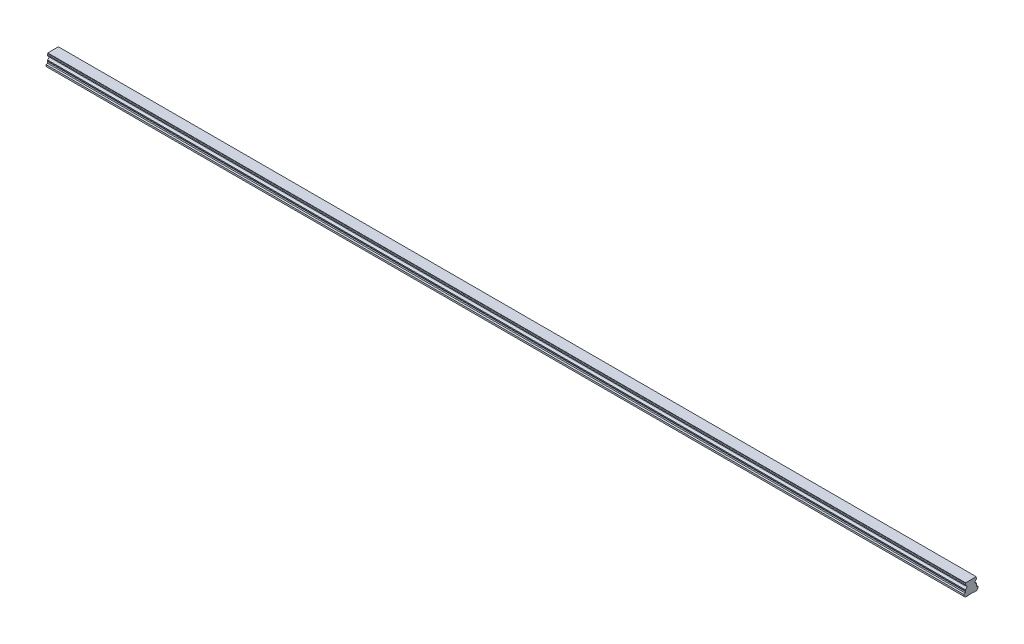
ISO-10303-21;
HEADER;
FILE_DESCRIPTION(('STEP AP214'),'2;1');
FILE_NAME('part.step','',(''),(''),'','','');
FILE_SCHEMA(('AUTOMOTIVE_DESIGN { 1 0 10303 214 1 1 1 1 }'));
ENDSEC;
DATA;
#1=APPLICATION_CONTEXT('core data for automotive mechanical design processes');
#2=APPLICATION_PROTOCOL_DEFINITION('international standard','automotive_design',2000,#1);
#3=PRODUCT_CONTEXT('',#1,'mechanical');
#4=PRODUCT('Part','Part','',(#3));
#5=PRODUCT_RELATED_PRODUCT_CATEGORY('part','',(#4));
#6=PRODUCT_DEFINITION_FORMATION('','',#4);
#7=PRODUCT_DEFINITION_CONTEXT('part definition',#1,'design');
#8=PRODUCT_DEFINITION('design','',#6,#7);
#9=PRODUCT_DEFINITION_SHAPE('','',#8);
#10=(LENGTH_UNIT() NAMED_UNIT(*) SI_UNIT(.MILLI.,.METRE.));
#11=(NAMED_UNIT(*) PLANE_ANGLE_UNIT() SI_UNIT($,.RADIAN.));
#12=(NAMED_UNIT(*) SI_UNIT($,.STERADIAN.) SOLID_ANGLE_UNIT());
#13=UNCERTAINTY_MEASURE_WITH_UNIT(LENGTH_MEASURE(1.E-05),#10,'distance_accuracy_value','');
#14=(GEOMETRIC_REPRESENTATION_CONTEXT(3) GLOBAL_UNCERTAINTY_ASSIGNED_CONTEXT((#13)) GLOBAL_UNIT_ASSIGNED_CONTEXT((#10,
#11,#12)) REPRESENTATION_CONTEXT('',''));
#15=CARTESIAN_POINT('',(0.,0.,0.));
#16=DIRECTION('',(0.,0.,1.));
#17=DIRECTION('',(1.,0.,0.));
#18=AXIS2_PLACEMENT_3D('',#15,#16,#17);
#19=CARTESIAN_POINT('',(1590.,0.499999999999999,0.));
#20=DIRECTION('',(0.,-1.,0.));
#21=DIRECTION('',(0.,0.,-1.));
#22=AXIS2_PLACEMENT_3D('',#19,#20,#21);
#23=CONICAL_SURFACE('',#22,3.5,0.785398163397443);
#24=CARTESIAN_POINT('',(1590.,1.00000000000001,0.));
#25=DIRECTION('',(0.,1.,0.));
#26=DIRECTION('',(0.,0.,1.));
#27=AXIS2_PLACEMENT_3D('',#24,#25,#26);
#28=CIRCLE('',#27,3.);
#29=CARTESIAN_POINT('',(1590.,1.00000000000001,3.));
#30=VERTEX_POINT('',#29);
#31=EDGE_CURVE('E11',#30,#30,#28,.F.);
#32=ORIENTED_EDGE('',*,*,#31,.F.);
#33=EDGE_LOOP('',(#32));
#34=FACE_BOUND('',#33,.T.);
#35=CARTESIAN_POINT('',(1590.,0.499999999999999,0.));
#36=DIRECTION('',(0.,1.,0.));
#37=DIRECTION('',(0.,0.,1.));
#38=AXIS2_PLACEMENT_3D('',#35,#36,#37);
#39=CIRCLE('',#38,3.5);
#40=CARTESIAN_POINT('',(1590.,0.5,3.5));
#41=VERTEX_POINT('',#40);
#42=EDGE_CURVE('E723',#41,#41,#39,.T.);
#43=ORIENTED_EDGE('',*,*,#42,.F.);
#44=EDGE_LOOP('',(#43));
#45=FACE_BOUND('',#44,.T.);
#46=ADVANCED_FACE('F39',(#34,#45),#23,.F.);
#47=CARTESIAN_POINT('',(1590.,12.,0.));
#48=DIRECTION('',(0.,-1.,0.));
#49=DIRECTION('',(0.,0.,-1.));
#50=AXIS2_PLACEMENT_3D('',#47,#48,#49);
#51=CYLINDRICAL_SURFACE('',#50,3.);
#52=ORIENTED_EDGE('',*,*,#31,.T.);
#53=EDGE_LOOP('',(#52));
#54=FACE_BOUND('',#53,.T.);
#55=CARTESIAN_POINT('',(1590.,12.,0.));
#56=DIRECTION('',(0.,-1.,0.));
#57=DIRECTION('',(0.,0.,-1.));
#58=AXIS2_PLACEMENT_3D('',#55,#56,#57);
#59=CIRCLE('',#58,3.);
#60=CARTESIAN_POINT('',(1590.,12.,-3.));
#61=VERTEX_POINT('',#60);
#62=EDGE_CURVE('E49',#61,#61,#59,.T.);
#63=ORIENTED_EDGE('',*,*,#62,.F.);
#64=EDGE_LOOP('',(#63));
#65=FACE_BOUND('',#64,.T.);
#66=ADVANCED_FACE('F1023',(#54,#65),#51,.F.);
#67=CARTESIAN_POINT('',(1590.,12.,0.));
#68=DIRECTION('',(0.,-1.,0.));
#69=DIRECTION('',(0.,0.,-1.));
#70=AXIS2_PLACEMENT_3D('',#67,#68,#69);
#71=PLANE('',#70);
#72=CARTESIAN_POINT('',(1590.,12.,0.));
#73=DIRECTION('',(0.,-1.,0.));
#74=DIRECTION('',(0.,0.,-1.));
#75=AXIS2_PLACEMENT_3D('',#72,#73,#74);
#76=CIRCLE('',#75,2.5);
#77=CARTESIAN_POINT('',(1590.,12.,-2.5));
#78=VERTEX_POINT('',#77);
#79=EDGE_CURVE('E42',#78,#78,#76,.T.);
#80=ORIENTED_EDGE('',*,*,#79,.F.);
#81=EDGE_LOOP('',(#80));
#82=FACE_BOUND('',#81,.T.);
#83=ORIENTED_EDGE('',*,*,#62,.T.);
#84=EDGE_LOOP('',(#83));
#85=FACE_BOUND('',#84,.T.);
#86=ADVANCED_FACE('F1028',(#82,#85),#71,.T.);
#87=CARTESIAN_POINT('',(1530.,0.499999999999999,0.));
#88=DIRECTION('',(0.,-1.,0.));
#89=DIRECTION('',(0.,0.,-1.));
#90=AXIS2_PLACEMENT_3D('',#87,#88,#89);
#91=CONICAL_SURFACE('',#90,3.5,0.785398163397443);
#92=CARTESIAN_POINT('',(1530.,1.00000000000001,0.));
#93=DIRECTION('',(0.,1.,0.));
#94=DIRECTION('',(0.,0.,1.));
#95=AXIS2_PLACEMENT_3D('',#92,#93,#94);
#96=CIRCLE('',#95,3.);
#97=CARTESIAN_POINT('',(1530.,1.00000000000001,3.));
#98=VERTEX_POINT('',#97);
#99=EDGE_CURVE('E719',#98,#98,#96,.F.);
#100=ORIENTED_EDGE('',*,*,#99,.F.);
#101=EDGE_LOOP('',(#100));
#102=FACE_BOUND('',#101,.T.);
#103=CARTESIAN_POINT('',(1530.,0.499999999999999,0.));
#104=DIRECTION('',(0.,1.,0.));
#105=DIRECTION('',(0.,0.,1.));
#106=AXIS2_PLACEMENT_3D('',#103,#104,#105);
#107=CIRCLE('',#106,3.5);
#108=CARTESIAN_POINT('',(1530.,0.5,3.5));
#109=VERTEX_POINT('',#108);
#110=EDGE_CURVE('E711',#109,#109,#107,.T.);
#111=ORIENTED_EDGE('',*,*,#110,.F.);
#112=EDGE_LOOP('',(#111));
#113=FACE_BOUND('',#112,.T.);
#114=ADVANCED_FACE('F1391',(#102,#113),#91,.F.);
#115=CARTESIAN_POINT('',(1530.,12.,0.));
#116=DIRECTION('',(0.,-1.,0.));
#117=DIRECTION('',(0.,0.,-1.));
#118=AXIS2_PLACEMENT_3D('',#115,#116,#117);
#119=CYLINDRICAL_SURFACE('',#118,3.);
#120=ORIENTED_EDGE('',*,*,#99,.T.);
#121=EDGE_LOOP('',(#120));
#122=FACE_BOUND('',#121,.T.);
#123=CARTESIAN_POINT('',(1530.,12.,0.));
#124=DIRECTION('',(0.,-1.,0.));
#125=DIRECTION('',(0.,0.,-1.));
#126=AXIS2_PLACEMENT_3D('',#123,#124,#125);
#127=CIRCLE('',#126,3.);
#128=CARTESIAN_POINT('',(1530.,12.,-3.));
#129=VERTEX_POINT('',#128);
#130=EDGE_CURVE('E715',#129,#129,#127,.T.);
#131=ORIENTED_EDGE('',*,*,#130,.F.);
#132=EDGE_LOOP('',(#131));
#133=FACE_BOUND('',#132,.T.);
#134=ADVANCED_FACE('F1387',(#122,#133),#119,.F.);
#135=CARTESIAN_POINT('',(1530.,12.,0.));
#136=DIRECTION('',(0.,-1.,0.));
#137=DIRECTION('',(0.,0.,-1.));
#138=AXIS2_PLACEMENT_3D('',#135,#136,#137);
#139=PLANE('',#138);
#140=CARTESIAN_POINT('',(1530.,12.,0.));
#141=DIRECTION('',(0.,-1.,0.));
#142=DIRECTION('',(0.,0.,-1.));
#143=AXIS2_PLACEMENT_3D('',#140,#141,#142);
#144=CIRCLE('',#143,2.5);
#145=CARTESIAN_POINT('',(1530.,12.,-2.5));
#146=VERTEX_POINT('',#145);
#147=EDGE_CURVE('E826',#146,#146,#144,.T.);
#148=ORIENTED_EDGE('',*,*,#147,.F.);
#149=EDGE_LOOP('',(#148));
#150=FACE_BOUND('',#149,.T.);
#151=ORIENTED_EDGE('',*,*,#130,.T.);
#152=EDGE_LOOP('',(#151));
#153=FACE_BOUND('',#152,.T.);
#154=ADVANCED_FACE('F1383',(#150,#153),#139,.T.);
#155=CARTESIAN_POINT('',(1470.,0.499999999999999,0.));
#156=DIRECTION('',(0.,-1.,0.));
#157=DIRECTION('',(0.,0.,-1.));
#158=AXIS2_PLACEMENT_3D('',#155,#156,#157);
#159=CONICAL_SURFACE('',#158,3.5,0.785398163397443);
#160=CARTESIAN_POINT('',(1470.,1.00000000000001,0.));
#161=DIRECTION('',(0.,1.,0.));
#162=DIRECTION('',(0.,0.,1.));
#163=AXIS2_PLACEMENT_3D('',#160,#161,#162);
#164=CIRCLE('',#163,3.);
#165=CARTESIAN_POINT('',(1470.,1.00000000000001,3.));
#166=VERTEX_POINT('',#165);
#167=EDGE_CURVE('E707',#166,#166,#164,.F.);
#168=ORIENTED_EDGE('',*,*,#167,.F.);
#169=EDGE_LOOP('',(#168));
#170=FACE_BOUND('',#169,.T.);
#171=CARTESIAN_POINT('',(1470.,0.499999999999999,0.));
#172=DIRECTION('',(0.,1.,0.));
#173=DIRECTION('',(0.,0.,1.));
#174=AXIS2_PLACEMENT_3D('',#171,#172,#173);
#175=CIRCLE('',#174,3.5);
#176=CARTESIAN_POINT('',(1470.,0.5,3.5));
#177=VERTEX_POINT('',#176);
#178=EDGE_CURVE('E699',#177,#177,#175,.T.);
#179=ORIENTED_EDGE('',*,*,#178,.F.);
#180=EDGE_LOOP('',(#179));
#181=FACE_BOUND('',#180,.T.);
#182=ADVANCED_FACE('F1379',(#170,#181),#159,.F.);
#183=CARTESIAN_POINT('',(1470.,12.,0.));
#184=DIRECTION('',(0.,-1.,0.));
#185=DIRECTION('',(0.,0.,-1.));
#186=AXIS2_PLACEMENT_3D('',#183,#184,#185);
#187=CYLINDRICAL_SURFACE('',#186,3.);
#188=ORIENTED_EDGE('',*,*,#167,.T.);
#189=EDGE_LOOP('',(#188));
#190=FACE_BOUND('',#189,.T.);
#191=CARTESIAN_POINT('',(1470.,12.,0.));
#192=DIRECTION('',(0.,-1.,0.));
#193=DIRECTION('',(0.,0.,-1.));
#194=AXIS2_PLACEMENT_3D('',#191,#192,#193);
#195=CIRCLE('',#194,3.);
#196=CARTESIAN_POINT('',(1470.,12.,-3.));
#197=VERTEX_POINT('',#196);
#198=EDGE_CURVE('E703',#197,#197,#195,.T.);
#199=ORIENTED_EDGE('',*,*,#198,.F.);
#200=EDGE_LOOP('',(#199));
#201=FACE_BOUND('',#200,.T.);
#202=ADVANCED_FACE('F1375',(#190,#201),#187,.F.);
#203=CARTESIAN_POINT('',(1470.,12.,0.));
#204=DIRECTION('',(0.,-1.,0.));
#205=DIRECTION('',(0.,0.,-1.));
#206=AXIS2_PLACEMENT_3D('',#203,#204,#205);
#207=PLANE('',#206);
#208=CARTESIAN_POINT('',(1470.,12.,0.));
#209=DIRECTION('',(0.,-1.,0.));
#210=DIRECTION('',(0.,0.,-1.));
#211=AXIS2_PLACEMENT_3D('',#208,#209,#210);
#212=CIRCLE('',#211,2.5);
#213=CARTESIAN_POINT('',(1470.,12.,-2.5));
#214=VERTEX_POINT('',#213);
#215=EDGE_CURVE('E823',#214,#214,#212,.T.);
#216=ORIENTED_EDGE('',*,*,#215,.F.);
#217=EDGE_LOOP('',(#216));
#218=FACE_BOUND('',#217,.T.);
#219=ORIENTED_EDGE('',*,*,#198,.T.);
#220=EDGE_LOOP('',(#219));
#221=FACE_BOUND('',#220,.T.);
#222=ADVANCED_FACE('F1371',(#218,#221),#207,.T.);
#223=CARTESIAN_POINT('',(1410.,0.499999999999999,0.));
#224=DIRECTION('',(0.,-1.,0.));
#225=DIRECTION('',(0.,0.,-1.));
#226=AXIS2_PLACEMENT_3D('',#223,#224,#225);
#227=CONICAL_SURFACE('',#226,3.5,0.785398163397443);
#228=CARTESIAN_POINT('',(1410.,1.00000000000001,0.));
#229=DIRECTION('',(0.,1.,0.));
#230=DIRECTION('',(0.,0.,1.));
#231=AXIS2_PLACEMENT_3D('',#228,#229,#230);
#232=CIRCLE('',#231,3.);
#233=CARTESIAN_POINT('',(1410.,1.00000000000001,3.));
#234=VERTEX_POINT('',#233);
#235=EDGE_CURVE('E695',#234,#234,#232,.F.);
#236=ORIENTED_EDGE('',*,*,#235,.F.);
#237=EDGE_LOOP('',(#236));
#238=FACE_BOUND('',#237,.T.);
#239=CARTESIAN_POINT('',(1410.,0.499999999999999,0.));
#240=DIRECTION('',(0.,1.,0.));
#241=DIRECTION('',(0.,0.,1.));
#242=AXIS2_PLACEMENT_3D('',#239,#240,#241);
#243=CIRCLE('',#242,3.5);
#244=CARTESIAN_POINT('',(1410.,0.5,3.5));
#245=VERTEX_POINT('',#244);
#246=EDGE_CURVE('E687',#245,#245,#243,.T.);
#247=ORIENTED_EDGE('',*,*,#246,.F.);
#248=EDGE_LOOP('',(#247));
#249=FACE_BOUND('',#248,.T.);
#250=ADVANCED_FACE('F1367',(#238,#249),#227,.F.);
#251=CARTESIAN_POINT('',(1410.,12.,0.));
#252=DIRECTION('',(0.,-1.,0.));
#253=DIRECTION('',(0.,0.,-1.));
#254=AXIS2_PLACEMENT_3D('',#251,#252,#253);
#255=CYLINDRICAL_SURFACE('',#254,3.);
#256=ORIENTED_EDGE('',*,*,#235,.T.);
#257=EDGE_LOOP('',(#256));
#258=FACE_BOUND('',#257,.T.);
#259=CARTESIAN_POINT('',(1410.,12.,0.));
#260=DIRECTION('',(0.,-1.,0.));
#261=DIRECTION('',(0.,0.,-1.));
#262=AXIS2_PLACEMENT_3D('',#259,#260,#261);
#263=CIRCLE('',#262,3.);
#264=CARTESIAN_POINT('',(1410.,12.,-3.));
#265=VERTEX_POINT('',#264);
#266=EDGE_CURVE('E691',#265,#265,#263,.T.);
#267=ORIENTED_EDGE('',*,*,#266,.F.);
#268=EDGE_LOOP('',(#267));
#269=FACE_BOUND('',#268,.T.);
#270=ADVANCED_FACE('F1363',(#258,#269),#255,.F.);
#271=CARTESIAN_POINT('',(1410.,12.,0.));
#272=DIRECTION('',(0.,-1.,0.));
#273=DIRECTION('',(0.,0.,-1.));
#274=AXIS2_PLACEMENT_3D('',#271,#272,#273);
#275=PLANE('',#274);
#276=CARTESIAN_POINT('',(1410.,12.,0.));
#277=DIRECTION('',(0.,-1.,0.));
#278=DIRECTION('',(0.,0.,-1.));
#279=AXIS2_PLACEMENT_3D('',#276,#277,#278);
#280=CIRCLE('',#279,2.5);
#281=CARTESIAN_POINT('',(1410.,12.,-2.5));
#282=VERTEX_POINT('',#281);
#283=EDGE_CURVE('E819',#282,#282,#280,.T.);
#284=ORIENTED_EDGE('',*,*,#283,.F.);
#285=EDGE_LOOP('',(#284));
#286=FACE_BOUND('',#285,.T.);
#287=ORIENTED_EDGE('',*,*,#266,.T.);
#288=EDGE_LOOP('',(#287));
#289=FACE_BOUND('',#288,.T.);
#290=ADVANCED_FACE('F1359',(#286,#289),#275,.T.);
#291=CARTESIAN_POINT('',(1350.,0.499999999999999,0.));
#292=DIRECTION('',(0.,-1.,0.));
#293=DIRECTION('',(0.,0.,-1.));
#294=AXIS2_PLACEMENT_3D('',#291,#292,#293);
#295=CONICAL_SURFACE('',#294,3.5,0.785398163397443);
#296=CARTESIAN_POINT('',(1350.,1.00000000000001,0.));
#297=DIRECTION('',(0.,1.,0.));
#298=DIRECTION('',(0.,0.,1.));
#299=AXIS2_PLACEMENT_3D('',#296,#297,#298);
#300=CIRCLE('',#299,3.);
#301=CARTESIAN_POINT('',(1350.,1.00000000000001,3.));
#302=VERTEX_POINT('',#301);
#303=EDGE_CURVE('E683',#302,#302,#300,.F.);
#304=ORIENTED_EDGE('',*,*,#303,.F.);
#305=EDGE_LOOP('',(#304));
#306=FACE_BOUND('',#305,.T.);
#307=CARTESIAN_POINT('',(1350.,0.499999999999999,0.));
#308=DIRECTION('',(0.,1.,0.));
#309=DIRECTION('',(0.,0.,1.));
#310=AXIS2_PLACEMENT_3D('',#307,#308,#309);
#311=CIRCLE('',#310,3.5);
#312=CARTESIAN_POINT('',(1350.,0.5,3.5));
#313=VERTEX_POINT('',#312);
#314=EDGE_CURVE('E675',#313,#313,#311,.T.);
#315=ORIENTED_EDGE('',*,*,#314,.F.);
#316=EDGE_LOOP('',(#315));
#317=FACE_BOUND('',#316,.T.);
#318=ADVANCED_FACE('F1355',(#306,#317),#295,.F.);
#319=CARTESIAN_POINT('',(1350.,12.,0.));
#320=DIRECTION('',(0.,-1.,0.));
#321=DIRECTION('',(0.,0.,-1.));
#322=AXIS2_PLACEMENT_3D('',#319,#320,#321);
#323=CYLINDRICAL_SURFACE('',#322,3.);
#324=ORIENTED_EDGE('',*,*,#303,.T.);
#325=EDGE_LOOP('',(#324));
#326=FACE_BOUND('',#325,.T.);
#327=CARTESIAN_POINT('',(1350.,12.,0.));
#328=DIRECTION('',(0.,-1.,0.));
#329=DIRECTION('',(0.,0.,-1.));
#330=AXIS2_PLACEMENT_3D('',#327,#328,#329);
#331=CIRCLE('',#330,3.);
#332=CARTESIAN_POINT('',(1350.,12.,-3.));
#333=VERTEX_POINT('',#332);
#334=EDGE_CURVE('E679',#333,#333,#331,.T.);
#335=ORIENTED_EDGE('',*,*,#334,.F.);
#336=EDGE_LOOP('',(#335));
#337=FACE_BOUND('',#336,.T.);
#338=ADVANCED_FACE('F1351',(#326,#337),#323,.F.);
#339=CARTESIAN_POINT('',(1350.,12.,0.));
#340=DIRECTION('',(0.,-1.,0.));
#341=DIRECTION('',(0.,0.,-1.));
#342=AXIS2_PLACEMENT_3D('',#339,#340,#341);
#343=PLANE('',#342);
#344=CARTESIAN_POINT('',(1350.,12.,0.));
#345=DIRECTION('',(0.,-1.,0.));
#346=DIRECTION('',(0.,0.,-1.));
#347=AXIS2_PLACEMENT_3D('',#344,#345,#346);
#348=CIRCLE('',#347,2.5);
#349=CARTESIAN_POINT('',(1350.,12.,-2.5));
#350=VERTEX_POINT('',#349);
#351=EDGE_CURVE('E815',#350,#350,#348,.T.);
#352=ORIENTED_EDGE('',*,*,#351,.F.);
#353=EDGE_LOOP('',(#352));
#354=FACE_BOUND('',#353,.T.);
#355=ORIENTED_EDGE('',*,*,#334,.T.);
#356=EDGE_LOOP('',(#355));
#357=FACE_BOUND('',#356,.T.);
#358=ADVANCED_FACE('F1347',(#354,#357),#343,.T.);
#359=CARTESIAN_POINT('',(1290.,0.499999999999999,0.));
#360=DIRECTION('',(0.,-1.,0.));
#361=DIRECTION('',(0.,0.,-1.));
#362=AXIS2_PLACEMENT_3D('',#359,#360,#361);
#363=CONICAL_SURFACE('',#362,3.5,0.785398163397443);
#364=CARTESIAN_POINT('',(1290.,1.00000000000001,0.));
#365=DIRECTION('',(0.,1.,0.));
#366=DIRECTION('',(0.,0.,1.));
#367=AXIS2_PLACEMENT_3D('',#364,#365,#366);
#368=CIRCLE('',#367,3.);
#369=CARTESIAN_POINT('',(1290.,1.00000000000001,3.));
#370=VERTEX_POINT('',#369);
#371=EDGE_CURVE('E671',#370,#370,#368,.F.);
#372=ORIENTED_EDGE('',*,*,#371,.F.);
#373=EDGE_LOOP('',(#372));
#374=FACE_BOUND('',#373,.T.);
#375=CARTESIAN_POINT('',(1290.,0.499999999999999,0.));
#376=DIRECTION('',(0.,1.,0.));
#377=DIRECTION('',(0.,0.,1.));
#378=AXIS2_PLACEMENT_3D('',#375,#376,#377);
#379=CIRCLE('',#378,3.5);
#380=CARTESIAN_POINT('',(1290.,0.5,3.5));
#381=VERTEX_POINT('',#380);
#382=EDGE_CURVE('E663',#381,#381,#379,.T.);
#383=ORIENTED_EDGE('',*,*,#382,.F.);
#384=EDGE_LOOP('',(#383));
#385=FACE_BOUND('',#384,.T.);
#386=ADVANCED_FACE('F1343',(#374,#385),#363,.F.);
#387=CARTESIAN_POINT('',(1290.,12.,0.));
#388=DIRECTION('',(0.,-1.,0.));
#389=DIRECTION('',(0.,0.,-1.));
#390=AXIS2_PLACEMENT_3D('',#387,#388,#389);
#391=CYLINDRICAL_SURFACE('',#390,3.);
#392=ORIENTED_EDGE('',*,*,#371,.T.);
#393=EDGE_LOOP('',(#392));
#394=FACE_BOUND('',#393,.T.);
#395=CARTESIAN_POINT('',(1290.,12.,0.));
#396=DIRECTION('',(0.,-1.,0.));
#397=DIRECTION('',(0.,0.,-1.));
#398=AXIS2_PLACEMENT_3D('',#395,#396,#397);
#399=CIRCLE('',#398,3.);
#400=CARTESIAN_POINT('',(1290.,12.,-3.));
#401=VERTEX_POINT('',#400);
#402=EDGE_CURVE('E667',#401,#401,#399,.T.);
#403=ORIENTED_EDGE('',*,*,#402,.F.);
#404=EDGE_LOOP('',(#403));
#405=FACE_BOUND('',#404,.T.);
#406=ADVANCED_FACE('F1339',(#394,#405),#391,.F.);
#407=CARTESIAN_POINT('',(1290.,12.,0.));
#408=DIRECTION('',(0.,-1.,0.));
#409=DIRECTION('',(0.,0.,-1.));
#410=AXIS2_PLACEMENT_3D('',#407,#408,#409);
#411=PLANE('',#410);
#412=CARTESIAN_POINT('',(1290.,12.,0.));
#413=DIRECTION('',(0.,-1.,0.));
#414=DIRECTION('',(0.,0.,-1.));
#415=AXIS2_PLACEMENT_3D('',#412,#413,#414);
#416=CIRCLE('',#415,2.5);
#417=CARTESIAN_POINT('',(1290.,12.,-2.5));
#418=VERTEX_POINT('',#417);
#419=EDGE_CURVE('E811',#418,#418,#416,.T.);
#420=ORIENTED_EDGE('',*,*,#419,.F.);
#421=EDGE_LOOP('',(#420));
#422=FACE_BOUND('',#421,.T.);
#423=ORIENTED_EDGE('',*,*,#402,.T.);
#424=EDGE_LOOP('',(#423));
#425=FACE_BOUND('',#424,.T.);
#426=ADVANCED_FACE('F1335',(#422,#425),#411,.T.);
#427=CARTESIAN_POINT('',(1230.,0.499999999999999,0.));
#428=DIRECTION('',(0.,-1.,0.));
#429=DIRECTION('',(0.,0.,-1.));
#430=AXIS2_PLACEMENT_3D('',#427,#428,#429);
#431=CONICAL_SURFACE('',#430,3.5,0.785398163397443);
#432=CARTESIAN_POINT('',(1230.,1.00000000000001,0.));
#433=DIRECTION('',(0.,1.,0.));
#434=DIRECTION('',(0.,0.,1.));
#435=AXIS2_PLACEMENT_3D('',#432,#433,#434);
#436=CIRCLE('',#435,3.);
#437=CARTESIAN_POINT('',(1230.,1.00000000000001,3.));
#438=VERTEX_POINT('',#437);
#439=EDGE_CURVE('E659',#438,#438,#436,.F.);
#440=ORIENTED_EDGE('',*,*,#439,.F.);
#441=EDGE_LOOP('',(#440));
#442=FACE_BOUND('',#441,.T.);
#443=CARTESIAN_POINT('',(1230.,0.499999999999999,0.));
#444=DIRECTION('',(0.,1.,0.));
#445=DIRECTION('',(0.,0.,1.));
#446=AXIS2_PLACEMENT_3D('',#443,#444,#445);
#447=CIRCLE('',#446,3.5);
#448=CARTESIAN_POINT('',(1230.,0.5,3.5));
#449=VERTEX_POINT('',#448);
#450=EDGE_CURVE('E651',#449,#449,#447,.T.);
#451=ORIENTED_EDGE('',*,*,#450,.F.);
#452=EDGE_LOOP('',(#451));
#453=FACE_BOUND('',#452,.T.);
#454=ADVANCED_FACE('F1331',(#442,#453),#431,.F.);
#455=CARTESIAN_POINT('',(1230.,12.,0.));
#456=DIRECTION('',(0.,-1.,0.));
#457=DIRECTION('',(0.,0.,-1.));
#458=AXIS2_PLACEMENT_3D('',#455,#456,#457);
#459=CYLINDRICAL_SURFACE('',#458,3.);
#460=ORIENTED_EDGE('',*,*,#439,.T.);
#461=EDGE_LOOP('',(#460));
#462=FACE_BOUND('',#461,.T.);
#463=CARTESIAN_POINT('',(1230.,12.,0.));
#464=DIRECTION('',(0.,-1.,0.));
#465=DIRECTION('',(0.,0.,-1.));
#466=AXIS2_PLACEMENT_3D('',#463,#464,#465);
#467=CIRCLE('',#466,3.);
#468=CARTESIAN_POINT('',(1230.,12.,-3.));
#469=VERTEX_POINT('',#468);
#470=EDGE_CURVE('E655',#469,#469,#467,.T.);
#471=ORIENTED_EDGE('',*,*,#470,.F.);
#472=EDGE_LOOP('',(#471));
#473=FACE_BOUND('',#472,.T.);
#474=ADVANCED_FACE('F1327',(#462,#473),#459,.F.);
#475=CARTESIAN_POINT('',(1230.,12.,0.));
#476=DIRECTION('',(0.,-1.,0.));
#477=DIRECTION('',(0.,0.,-1.));
#478=AXIS2_PLACEMENT_3D('',#475,#476,#477);
#479=PLANE('',#478);
#480=CARTESIAN_POINT('',(1230.,12.,0.));
#481=DIRECTION('',(0.,-1.,0.));
#482=DIRECTION('',(0.,0.,-1.));
#483=AXIS2_PLACEMENT_3D('',#480,#481,#482);
#484=CIRCLE('',#483,2.5);
#485=CARTESIAN_POINT('',(1230.,12.,-2.5));
#486=VERTEX_POINT('',#485);
#487=EDGE_CURVE('E807',#486,#486,#484,.T.);
#488=ORIENTED_EDGE('',*,*,#487,.F.);
#489=EDGE_LOOP('',(#488));
#490=FACE_BOUND('',#489,.T.);
#491=ORIENTED_EDGE('',*,*,#470,.T.);
#492=EDGE_LOOP('',(#491));
#493=FACE_BOUND('',#492,.T.);
#494=ADVANCED_FACE('F1323',(#490,#493),#479,.T.);
#495=CARTESIAN_POINT('',(1170.,0.499999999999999,0.));
#496=DIRECTION('',(0.,-1.,0.));
#497=DIRECTION('',(0.,0.,-1.));
#498=AXIS2_PLACEMENT_3D('',#495,#496,#497);
#499=CONICAL_SURFACE('',#498,3.5,0.785398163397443);
#500=CARTESIAN_POINT('',(1170.,1.00000000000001,0.));
#501=DIRECTION('',(0.,1.,0.));
#502=DIRECTION('',(0.,0.,1.));
#503=AXIS2_PLACEMENT_3D('',#500,#501,#502);
#504=CIRCLE('',#503,3.);
#505=CARTESIAN_POINT('',(1170.,1.00000000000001,3.));
#506=VERTEX_POINT('',#505);
#507=EDGE_CURVE('E647',#506,#506,#504,.F.);
#508=ORIENTED_EDGE('',*,*,#507,.F.);
#509=EDGE_LOOP('',(#508));
#510=FACE_BOUND('',#509,.T.);
#511=CARTESIAN_POINT('',(1170.,0.499999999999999,0.));
#512=DIRECTION('',(0.,1.,0.));
#513=DIRECTION('',(0.,0.,1.));
#514=AXIS2_PLACEMENT_3D('',#511,#512,#513);
#515=CIRCLE('',#514,3.5);
#516=CARTESIAN_POINT('',(1170.,0.5,3.5));
#517=VERTEX_POINT('',#516);
#518=EDGE_CURVE('E639',#517,#517,#515,.T.);
#519=ORIENTED_EDGE('',*,*,#518,.F.);
#520=EDGE_LOOP('',(#519));
#521=FACE_BOUND('',#520,.T.);
#522=ADVANCED_FACE('F1319',(#510,#521),#499,.F.);
#523=CARTESIAN_POINT('',(1170.,12.,0.));
#524=DIRECTION('',(0.,-1.,0.));
#525=DIRECTION('',(0.,0.,-1.));
#526=AXIS2_PLACEMENT_3D('',#523,#524,#525);
#527=CYLINDRICAL_SURFACE('',#526,3.);
#528=ORIENTED_EDGE('',*,*,#507,.T.);
#529=EDGE_LOOP('',(#528));
#530=FACE_BOUND('',#529,.T.);
#531=CARTESIAN_POINT('',(1170.,12.,0.));
#532=DIRECTION('',(0.,-1.,0.));
#533=DIRECTION('',(0.,0.,-1.));
#534=AXIS2_PLACEMENT_3D('',#531,#532,#533);
#535=CIRCLE('',#534,3.);
#536=CARTESIAN_POINT('',(1170.,12.,-3.));
#537=VERTEX_POINT('',#536);
#538=EDGE_CURVE('E643',#537,#537,#535,.T.);
#539=ORIENTED_EDGE('',*,*,#538,.F.);
#540=EDGE_LOOP('',(#539));
#541=FACE_BOUND('',#540,.T.);
#542=ADVANCED_FACE('F1315',(#530,#541),#527,.F.);
#543=CARTESIAN_POINT('',(1170.,12.,0.));
#544=DIRECTION('',(0.,-1.,0.));
#545=DIRECTION('',(0.,0.,-1.));
#546=AXIS2_PLACEMENT_3D('',#543,#544,#545);
#547=PLANE('',#546);
#548=CARTESIAN_POINT('',(1170.,12.,0.));
#549=DIRECTION('',(0.,-1.,0.));
#550=DIRECTION('',(0.,0.,-1.));
#551=AXIS2_PLACEMENT_3D('',#548,#549,#550);
#552=CIRCLE('',#551,2.5);
#553=CARTESIAN_POINT('',(1170.,12.,-2.5));
#554=VERTEX_POINT('',#553);
#555=EDGE_CURVE('E803',#554,#554,#552,.T.);
#556=ORIENTED_EDGE('',*,*,#555,.F.);
#557=EDGE_LOOP('',(#556));
#558=FACE_BOUND('',#557,.T.);
#559=ORIENTED_EDGE('',*,*,#538,.T.);
#560=EDGE_LOOP('',(#559));
#561=FACE_BOUND('',#560,.T.);
#562=ADVANCED_FACE('F1311',(#558,#561),#547,.T.);
#563=CARTESIAN_POINT('',(1110.,0.499999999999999,0.));
#564=DIRECTION('',(0.,-1.,0.));
#565=DIRECTION('',(0.,0.,-1.));
#566=AXIS2_PLACEMENT_3D('',#563,#564,#565);
#567=CONICAL_SURFACE('',#566,3.5,0.785398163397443);
#568=CARTESIAN_POINT('',(1110.,1.00000000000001,0.));
#569=DIRECTION('',(0.,1.,0.));
#570=DIRECTION('',(0.,0.,1.));
#571=AXIS2_PLACEMENT_3D('',#568,#569,#570);
#572=CIRCLE('',#571,3.);
#573=CARTESIAN_POINT('',(1110.,1.00000000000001,3.));
#574=VERTEX_POINT('',#573);
#575=EDGE_CURVE('E635',#574,#574,#572,.F.);
#576=ORIENTED_EDGE('',*,*,#575,.F.);
#577=EDGE_LOOP('',(#576));
#578=FACE_BOUND('',#577,.T.);
#579=CARTESIAN_POINT('',(1110.,0.499999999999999,0.));
#580=DIRECTION('',(0.,1.,0.));
#581=DIRECTION('',(0.,0.,1.));
#582=AXIS2_PLACEMENT_3D('',#579,#580,#581);
#583=CIRCLE('',#582,3.5);
#584=CARTESIAN_POINT('',(1110.,0.5,3.5));
#585=VERTEX_POINT('',#584);
#586=EDGE_CURVE('E627',#585,#585,#583,.T.);
#587=ORIENTED_EDGE('',*,*,#586,.F.);
#588=EDGE_LOOP('',(#587));
#589=FACE_BOUND('',#588,.T.);
#590=ADVANCED_FACE('F1307',(#578,#589),#567,.F.);
#591=CARTESIAN_POINT('',(1110.,12.,0.));
#592=DIRECTION('',(0.,-1.,0.));
#593=DIRECTION('',(0.,0.,-1.));
#594=AXIS2_PLACEMENT_3D('',#591,#592,#593);
#595=CYLINDRICAL_SURFACE('',#594,3.);
#596=ORIENTED_EDGE('',*,*,#575,.T.);
#597=EDGE_LOOP('',(#596));
#598=FACE_BOUND('',#597,.T.);
#599=CARTESIAN_POINT('',(1110.,12.,0.));
#600=DIRECTION('',(0.,-1.,0.));
#601=DIRECTION('',(0.,0.,-1.));
#602=AXIS2_PLACEMENT_3D('',#599,#600,#601);
#603=CIRCLE('',#602,3.);
#604=CARTESIAN_POINT('',(1110.,12.,-3.));
#605=VERTEX_POINT('',#604);
#606=EDGE_CURVE('E631',#605,#605,#603,.T.);
#607=ORIENTED_EDGE('',*,*,#606,.F.);
#608=EDGE_LOOP('',(#607));
#609=FACE_BOUND('',#608,.T.);
#610=ADVANCED_FACE('F1303',(#598,#609),#595,.F.);
#611=CARTESIAN_POINT('',(1110.,12.,0.));
#612=DIRECTION('',(0.,-1.,0.));
#613=DIRECTION('',(0.,0.,-1.));
#614=AXIS2_PLACEMENT_3D('',#611,#612,#613);
#615=PLANE('',#614);
#616=CARTESIAN_POINT('',(1110.,12.,0.));
#617=DIRECTION('',(0.,-1.,0.));
#618=DIRECTION('',(0.,0.,-1.));
#619=AXIS2_PLACEMENT_3D('',#616,#617,#618);
#620=CIRCLE('',#619,2.5);
#621=CARTESIAN_POINT('',(1110.,12.,-2.5));
#622=VERTEX_POINT('',#621);
#623=EDGE_CURVE('E799',#622,#622,#620,.T.);
#624=ORIENTED_EDGE('',*,*,#623,.F.);
#625=EDGE_LOOP('',(#624));
#626=FACE_BOUND('',#625,.T.);
#627=ORIENTED_EDGE('',*,*,#606,.T.);
#628=EDGE_LOOP('',(#627));
#629=FACE_BOUND('',#628,.T.);
#630=ADVANCED_FACE('F1299',(#626,#629),#615,.T.);
#631=CARTESIAN_POINT('',(1050.,0.499999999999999,0.));
#632=DIRECTION('',(0.,-1.,0.));
#633=DIRECTION('',(0.,0.,-1.));
#634=AXIS2_PLACEMENT_3D('',#631,#632,#633);
#635=CONICAL_SURFACE('',#634,3.5,0.785398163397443);
#636=CARTESIAN_POINT('',(1050.,1.00000000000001,0.));
#637=DIRECTION('',(0.,1.,0.));
#638=DIRECTION('',(0.,0.,1.));
#639=AXIS2_PLACEMENT_3D('',#636,#637,#638);
#640=CIRCLE('',#639,3.);
#641=CARTESIAN_POINT('',(1050.,1.00000000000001,3.));
#642=VERTEX_POINT('',#641);
#643=EDGE_CURVE('E623',#642,#642,#640,.F.);
#644=ORIENTED_EDGE('',*,*,#643,.F.);
#645=EDGE_LOOP('',(#644));
#646=FACE_BOUND('',#645,.T.);
#647=CARTESIAN_POINT('',(1050.,0.499999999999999,0.));
#648=DIRECTION('',(0.,1.,0.));
#649=DIRECTION('',(0.,0.,1.));
#650=AXIS2_PLACEMENT_3D('',#647,#648,#649);
#651=CIRCLE('',#650,3.5);
#652=CARTESIAN_POINT('',(1050.,0.5,3.5));
#653=VERTEX_POINT('',#652);
#654=EDGE_CURVE('E615',#653,#653,#651,.T.);
#655=ORIENTED_EDGE('',*,*,#654,.F.);
#656=EDGE_LOOP('',(#655));
#657=FACE_BOUND('',#656,.T.);
#658=ADVANCED_FACE('F1295',(#646,#657),#635,.F.);
#659=CARTESIAN_POINT('',(1050.,12.,0.));
#660=DIRECTION('',(0.,-1.,0.));
#661=DIRECTION('',(0.,0.,-1.));
#662=AXIS2_PLACEMENT_3D('',#659,#660,#661);
#663=CYLINDRICAL_SURFACE('',#662,3.);
#664=ORIENTED_EDGE('',*,*,#643,.T.);
#665=EDGE_LOOP('',(#664));
#666=FACE_BOUND('',#665,.T.);
#667=CARTESIAN_POINT('',(1050.,12.,0.));
#668=DIRECTION('',(0.,-1.,0.));
#669=DIRECTION('',(0.,0.,-1.));
#670=AXIS2_PLACEMENT_3D('',#667,#668,#669);
#671=CIRCLE('',#670,3.);
#672=CARTESIAN_POINT('',(1050.,12.,-3.));
#673=VERTEX_POINT('',#672);
#674=EDGE_CURVE('E619',#673,#673,#671,.T.);
#675=ORIENTED_EDGE('',*,*,#674,.F.);
#676=EDGE_LOOP('',(#675));
#677=FACE_BOUND('',#676,.T.);
#678=ADVANCED_FACE('F1291',(#666,#677),#663,.F.);
#679=CARTESIAN_POINT('',(1050.,12.,0.));
#680=DIRECTION('',(0.,-1.,0.));
#681=DIRECTION('',(0.,0.,-1.));
#682=AXIS2_PLACEMENT_3D('',#679,#680,#681);
#683=PLANE('',#682);
#684=CARTESIAN_POINT('',(1050.,12.,0.));
#685=DIRECTION('',(0.,-1.,0.));
#686=DIRECTION('',(0.,0.,-1.));
#687=AXIS2_PLACEMENT_3D('',#684,#685,#686);
#688=CIRCLE('',#687,2.5);
#689=CARTESIAN_POINT('',(1050.,12.,-2.5));
#690=VERTEX_POINT('',#689);
#691=EDGE_CURVE('E795',#690,#690,#688,.T.);
#692=ORIENTED_EDGE('',*,*,#691,.F.);
#693=EDGE_LOOP('',(#692));
#694=FACE_BOUND('',#693,.T.);
#695=ORIENTED_EDGE('',*,*,#674,.T.);
#696=EDGE_LOOP('',(#695));
#697=FACE_BOUND('',#696,.T.);
#698=ADVANCED_FACE('F1287',(#694,#697),#683,.T.);
#699=CARTESIAN_POINT('',(990.,0.499999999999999,0.));
#700=DIRECTION('',(0.,-1.,0.));
#701=DIRECTION('',(0.,0.,-1.));
#702=AXIS2_PLACEMENT_3D('',#699,#700,#701);
#703=CONICAL_SURFACE('',#702,3.5,0.785398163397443);
#704=CARTESIAN_POINT('',(990.,1.00000000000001,0.));
#705=DIRECTION('',(0.,1.,0.));
#706=DIRECTION('',(0.,0.,1.));
#707=AXIS2_PLACEMENT_3D('',#704,#705,#706);
#708=CIRCLE('',#707,3.);
#709=CARTESIAN_POINT('',(990.,1.00000000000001,3.));
#710=VERTEX_POINT('',#709);
#711=EDGE_CURVE('E611',#710,#710,#708,.F.);
#712=ORIENTED_EDGE('',*,*,#711,.F.);
#713=EDGE_LOOP('',(#712));
#714=FACE_BOUND('',#713,.T.);
#715=CARTESIAN_POINT('',(990.,0.499999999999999,0.));
#716=DIRECTION('',(0.,1.,0.));
#717=DIRECTION('',(0.,0.,1.));
#718=AXIS2_PLACEMENT_3D('',#715,#716,#717);
#719=CIRCLE('',#718,3.5);
#720=CARTESIAN_POINT('',(990.,0.5,3.5));
#721=VERTEX_POINT('',#720);
#722=EDGE_CURVE('E603',#721,#721,#719,.T.);
#723=ORIENTED_EDGE('',*,*,#722,.F.);
#724=EDGE_LOOP('',(#723));
#725=FACE_BOUND('',#724,.T.);
#726=ADVANCED_FACE('F1283',(#714,#725),#703,.F.);
#727=CARTESIAN_POINT('',(990.,12.,0.));
#728=DIRECTION('',(0.,-1.,0.));
#729=DIRECTION('',(0.,0.,-1.));
#730=AXIS2_PLACEMENT_3D('',#727,#728,#729);
#731=CYLINDRICAL_SURFACE('',#730,3.);
#732=ORIENTED_EDGE('',*,*,#711,.T.);
#733=EDGE_LOOP('',(#732));
#734=FACE_BOUND('',#733,.T.);
#735=CARTESIAN_POINT('',(990.,12.,0.));
#736=DIRECTION('',(0.,-1.,0.));
#737=DIRECTION('',(0.,0.,-1.));
#738=AXIS2_PLACEMENT_3D('',#735,#736,#737);
#739=CIRCLE('',#738,3.);
#740=CARTESIAN_POINT('',(990.,12.,-3.));
#741=VERTEX_POINT('',#740);
#742=EDGE_CURVE('E607',#741,#741,#739,.T.);
#743=ORIENTED_EDGE('',*,*,#742,.F.);
#744=EDGE_LOOP('',(#743));
#745=FACE_BOUND('',#744,.T.);
#746=ADVANCED_FACE('F1279',(#734,#745),#731,.F.);
#747=CARTESIAN_POINT('',(990.,12.,0.));
#748=DIRECTION('',(0.,-1.,0.));
#749=DIRECTION('',(0.,0.,-1.));
#750=AXIS2_PLACEMENT_3D('',#747,#748,#749);
#751=PLANE('',#750);
#752=CARTESIAN_POINT('',(990.,12.,0.));
#753=DIRECTION('',(0.,-1.,0.));
#754=DIRECTION('',(0.,0.,-1.));
#755=AXIS2_PLACEMENT_3D('',#752,#753,#754);
#756=CIRCLE('',#755,2.5);
#757=CARTESIAN_POINT('',(990.,12.,-2.5));
#758=VERTEX_POINT('',#757);
#759=EDGE_CURVE('E791',#758,#758,#756,.T.);
#760=ORIENTED_EDGE('',*,*,#759,.F.);
#761=EDGE_LOOP('',(#760));
#762=FACE_BOUND('',#761,.T.);
#763=ORIENTED_EDGE('',*,*,#742,.T.);
#764=EDGE_LOOP('',(#763));
#765=FACE_BOUND('',#764,.T.);
#766=ADVANCED_FACE('F1275',(#762,#765),#751,.T.);
#767=CARTESIAN_POINT('',(930.,0.499999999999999,0.));
#768=DIRECTION('',(0.,-1.,0.));
#769=DIRECTION('',(0.,0.,-1.));
#770=AXIS2_PLACEMENT_3D('',#767,#768,#769);
#771=CONICAL_SURFACE('',#770,3.5,0.785398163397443);
#772=CARTESIAN_POINT('',(930.,1.00000000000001,0.));
#773=DIRECTION('',(0.,1.,0.));
#774=DIRECTION('',(0.,0.,1.));
#775=AXIS2_PLACEMENT_3D('',#772,#773,#774);
#776=CIRCLE('',#775,3.);
#777=CARTESIAN_POINT('',(930.,1.00000000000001,3.));
#778=VERTEX_POINT('',#777);
#779=EDGE_CURVE('E599',#778,#778,#776,.F.);
#780=ORIENTED_EDGE('',*,*,#779,.F.);
#781=EDGE_LOOP('',(#780));
#782=FACE_BOUND('',#781,.T.);
#783=CARTESIAN_POINT('',(930.,0.499999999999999,0.));
#784=DIRECTION('',(0.,1.,0.));
#785=DIRECTION('',(0.,0.,1.));
#786=AXIS2_PLACEMENT_3D('',#783,#784,#785);
#787=CIRCLE('',#786,3.5);
#788=CARTESIAN_POINT('',(930.,0.5,3.5));
#789=VERTEX_POINT('',#788);
#790=EDGE_CURVE('E591',#789,#789,#787,.T.);
#791=ORIENTED_EDGE('',*,*,#790,.F.);
#792=EDGE_LOOP('',(#791));
#793=FACE_BOUND('',#792,.T.);
#794=ADVANCED_FACE('F1271',(#782,#793),#771,.F.);
#795=CARTESIAN_POINT('',(930.,12.,0.));
#796=DIRECTION('',(0.,-1.,0.));
#797=DIRECTION('',(0.,0.,-1.));
#798=AXIS2_PLACEMENT_3D('',#795,#796,#797);
#799=CYLINDRICAL_SURFACE('',#798,3.);
#800=ORIENTED_EDGE('',*,*,#779,.T.);
#801=EDGE_LOOP('',(#800));
#802=FACE_BOUND('',#801,.T.);
#803=CARTESIAN_POINT('',(930.,12.,0.));
#804=DIRECTION('',(0.,-1.,0.));
#805=DIRECTION('',(0.,0.,-1.));
#806=AXIS2_PLACEMENT_3D('',#803,#804,#805);
#807=CIRCLE('',#806,3.);
#808=CARTESIAN_POINT('',(930.,12.,-3.));
#809=VERTEX_POINT('',#808);
#810=EDGE_CURVE('E595',#809,#809,#807,.T.);
#811=ORIENTED_EDGE('',*,*,#810,.F.);
#812=EDGE_LOOP('',(#811));
#813=FACE_BOUND('',#812,.T.);
#814=ADVANCED_FACE('F1267',(#802,#813),#799,.F.);
#815=CARTESIAN_POINT('',(930.,12.,0.));
#816=DIRECTION('',(0.,-1.,0.));
#817=DIRECTION('',(0.,0.,-1.));
#818=AXIS2_PLACEMENT_3D('',#815,#816,#817);
#819=PLANE('',#818);
#820=CARTESIAN_POINT('',(930.,12.,0.));
#821=DIRECTION('',(0.,-1.,0.));
#822=DIRECTION('',(0.,0.,-1.));
#823=AXIS2_PLACEMENT_3D('',#820,#821,#822);
#824=CIRCLE('',#823,2.5);
#825=CARTESIAN_POINT('',(930.,12.,-2.5));
#826=VERTEX_POINT('',#825);
#827=EDGE_CURVE('E787',#826,#826,#824,.T.);
#828=ORIENTED_EDGE('',*,*,#827,.F.);
#829=EDGE_LOOP('',(#828));
#830=FACE_BOUND('',#829,.T.);
#831=ORIENTED_EDGE('',*,*,#810,.T.);
#832=EDGE_LOOP('',(#831));
#833=FACE_BOUND('',#832,.T.);
#834=ADVANCED_FACE('F1263',(#830,#833),#819,.T.);
#835=CARTESIAN_POINT('',(870.,0.499999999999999,0.));
#836=DIRECTION('',(0.,-1.,0.));
#837=DIRECTION('',(0.,0.,-1.));
#838=AXIS2_PLACEMENT_3D('',#835,#836,#837);
#839=CONICAL_SURFACE('',#838,3.5,0.785398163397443);
#840=CARTESIAN_POINT('',(870.,1.00000000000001,0.));
#841=DIRECTION('',(0.,1.,0.));
#842=DIRECTION('',(0.,0.,1.));
#843=AXIS2_PLACEMENT_3D('',#840,#841,#842);
#844=CIRCLE('',#843,3.);
#845=CARTESIAN_POINT('',(870.,1.00000000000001,3.));
#846=VERTEX_POINT('',#845);
#847=EDGE_CURVE('E587',#846,#846,#844,.F.);
#848=ORIENTED_EDGE('',*,*,#847,.F.);
#849=EDGE_LOOP('',(#848));
#850=FACE_BOUND('',#849,.T.);
#851=CARTESIAN_POINT('',(870.,0.499999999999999,0.));
#852=DIRECTION('',(0.,1.,0.));
#853=DIRECTION('',(0.,0.,1.));
#854=AXIS2_PLACEMENT_3D('',#851,#852,#853);
#855=CIRCLE('',#854,3.5);
#856=CARTESIAN_POINT('',(870.,0.5,3.5));
#857=VERTEX_POINT('',#856);
#858=EDGE_CURVE('E579',#857,#857,#855,.T.);
#859=ORIENTED_EDGE('',*,*,#858,.F.);
#860=EDGE_LOOP('',(#859));
#861=FACE_BOUND('',#860,.T.);
#862=ADVANCED_FACE('F1259',(#850,#861),#839,.F.);
#863=CARTESIAN_POINT('',(870.,12.,0.));
#864=DIRECTION('',(0.,-1.,0.));
#865=DIRECTION('',(0.,0.,-1.));
#866=AXIS2_PLACEMENT_3D('',#863,#864,#865);
#867=CYLINDRICAL_SURFACE('',#866,3.);
#868=ORIENTED_EDGE('',*,*,#847,.T.);
#869=EDGE_LOOP('',(#868));
#870=FACE_BOUND('',#869,.T.);
#871=CARTESIAN_POINT('',(870.,12.,0.));
#872=DIRECTION('',(0.,-1.,0.));
#873=DIRECTION('',(0.,0.,-1.));
#874=AXIS2_PLACEMENT_3D('',#871,#872,#873);
#875=CIRCLE('',#874,3.);
#876=CARTESIAN_POINT('',(870.,12.,-3.));
#877=VERTEX_POINT('',#876);
#878=EDGE_CURVE('E583',#877,#877,#875,.T.);
#879=ORIENTED_EDGE('',*,*,#878,.F.);
#880=EDGE_LOOP('',(#879));
#881=FACE_BOUND('',#880,.T.);
#882=ADVANCED_FACE('F1255',(#870,#881),#867,.F.);
#883=CARTESIAN_POINT('',(870.,12.,0.));
#884=DIRECTION('',(0.,-1.,0.));
#885=DIRECTION('',(0.,0.,-1.));
#886=AXIS2_PLACEMENT_3D('',#883,#884,#885);
#887=PLANE('',#886);
#888=CARTESIAN_POINT('',(870.,12.,0.));
#889=DIRECTION('',(0.,-1.,0.));
#890=DIRECTION('',(0.,0.,-1.));
#891=AXIS2_PLACEMENT_3D('',#888,#889,#890);
#892=CIRCLE('',#891,2.5);
#893=CARTESIAN_POINT('',(870.,12.,-2.5));
#894=VERTEX_POINT('',#893);
#895=EDGE_CURVE('E783',#894,#894,#892,.T.);
#896=ORIENTED_EDGE('',*,*,#895,.F.);
#897=EDGE_LOOP('',(#896));
#898=FACE_BOUND('',#897,.T.);
#899=ORIENTED_EDGE('',*,*,#878,.T.);
#900=EDGE_LOOP('',(#899));
#901=FACE_BOUND('',#900,.T.);
#902=ADVANCED_FACE('F1251',(#898,#901),#887,.T.);
#903=CARTESIAN_POINT('',(810.,0.499999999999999,0.));
#904=DIRECTION('',(0.,-1.,0.));
#905=DIRECTION('',(0.,0.,-1.));
#906=AXIS2_PLACEMENT_3D('',#903,#904,#905);
#907=CONICAL_SURFACE('',#906,3.5,0.785398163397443);
#908=CARTESIAN_POINT('',(810.,1.00000000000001,0.));
#909=DIRECTION('',(0.,1.,0.));
#910=DIRECTION('',(0.,0.,1.));
#911=AXIS2_PLACEMENT_3D('',#908,#909,#910);
#912=CIRCLE('',#911,3.);
#913=CARTESIAN_POINT('',(810.,1.00000000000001,3.));
#914=VERTEX_POINT('',#913);
#915=EDGE_CURVE('E575',#914,#914,#912,.F.);
#916=ORIENTED_EDGE('',*,*,#915,.F.);
#917=EDGE_LOOP('',(#916));
#918=FACE_BOUND('',#917,.T.);
#919=CARTESIAN_POINT('',(810.,0.499999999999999,0.));
#920=DIRECTION('',(0.,1.,0.));
#921=DIRECTION('',(0.,0.,1.));
#922=AXIS2_PLACEMENT_3D('',#919,#920,#921);
#923=CIRCLE('',#922,3.5);
#924=CARTESIAN_POINT('',(810.,0.5,3.5));
#925=VERTEX_POINT('',#924);
#926=EDGE_CURVE('E567',#925,#925,#923,.T.);
#927=ORIENTED_EDGE('',*,*,#926,.F.);
#928=EDGE_LOOP('',(#927));
#929=FACE_BOUND('',#928,.T.);
#930=ADVANCED_FACE('F1247',(#918,#929),#907,.F.);
#931=CARTESIAN_POINT('',(810.,12.,0.));
#932=DIRECTION('',(0.,-1.,0.));
#933=DIRECTION('',(0.,0.,-1.));
#934=AXIS2_PLACEMENT_3D('',#931,#932,#933);
#935=CYLINDRICAL_SURFACE('',#934,3.);
#936=ORIENTED_EDGE('',*,*,#915,.T.);
#937=EDGE_LOOP('',(#936));
#938=FACE_BOUND('',#937,.T.);
#939=CARTESIAN_POINT('',(810.,12.,0.));
#940=DIRECTION('',(0.,-1.,0.));
#941=DIRECTION('',(0.,0.,-1.));
#942=AXIS2_PLACEMENT_3D('',#939,#940,#941);
#943=CIRCLE('',#942,3.);
#944=CARTESIAN_POINT('',(810.,12.,-3.));
#945=VERTEX_POINT('',#944);
#946=EDGE_CURVE('E571',#945,#945,#943,.T.);
#947=ORIENTED_EDGE('',*,*,#946,.F.);
#948=EDGE_LOOP('',(#947));
#949=FACE_BOUND('',#948,.T.);
#950=ADVANCED_FACE('F1243',(#938,#949),#935,.F.);
#951=CARTESIAN_POINT('',(810.,12.,0.));
#952=DIRECTION('',(0.,-1.,0.));
#953=DIRECTION('',(0.,0.,-1.));
#954=AXIS2_PLACEMENT_3D('',#951,#952,#953);
#955=PLANE('',#954);
#956=CARTESIAN_POINT('',(810.,12.,0.));
#957=DIRECTION('',(0.,-1.,0.));
#958=DIRECTION('',(0.,0.,-1.));
#959=AXIS2_PLACEMENT_3D('',#956,#957,#958);
#960=CIRCLE('',#959,2.5);
#961=CARTESIAN_POINT('',(810.,12.,-2.5));
#962=VERTEX_POINT('',#961);
#963=EDGE_CURVE('E779',#962,#962,#960,.T.);
#964=ORIENTED_EDGE('',*,*,#963,.F.);
#965=EDGE_LOOP('',(#964));
#966=FACE_BOUND('',#965,.T.);
#967=ORIENTED_EDGE('',*,*,#946,.T.);
#968=EDGE_LOOP('',(#967));
#969=FACE_BOUND('',#968,.T.);
#970=ADVANCED_FACE('F1239',(#966,#969),#955,.T.);
#971=CARTESIAN_POINT('',(750.,0.499999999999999,0.));
#972=DIRECTION('',(0.,-1.,0.));
#973=DIRECTION('',(0.,0.,-1.));
#974=AXIS2_PLACEMENT_3D('',#971,#972,#973);
#975=CONICAL_SURFACE('',#974,3.5,0.785398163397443);
#976=CARTESIAN_POINT('',(750.,1.00000000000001,0.));
#977=DIRECTION('',(0.,1.,0.));
#978=DIRECTION('',(0.,0.,1.));
#979=AXIS2_PLACEMENT_3D('',#976,#977,#978);
#980=CIRCLE('',#979,3.);
#981=CARTESIAN_POINT('',(750.,1.00000000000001,3.));
#982=VERTEX_POINT('',#981);
#983=EDGE_CURVE('E563',#982,#982,#980,.F.);
#984=ORIENTED_EDGE('',*,*,#983,.F.);
#985=EDGE_LOOP('',(#984));
#986=FACE_BOUND('',#985,.T.);
#987=CARTESIAN_POINT('',(750.,0.499999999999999,0.));
#988=DIRECTION('',(0.,1.,0.));
#989=DIRECTION('',(0.,0.,1.));
#990=AXIS2_PLACEMENT_3D('',#987,#988,#989);
#991=CIRCLE('',#990,3.5);
#992=CARTESIAN_POINT('',(750.,0.5,3.5));
#993=VERTEX_POINT('',#992);
#994=EDGE_CURVE('E555',#993,#993,#991,.T.);
#995=ORIENTED_EDGE('',*,*,#994,.F.);
#996=EDGE_LOOP('',(#995));
#997=FACE_BOUND('',#996,.T.);
#998=ADVANCED_FACE('F1235',(#986,#997),#975,.F.);
#999=CARTESIAN_POINT('',(750.,12.,0.));
#1000=DIRECTION('',(0.,-1.,0.));
#1001=DIRECTION('',(0.,0.,-1.));
#1002=AXIS2_PLACEMENT_3D('',#999,#1000,#1001);
#1003=CYLINDRICAL_SURFACE('',#1002,3.);
#1004=ORIENTED_EDGE('',*,*,#983,.T.);
#1005=EDGE_LOOP('',(#1004));
#1006=FACE_BOUND('',#1005,.T.);
#1007=CARTESIAN_POINT('',(750.,12.,0.));
#1008=DIRECTION('',(0.,-1.,0.));
#1009=DIRECTION('',(0.,0.,-1.));
#1010=AXIS2_PLACEMENT_3D('',#1007,#1008,#1009);
#1011=CIRCLE('',#1010,3.);
#1012=CARTESIAN_POINT('',(750.,12.,-3.));
#1013=VERTEX_POINT('',#1012);
#1014=EDGE_CURVE('E559',#1013,#1013,#1011,.T.);
#1015=ORIENTED_EDGE('',*,*,#1014,.F.);
#1016=EDGE_LOOP('',(#1015));
#1017=FACE_BOUND('',#1016,.T.);
#1018=ADVANCED_FACE('F1231',(#1006,#1017),#1003,.F.);
#1019=CARTESIAN_POINT('',(750.,12.,0.));
#1020=DIRECTION('',(0.,-1.,0.));
#1021=DIRECTION('',(0.,0.,-1.));
#1022=AXIS2_PLACEMENT_3D('',#1019,#1020,#1021);
#1023=PLANE('',#1022);
#1024=CARTESIAN_POINT('',(750.,12.,0.));
#1025=DIRECTION('',(0.,-1.,0.));
#1026=DIRECTION('',(0.,0.,-1.));
#1027=AXIS2_PLACEMENT_3D('',#1024,#1025,#1026);
#1028=CIRCLE('',#1027,2.5);
#1029=CARTESIAN_POINT('',(750.,12.,-2.5));
#1030=VERTEX_POINT('',#1029);
#1031=EDGE_CURVE('E775',#1030,#1030,#1028,.T.);
#1032=ORIENTED_EDGE('',*,*,#1031,.F.);
#1033=EDGE_LOOP('',(#1032));
#1034=FACE_BOUND('',#1033,.T.);
#1035=ORIENTED_EDGE('',*,*,#1014,.T.);
#1036=EDGE_LOOP('',(#1035));
#1037=FACE_BOUND('',#1036,.T.);
#1038=ADVANCED_FACE('F1227',(#1034,#1037),#1023,.T.);
#1039=CARTESIAN_POINT('',(690.,0.499999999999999,0.));
#1040=DIRECTION('',(0.,-1.,0.));
#1041=DIRECTION('',(0.,0.,-1.));
#1042=AXIS2_PLACEMENT_3D('',#1039,#1040,#1041);
#1043=CONICAL_SURFACE('',#1042,3.5,0.785398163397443);
#1044=CARTESIAN_POINT('',(690.,1.00000000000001,0.));
#1045=DIRECTION('',(0.,1.,0.));
#1046=DIRECTION('',(0.,0.,1.));
#1047=AXIS2_PLACEMENT_3D('',#1044,#1045,#1046);
#1048=CIRCLE('',#1047,3.);
#1049=CARTESIAN_POINT('',(690.,1.00000000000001,3.));
#1050=VERTEX_POINT('',#1049);
#1051=EDGE_CURVE('E551',#1050,#1050,#1048,.F.);
#1052=ORIENTED_EDGE('',*,*,#1051,.F.);
#1053=EDGE_LOOP('',(#1052));
#1054=FACE_BOUND('',#1053,.T.);
#1055=CARTESIAN_POINT('',(690.,0.499999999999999,0.));
#1056=DIRECTION('',(0.,1.,0.));
#1057=DIRECTION('',(0.,0.,1.));
#1058=AXIS2_PLACEMENT_3D('',#1055,#1056,#1057);
#1059=CIRCLE('',#1058,3.5);
#1060=CARTESIAN_POINT('',(690.,0.5,3.5));
#1061=VERTEX_POINT('',#1060);
#1062=EDGE_CURVE('E543',#1061,#1061,#1059,.T.);
#1063=ORIENTED_EDGE('',*,*,#1062,.F.);
#1064=EDGE_LOOP('',(#1063));
#1065=FACE_BOUND('',#1064,.T.);
#1066=ADVANCED_FACE('F1223',(#1054,#1065),#1043,.F.);
#1067=CARTESIAN_POINT('',(690.,12.,0.));
#1068=DIRECTION('',(0.,-1.,0.));
#1069=DIRECTION('',(0.,0.,-1.));
#1070=AXIS2_PLACEMENT_3D('',#1067,#1068,#1069);
#1071=CYLINDRICAL_SURFACE('',#1070,3.);
#1072=ORIENTED_EDGE('',*,*,#1051,.T.);
#1073=EDGE_LOOP('',(#1072));
#1074=FACE_BOUND('',#1073,.T.);
#1075=CARTESIAN_POINT('',(690.,12.,0.));
#1076=DIRECTION('',(0.,-1.,0.));
#1077=DIRECTION('',(0.,0.,-1.));
#1078=AXIS2_PLACEMENT_3D('',#1075,#1076,#1077);
#1079=CIRCLE('',#1078,3.);
#1080=CARTESIAN_POINT('',(690.,12.,-3.));
#1081=VERTEX_POINT('',#1080);
#1082=EDGE_CURVE('E547',#1081,#1081,#1079,.T.);
#1083=ORIENTED_EDGE('',*,*,#1082,.F.);
#1084=EDGE_LOOP('',(#1083));
#1085=FACE_BOUND('',#1084,.T.);
#1086=ADVANCED_FACE('F1219',(#1074,#1085),#1071,.F.);
#1087=CARTESIAN_POINT('',(690.,12.,0.));
#1088=DIRECTION('',(0.,-1.,0.));
#1089=DIRECTION('',(0.,0.,-1.));
#1090=AXIS2_PLACEMENT_3D('',#1087,#1088,#1089);
#1091=PLANE('',#1090);
#1092=CARTESIAN_POINT('',(690.,12.,0.));
#1093=DIRECTION('',(0.,-1.,0.));
#1094=DIRECTION('',(0.,0.,-1.));
#1095=AXIS2_PLACEMENT_3D('',#1092,#1093,#1094);
#1096=CIRCLE('',#1095,2.5);
#1097=CARTESIAN_POINT('',(690.,12.,-2.5));
#1098=VERTEX_POINT('',#1097);
#1099=EDGE_CURVE('E771',#1098,#1098,#1096,.T.);
#1100=ORIENTED_EDGE('',*,*,#1099,.F.);
#1101=EDGE_LOOP('',(#1100));
#1102=FACE_BOUND('',#1101,.T.);
#1103=ORIENTED_EDGE('',*,*,#1082,.T.);
#1104=EDGE_LOOP('',(#1103));
#1105=FACE_BOUND('',#1104,.T.);
#1106=ADVANCED_FACE('F1215',(#1102,#1105),#1091,.T.);
#1107=CARTESIAN_POINT('',(630.,0.499999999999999,0.));
#1108=DIRECTION('',(0.,-1.,0.));
#1109=DIRECTION('',(0.,0.,-1.));
#1110=AXIS2_PLACEMENT_3D('',#1107,#1108,#1109);
#1111=CONICAL_SURFACE('',#1110,3.5,0.785398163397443);
#1112=CARTESIAN_POINT('',(630.,1.00000000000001,0.));
#1113=DIRECTION('',(0.,1.,0.));
#1114=DIRECTION('',(0.,0.,1.));
#1115=AXIS2_PLACEMENT_3D('',#1112,#1113,#1114);
#1116=CIRCLE('',#1115,3.);
#1117=CARTESIAN_POINT('',(630.,1.00000000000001,3.));
#1118=VERTEX_POINT('',#1117);
#1119=EDGE_CURVE('E539',#1118,#1118,#1116,.F.);
#1120=ORIENTED_EDGE('',*,*,#1119,.F.);
#1121=EDGE_LOOP('',(#1120));
#1122=FACE_BOUND('',#1121,.T.);
#1123=CARTESIAN_POINT('',(630.,0.499999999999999,0.));
#1124=DIRECTION('',(0.,1.,0.));
#1125=DIRECTION('',(0.,0.,1.));
#1126=AXIS2_PLACEMENT_3D('',#1123,#1124,#1125);
#1127=CIRCLE('',#1126,3.5);
#1128=CARTESIAN_POINT('',(630.,0.5,3.5));
#1129=VERTEX_POINT('',#1128);
#1130=EDGE_CURVE('E531',#1129,#1129,#1127,.T.);
#1131=ORIENTED_EDGE('',*,*,#1130,.F.);
#1132=EDGE_LOOP('',(#1131));
#1133=FACE_BOUND('',#1132,.T.);
#1134=ADVANCED_FACE('F1211',(#1122,#1133),#1111,.F.);
#1135=CARTESIAN_POINT('',(630.,12.,0.));
#1136=DIRECTION('',(0.,-1.,0.));
#1137=DIRECTION('',(0.,0.,-1.));
#1138=AXIS2_PLACEMENT_3D('',#1135,#1136,#1137);
#1139=CYLINDRICAL_SURFACE('',#1138,3.);
#1140=ORIENTED_EDGE('',*,*,#1119,.T.);
#1141=EDGE_LOOP('',(#1140));
#1142=FACE_BOUND('',#1141,.T.);
#1143=CARTESIAN_POINT('',(630.,12.,0.));
#1144=DIRECTION('',(0.,-1.,0.));
#1145=DIRECTION('',(0.,0.,-1.));
#1146=AXIS2_PLACEMENT_3D('',#1143,#1144,#1145);
#1147=CIRCLE('',#1146,3.);
#1148=CARTESIAN_POINT('',(630.,12.,-3.));
#1149=VERTEX_POINT('',#1148);
#1150=EDGE_CURVE('E535',#1149,#1149,#1147,.T.);
#1151=ORIENTED_EDGE('',*,*,#1150,.F.);
#1152=EDGE_LOOP('',(#1151));
#1153=FACE_BOUND('',#1152,.T.);
#1154=ADVANCED_FACE('F1207',(#1142,#1153),#1139,.F.);
#1155=CARTESIAN_POINT('',(630.,12.,0.));
#1156=DIRECTION('',(0.,-1.,0.));
#1157=DIRECTION('',(0.,0.,-1.));
#1158=AXIS2_PLACEMENT_3D('',#1155,#1156,#1157);
#1159=PLANE('',#1158);
#1160=CARTESIAN_POINT('',(630.,12.,0.));
#1161=DIRECTION('',(0.,-1.,0.));
#1162=DIRECTION('',(0.,0.,-1.));
#1163=AXIS2_PLACEMENT_3D('',#1160,#1161,#1162);
#1164=CIRCLE('',#1163,2.5);
#1165=CARTESIAN_POINT('',(630.,12.,-2.5));
#1166=VERTEX_POINT('',#1165);
#1167=EDGE_CURVE('E767',#1166,#1166,#1164,.T.);
#1168=ORIENTED_EDGE('',*,*,#1167,.F.);
#1169=EDGE_LOOP('',(#1168));
#1170=FACE_BOUND('',#1169,.T.);
#1171=ORIENTED_EDGE('',*,*,#1150,.T.);
#1172=EDGE_LOOP('',(#1171));
#1173=FACE_BOUND('',#1172,.T.);
#1174=ADVANCED_FACE('F1203',(#1170,#1173),#1159,.T.);
#1175=CARTESIAN_POINT('',(570.,0.499999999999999,0.));
#1176=DIRECTION('',(0.,-1.,0.));
#1177=DIRECTION('',(0.,0.,-1.));
#1178=AXIS2_PLACEMENT_3D('',#1175,#1176,#1177);
#1179=CONICAL_SURFACE('',#1178,3.5,0.785398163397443);
#1180=CARTESIAN_POINT('',(570.,1.00000000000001,0.));
#1181=DIRECTION('',(0.,1.,0.));
#1182=DIRECTION('',(0.,0.,1.));
#1183=AXIS2_PLACEMENT_3D('',#1180,#1181,#1182);
#1184=CIRCLE('',#1183,3.);
#1185=CARTESIAN_POINT('',(570.,1.00000000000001,3.));
#1186=VERTEX_POINT('',#1185);
#1187=EDGE_CURVE('E527',#1186,#1186,#1184,.F.);
#1188=ORIENTED_EDGE('',*,*,#1187,.F.);
#1189=EDGE_LOOP('',(#1188));
#1190=FACE_BOUND('',#1189,.T.);
#1191=CARTESIAN_POINT('',(570.,0.499999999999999,0.));
#1192=DIRECTION('',(0.,1.,0.));
#1193=DIRECTION('',(0.,0.,1.));
#1194=AXIS2_PLACEMENT_3D('',#1191,#1192,#1193);
#1195=CIRCLE('',#1194,3.5);
#1196=CARTESIAN_POINT('',(570.,0.5,3.5));
#1197=VERTEX_POINT('',#1196);
#1198=EDGE_CURVE('E519',#1197,#1197,#1195,.T.);
#1199=ORIENTED_EDGE('',*,*,#1198,.F.);
#1200=EDGE_LOOP('',(#1199));
#1201=FACE_BOUND('',#1200,.T.);
#1202=ADVANCED_FACE('F1199',(#1190,#1201),#1179,.F.);
#1203=CARTESIAN_POINT('',(570.,12.,0.));
#1204=DIRECTION('',(0.,-1.,0.));
#1205=DIRECTION('',(0.,0.,-1.));
#1206=AXIS2_PLACEMENT_3D('',#1203,#1204,#1205);
#1207=CYLINDRICAL_SURFACE('',#1206,3.);
#1208=ORIENTED_EDGE('',*,*,#1187,.T.);
#1209=EDGE_LOOP('',(#1208));
#1210=FACE_BOUND('',#1209,.T.);
#1211=CARTESIAN_POINT('',(570.,12.,0.));
#1212=DIRECTION('',(0.,-1.,0.));
#1213=DIRECTION('',(0.,0.,-1.));
#1214=AXIS2_PLACEMENT_3D('',#1211,#1212,#1213);
#1215=CIRCLE('',#1214,3.);
#1216=CARTESIAN_POINT('',(570.,12.,-3.));
#1217=VERTEX_POINT('',#1216);
#1218=EDGE_CURVE('E523',#1217,#1217,#1215,.T.);
#1219=ORIENTED_EDGE('',*,*,#1218,.F.);
#1220=EDGE_LOOP('',(#1219));
#1221=FACE_BOUND('',#1220,.T.);
#1222=ADVANCED_FACE('F1195',(#1210,#1221),#1207,.F.);
#1223=CARTESIAN_POINT('',(570.,12.,0.));
#1224=DIRECTION('',(0.,-1.,0.));
#1225=DIRECTION('',(0.,0.,-1.));
#1226=AXIS2_PLACEMENT_3D('',#1223,#1224,#1225);
#1227=PLANE('',#1226);
#1228=CARTESIAN_POINT('',(570.,12.,0.));
#1229=DIRECTION('',(0.,-1.,0.));
#1230=DIRECTION('',(0.,0.,-1.));
#1231=AXIS2_PLACEMENT_3D('',#1228,#1229,#1230);
#1232=CIRCLE('',#1231,2.5);
#1233=CARTESIAN_POINT('',(570.,12.,-2.5));
#1234=VERTEX_POINT('',#1233);
#1235=EDGE_CURVE('E763',#1234,#1234,#1232,.T.);
#1236=ORIENTED_EDGE('',*,*,#1235,.F.);
#1237=EDGE_LOOP('',(#1236));
#1238=FACE_BOUND('',#1237,.T.);
#1239=ORIENTED_EDGE('',*,*,#1218,.T.);
#1240=EDGE_LOOP('',(#1239));
#1241=FACE_BOUND('',#1240,.T.);
#1242=ADVANCED_FACE('F1191',(#1238,#1241),#1227,.T.);
#1243=CARTESIAN_POINT('',(510.,0.499999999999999,0.));
#1244=DIRECTION('',(0.,-1.,0.));
#1245=DIRECTION('',(0.,0.,-1.));
#1246=AXIS2_PLACEMENT_3D('',#1243,#1244,#1245);
#1247=CONICAL_SURFACE('',#1246,3.5,0.785398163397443);
#1248=CARTESIAN_POINT('',(510.,1.00000000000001,0.));
#1249=DIRECTION('',(0.,1.,0.));
#1250=DIRECTION('',(0.,0.,1.));
#1251=AXIS2_PLACEMENT_3D('',#1248,#1249,#1250);
#1252=CIRCLE('',#1251,3.);
#1253=CARTESIAN_POINT('',(510.,1.00000000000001,3.));
#1254=VERTEX_POINT('',#1253);
#1255=EDGE_CURVE('E515',#1254,#1254,#1252,.F.);
#1256=ORIENTED_EDGE('',*,*,#1255,.F.);
#1257=EDGE_LOOP('',(#1256));
#1258=FACE_BOUND('',#1257,.T.);
#1259=CARTESIAN_POINT('',(510.,0.499999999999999,0.));
#1260=DIRECTION('',(0.,1.,0.));
#1261=DIRECTION('',(0.,0.,1.));
#1262=AXIS2_PLACEMENT_3D('',#1259,#1260,#1261);
#1263=CIRCLE('',#1262,3.5);
#1264=CARTESIAN_POINT('',(510.,0.5,3.5));
#1265=VERTEX_POINT('',#1264);
#1266=EDGE_CURVE('E507',#1265,#1265,#1263,.T.);
#1267=ORIENTED_EDGE('',*,*,#1266,.F.);
#1268=EDGE_LOOP('',(#1267));
#1269=FACE_BOUND('',#1268,.T.);
#1270=ADVANCED_FACE('F1187',(#1258,#1269),#1247,.F.);
#1271=CARTESIAN_POINT('',(510.,12.,0.));
#1272=DIRECTION('',(0.,-1.,0.));
#1273=DIRECTION('',(0.,0.,-1.));
#1274=AXIS2_PLACEMENT_3D('',#1271,#1272,#1273);
#1275=CYLINDRICAL_SURFACE('',#1274,3.);
#1276=ORIENTED_EDGE('',*,*,#1255,.T.);
#1277=EDGE_LOOP('',(#1276));
#1278=FACE_BOUND('',#1277,.T.);
#1279=CARTESIAN_POINT('',(510.,12.,0.));
#1280=DIRECTION('',(0.,-1.,0.));
#1281=DIRECTION('',(0.,0.,-1.));
#1282=AXIS2_PLACEMENT_3D('',#1279,#1280,#1281);
#1283=CIRCLE('',#1282,3.);
#1284=CARTESIAN_POINT('',(510.,12.,-3.));
#1285=VERTEX_POINT('',#1284);
#1286=EDGE_CURVE('E511',#1285,#1285,#1283,.T.);
#1287=ORIENTED_EDGE('',*,*,#1286,.F.);
#1288=EDGE_LOOP('',(#1287));
#1289=FACE_BOUND('',#1288,.T.);
#1290=ADVANCED_FACE('F1183',(#1278,#1289),#1275,.F.);
#1291=CARTESIAN_POINT('',(510.,12.,0.));
#1292=DIRECTION('',(0.,-1.,0.));
#1293=DIRECTION('',(0.,0.,-1.));
#1294=AXIS2_PLACEMENT_3D('',#1291,#1292,#1293);
#1295=PLANE('',#1294);
#1296=CARTESIAN_POINT('',(510.,12.,0.));
#1297=DIRECTION('',(0.,-1.,0.));
#1298=DIRECTION('',(0.,0.,-1.));
#1299=AXIS2_PLACEMENT_3D('',#1296,#1297,#1298);
#1300=CIRCLE('',#1299,2.5);
#1301=CARTESIAN_POINT('',(510.,12.,-2.5));
#1302=VERTEX_POINT('',#1301);
#1303=EDGE_CURVE('E759',#1302,#1302,#1300,.T.);
#1304=ORIENTED_EDGE('',*,*,#1303,.F.);
#1305=EDGE_LOOP('',(#1304));
#1306=FACE_BOUND('',#1305,.T.);
#1307=ORIENTED_EDGE('',*,*,#1286,.T.);
#1308=EDGE_LOOP('',(#1307));
#1309=FACE_BOUND('',#1308,.T.);
#1310=ADVANCED_FACE('F1179',(#1306,#1309),#1295,.T.);
#1311=CARTESIAN_POINT('',(450.,0.499999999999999,0.));
#1312=DIRECTION('',(0.,-1.,0.));
#1313=DIRECTION('',(0.,0.,-1.));
#1314=AXIS2_PLACEMENT_3D('',#1311,#1312,#1313);
#1315=CONICAL_SURFACE('',#1314,3.5,0.785398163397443);
#1316=CARTESIAN_POINT('',(450.,1.00000000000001,0.));
#1317=DIRECTION('',(0.,1.,0.));
#1318=DIRECTION('',(0.,0.,1.));
#1319=AXIS2_PLACEMENT_3D('',#1316,#1317,#1318);
#1320=CIRCLE('',#1319,3.);
#1321=CARTESIAN_POINT('',(450.,1.00000000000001,3.));
#1322=VERTEX_POINT('',#1321);
#1323=EDGE_CURVE('E503',#1322,#1322,#1320,.F.);
#1324=ORIENTED_EDGE('',*,*,#1323,.F.);
#1325=EDGE_LOOP('',(#1324));
#1326=FACE_BOUND('',#1325,.T.);
#1327=CARTESIAN_POINT('',(450.,0.499999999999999,0.));
#1328=DIRECTION('',(0.,1.,0.));
#1329=DIRECTION('',(0.,0.,1.));
#1330=AXIS2_PLACEMENT_3D('',#1327,#1328,#1329);
#1331=CIRCLE('',#1330,3.5);
#1332=CARTESIAN_POINT('',(450.,0.5,3.5));
#1333=VERTEX_POINT('',#1332);
#1334=EDGE_CURVE('E495',#1333,#1333,#1331,.T.);
#1335=ORIENTED_EDGE('',*,*,#1334,.F.);
#1336=EDGE_LOOP('',(#1335));
#1337=FACE_BOUND('',#1336,.T.);
#1338=ADVANCED_FACE('F1175',(#1326,#1337),#1315,.F.);
#1339=CARTESIAN_POINT('',(450.,12.,0.));
#1340=DIRECTION('',(0.,-1.,0.));
#1341=DIRECTION('',(0.,0.,-1.));
#1342=AXIS2_PLACEMENT_3D('',#1339,#1340,#1341);
#1343=CYLINDRICAL_SURFACE('',#1342,3.);
#1344=ORIENTED_EDGE('',*,*,#1323,.T.);
#1345=EDGE_LOOP('',(#1344));
#1346=FACE_BOUND('',#1345,.T.);
#1347=CARTESIAN_POINT('',(450.,12.,0.));
#1348=DIRECTION('',(0.,-1.,0.));
#1349=DIRECTION('',(0.,0.,-1.));
#1350=AXIS2_PLACEMENT_3D('',#1347,#1348,#1349);
#1351=CIRCLE('',#1350,3.);
#1352=CARTESIAN_POINT('',(450.,12.,-3.));
#1353=VERTEX_POINT('',#1352);
#1354=EDGE_CURVE('E499',#1353,#1353,#1351,.T.);
#1355=ORIENTED_EDGE('',*,*,#1354,.F.);
#1356=EDGE_LOOP('',(#1355));
#1357=FACE_BOUND('',#1356,.T.);
#1358=ADVANCED_FACE('F1171',(#1346,#1357),#1343,.F.);
#1359=CARTESIAN_POINT('',(450.,12.,0.));
#1360=DIRECTION('',(0.,-1.,0.));
#1361=DIRECTION('',(0.,0.,-1.));
#1362=AXIS2_PLACEMENT_3D('',#1359,#1360,#1361);
#1363=PLANE('',#1362);
#1364=CARTESIAN_POINT('',(450.,12.,0.));
#1365=DIRECTION('',(0.,-1.,0.));
#1366=DIRECTION('',(0.,0.,-1.));
#1367=AXIS2_PLACEMENT_3D('',#1364,#1365,#1366);
#1368=CIRCLE('',#1367,2.5);
#1369=CARTESIAN_POINT('',(450.,12.,-2.5));
#1370=VERTEX_POINT('',#1369);
#1371=EDGE_CURVE('E755',#1370,#1370,#1368,.T.);
#1372=ORIENTED_EDGE('',*,*,#1371,.F.);
#1373=EDGE_LOOP('',(#1372));
#1374=FACE_BOUND('',#1373,.T.);
#1375=ORIENTED_EDGE('',*,*,#1354,.T.);
#1376=EDGE_LOOP('',(#1375));
#1377=FACE_BOUND('',#1376,.T.);
#1378=ADVANCED_FACE('F1167',(#1374,#1377),#1363,.T.);
#1379=CARTESIAN_POINT('',(390.,0.499999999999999,0.));
#1380=DIRECTION('',(0.,-1.,0.));
#1381=DIRECTION('',(0.,0.,-1.));
#1382=AXIS2_PLACEMENT_3D('',#1379,#1380,#1381);
#1383=CONICAL_SURFACE('',#1382,3.5,0.785398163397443);
#1384=CARTESIAN_POINT('',(390.,1.00000000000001,0.));
#1385=DIRECTION('',(0.,1.,0.));
#1386=DIRECTION('',(0.,0.,1.));
#1387=AXIS2_PLACEMENT_3D('',#1384,#1385,#1386);
#1388=CIRCLE('',#1387,3.);
#1389=CARTESIAN_POINT('',(390.,1.00000000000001,3.));
#1390=VERTEX_POINT('',#1389);
#1391=EDGE_CURVE('E491',#1390,#1390,#1388,.F.);
#1392=ORIENTED_EDGE('',*,*,#1391,.F.);
#1393=EDGE_LOOP('',(#1392));
#1394=FACE_BOUND('',#1393,.T.);
#1395=CARTESIAN_POINT('',(390.,0.499999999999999,0.));
#1396=DIRECTION('',(0.,1.,0.));
#1397=DIRECTION('',(0.,0.,1.));
#1398=AXIS2_PLACEMENT_3D('',#1395,#1396,#1397);
#1399=CIRCLE('',#1398,3.5);
#1400=CARTESIAN_POINT('',(390.,0.5,3.5));
#1401=VERTEX_POINT('',#1400);
#1402=EDGE_CURVE('E483',#1401,#1401,#1399,.T.);
#1403=ORIENTED_EDGE('',*,*,#1402,.F.);
#1404=EDGE_LOOP('',(#1403));
#1405=FACE_BOUND('',#1404,.T.);
#1406=ADVANCED_FACE('F1163',(#1394,#1405),#1383,.F.);
#1407=CARTESIAN_POINT('',(390.,12.,0.));
#1408=DIRECTION('',(0.,-1.,0.));
#1409=DIRECTION('',(0.,0.,-1.));
#1410=AXIS2_PLACEMENT_3D('',#1407,#1408,#1409);
#1411=CYLINDRICAL_SURFACE('',#1410,3.);
#1412=ORIENTED_EDGE('',*,*,#1391,.T.);
#1413=EDGE_LOOP('',(#1412));
#1414=FACE_BOUND('',#1413,.T.);
#1415=CARTESIAN_POINT('',(390.,12.,0.));
#1416=DIRECTION('',(0.,-1.,0.));
#1417=DIRECTION('',(0.,0.,-1.));
#1418=AXIS2_PLACEMENT_3D('',#1415,#1416,#1417);
#1419=CIRCLE('',#1418,3.);
#1420=CARTESIAN_POINT('',(390.,12.,-3.));
#1421=VERTEX_POINT('',#1420);
#1422=EDGE_CURVE('E487',#1421,#1421,#1419,.T.);
#1423=ORIENTED_EDGE('',*,*,#1422,.F.);
#1424=EDGE_LOOP('',(#1423));
#1425=FACE_BOUND('',#1424,.T.);
#1426=ADVANCED_FACE('F1159',(#1414,#1425),#1411,.F.);
#1427=CARTESIAN_POINT('',(390.,12.,0.));
#1428=DIRECTION('',(0.,-1.,0.));
#1429=DIRECTION('',(0.,0.,-1.));
#1430=AXIS2_PLACEMENT_3D('',#1427,#1428,#1429);
#1431=PLANE('',#1430);
#1432=CARTESIAN_POINT('',(390.,12.,0.));
#1433=DIRECTION('',(0.,-1.,0.));
#1434=DIRECTION('',(0.,0.,-1.));
#1435=AXIS2_PLACEMENT_3D('',#1432,#1433,#1434);
#1436=CIRCLE('',#1435,2.5);
#1437=CARTESIAN_POINT('',(390.,12.,-2.5));
#1438=VERTEX_POINT('',#1437);
#1439=EDGE_CURVE('E751',#1438,#1438,#1436,.T.);
#1440=ORIENTED_EDGE('',*,*,#1439,.F.);
#1441=EDGE_LOOP('',(#1440));
#1442=FACE_BOUND('',#1441,.T.);
#1443=ORIENTED_EDGE('',*,*,#1422,.T.);
#1444=EDGE_LOOP('',(#1443));
#1445=FACE_BOUND('',#1444,.T.);
#1446=ADVANCED_FACE('F1155',(#1442,#1445),#1431,.T.);
#1447=CARTESIAN_POINT('',(330.,0.499999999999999,0.));
#1448=DIRECTION('',(0.,-1.,0.));
#1449=DIRECTION('',(0.,0.,-1.));
#1450=AXIS2_PLACEMENT_3D('',#1447,#1448,#1449);
#1451=CONICAL_SURFACE('',#1450,3.5,0.785398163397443);
#1452=CARTESIAN_POINT('',(330.,1.00000000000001,0.));
#1453=DIRECTION('',(0.,1.,0.));
#1454=DIRECTION('',(0.,0.,1.));
#1455=AXIS2_PLACEMENT_3D('',#1452,#1453,#1454);
#1456=CIRCLE('',#1455,3.);
#1457=CARTESIAN_POINT('',(330.,1.00000000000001,3.));
#1458=VERTEX_POINT('',#1457);
#1459=EDGE_CURVE('E479',#1458,#1458,#1456,.F.);
#1460=ORIENTED_EDGE('',*,*,#1459,.F.);
#1461=EDGE_LOOP('',(#1460));
#1462=FACE_BOUND('',#1461,.T.);
#1463=CARTESIAN_POINT('',(330.,0.499999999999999,0.));
#1464=DIRECTION('',(0.,1.,0.));
#1465=DIRECTION('',(0.,0.,1.));
#1466=AXIS2_PLACEMENT_3D('',#1463,#1464,#1465);
#1467=CIRCLE('',#1466,3.5);
#1468=CARTESIAN_POINT('',(330.,0.5,3.5));
#1469=VERTEX_POINT('',#1468);
#1470=EDGE_CURVE('E471',#1469,#1469,#1467,.T.);
#1471=ORIENTED_EDGE('',*,*,#1470,.F.);
#1472=EDGE_LOOP('',(#1471));
#1473=FACE_BOUND('',#1472,.T.);
#1474=ADVANCED_FACE('F1151',(#1462,#1473),#1451,.F.);
#1475=CARTESIAN_POINT('',(330.,12.,0.));
#1476=DIRECTION('',(0.,-1.,0.));
#1477=DIRECTION('',(0.,0.,-1.));
#1478=AXIS2_PLACEMENT_3D('',#1475,#1476,#1477);
#1479=CYLINDRICAL_SURFACE('',#1478,3.);
#1480=ORIENTED_EDGE('',*,*,#1459,.T.);
#1481=EDGE_LOOP('',(#1480));
#1482=FACE_BOUND('',#1481,.T.);
#1483=CARTESIAN_POINT('',(330.,12.,0.));
#1484=DIRECTION('',(0.,-1.,0.));
#1485=DIRECTION('',(0.,0.,-1.));
#1486=AXIS2_PLACEMENT_3D('',#1483,#1484,#1485);
#1487=CIRCLE('',#1486,3.);
#1488=CARTESIAN_POINT('',(330.,12.,-3.));
#1489=VERTEX_POINT('',#1488);
#1490=EDGE_CURVE('E475',#1489,#1489,#1487,.T.);
#1491=ORIENTED_EDGE('',*,*,#1490,.F.);
#1492=EDGE_LOOP('',(#1491));
#1493=FACE_BOUND('',#1492,.T.);
#1494=ADVANCED_FACE('F1147',(#1482,#1493),#1479,.F.);
#1495=CARTESIAN_POINT('',(330.,12.,0.));
#1496=DIRECTION('',(0.,-1.,0.));
#1497=DIRECTION('',(0.,0.,-1.));
#1498=AXIS2_PLACEMENT_3D('',#1495,#1496,#1497);
#1499=PLANE('',#1498);
#1500=CARTESIAN_POINT('',(330.,12.,0.));
#1501=DIRECTION('',(0.,-1.,0.));
#1502=DIRECTION('',(0.,0.,-1.));
#1503=AXIS2_PLACEMENT_3D('',#1500,#1501,#1502);
#1504=CIRCLE('',#1503,2.5);
#1505=CARTESIAN_POINT('',(330.,12.,-2.5));
#1506=VERTEX_POINT('',#1505);
#1507=EDGE_CURVE('E747',#1506,#1506,#1504,.T.);
#1508=ORIENTED_EDGE('',*,*,#1507,.F.);
#1509=EDGE_LOOP('',(#1508));
#1510=FACE_BOUND('',#1509,.T.);
#1511=ORIENTED_EDGE('',*,*,#1490,.T.);
#1512=EDGE_LOOP('',(#1511));
#1513=FACE_BOUND('',#1512,.T.);
#1514=ADVANCED_FACE('F1143',(#1510,#1513),#1499,.T.);
#1515=CARTESIAN_POINT('',(270.,0.499999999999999,0.));
#1516=DIRECTION('',(0.,-1.,0.));
#1517=DIRECTION('',(0.,0.,-1.));
#1518=AXIS2_PLACEMENT_3D('',#1515,#1516,#1517);
#1519=CONICAL_SURFACE('',#1518,3.5,0.785398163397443);
#1520=CARTESIAN_POINT('',(270.,1.00000000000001,0.));
#1521=DIRECTION('',(0.,1.,0.));
#1522=DIRECTION('',(0.,0.,1.));
#1523=AXIS2_PLACEMENT_3D('',#1520,#1521,#1522);
#1524=CIRCLE('',#1523,3.);
#1525=CARTESIAN_POINT('',(270.,1.00000000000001,3.));
#1526=VERTEX_POINT('',#1525);
#1527=EDGE_CURVE('E467',#1526,#1526,#1524,.F.);
#1528=ORIENTED_EDGE('',*,*,#1527,.F.);
#1529=EDGE_LOOP('',(#1528));
#1530=FACE_BOUND('',#1529,.T.);
#1531=CARTESIAN_POINT('',(270.,0.499999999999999,0.));
#1532=DIRECTION('',(0.,1.,0.));
#1533=DIRECTION('',(0.,0.,1.));
#1534=AXIS2_PLACEMENT_3D('',#1531,#1532,#1533);
#1535=CIRCLE('',#1534,3.5);
#1536=CARTESIAN_POINT('',(270.,0.5,3.5));
#1537=VERTEX_POINT('',#1536);
#1538=EDGE_CURVE('E459',#1537,#1537,#1535,.T.);
#1539=ORIENTED_EDGE('',*,*,#1538,.F.);
#1540=EDGE_LOOP('',(#1539));
#1541=FACE_BOUND('',#1540,.T.);
#1542=ADVANCED_FACE('F1139',(#1530,#1541),#1519,.F.);
#1543=CARTESIAN_POINT('',(270.,12.,0.));
#1544=DIRECTION('',(0.,-1.,0.));
#1545=DIRECTION('',(0.,0.,-1.));
#1546=AXIS2_PLACEMENT_3D('',#1543,#1544,#1545);
#1547=CYLINDRICAL_SURFACE('',#1546,3.);
#1548=ORIENTED_EDGE('',*,*,#1527,.T.);
#1549=EDGE_LOOP('',(#1548));
#1550=FACE_BOUND('',#1549,.T.);
#1551=CARTESIAN_POINT('',(270.,12.,0.));
#1552=DIRECTION('',(0.,-1.,0.));
#1553=DIRECTION('',(0.,0.,-1.));
#1554=AXIS2_PLACEMENT_3D('',#1551,#1552,#1553);
#1555=CIRCLE('',#1554,3.);
#1556=CARTESIAN_POINT('',(270.,12.,-3.));
#1557=VERTEX_POINT('',#1556);
#1558=EDGE_CURVE('E463',#1557,#1557,#1555,.T.);
#1559=ORIENTED_EDGE('',*,*,#1558,.F.);
#1560=EDGE_LOOP('',(#1559));
#1561=FACE_BOUND('',#1560,.T.);
#1562=ADVANCED_FACE('F1135',(#1550,#1561),#1547,.F.);
#1563=CARTESIAN_POINT('',(270.,12.,0.));
#1564=DIRECTION('',(0.,-1.,0.));
#1565=DIRECTION('',(0.,0.,-1.));
#1566=AXIS2_PLACEMENT_3D('',#1563,#1564,#1565);
#1567=PLANE('',#1566);
#1568=CARTESIAN_POINT('',(270.,12.,0.));
#1569=DIRECTION('',(0.,-1.,0.));
#1570=DIRECTION('',(0.,0.,-1.));
#1571=AXIS2_PLACEMENT_3D('',#1568,#1569,#1570);
#1572=CIRCLE('',#1571,2.5);
#1573=CARTESIAN_POINT('',(270.,12.,-2.5));
#1574=VERTEX_POINT('',#1573);
#1575=EDGE_CURVE('E743',#1574,#1574,#1572,.T.);
#1576=ORIENTED_EDGE('',*,*,#1575,.F.);
#1577=EDGE_LOOP('',(#1576));
#1578=FACE_BOUND('',#1577,.T.);
#1579=ORIENTED_EDGE('',*,*,#1558,.T.);
#1580=EDGE_LOOP('',(#1579));
#1581=FACE_BOUND('',#1580,.T.);
#1582=ADVANCED_FACE('F1131',(#1578,#1581),#1567,.T.);
#1583=CARTESIAN_POINT('',(210.,0.499999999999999,0.));
#1584=DIRECTION('',(0.,-1.,0.));
#1585=DIRECTION('',(0.,0.,-1.));
#1586=AXIS2_PLACEMENT_3D('',#1583,#1584,#1585);
#1587=CONICAL_SURFACE('',#1586,3.5,0.785398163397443);
#1588=CARTESIAN_POINT('',(210.,1.00000000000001,0.));
#1589=DIRECTION('',(0.,1.,0.));
#1590=DIRECTION('',(0.,0.,1.));
#1591=AXIS2_PLACEMENT_3D('',#1588,#1589,#1590);
#1592=CIRCLE('',#1591,3.);
#1593=CARTESIAN_POINT('',(210.,1.00000000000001,3.));
#1594=VERTEX_POINT('',#1593);
#1595=EDGE_CURVE('E455',#1594,#1594,#1592,.F.);
#1596=ORIENTED_EDGE('',*,*,#1595,.F.);
#1597=EDGE_LOOP('',(#1596));
#1598=FACE_BOUND('',#1597,.T.);
#1599=CARTESIAN_POINT('',(210.,0.499999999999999,0.));
#1600=DIRECTION('',(0.,1.,0.));
#1601=DIRECTION('',(0.,0.,1.));
#1602=AXIS2_PLACEMENT_3D('',#1599,#1600,#1601);
#1603=CIRCLE('',#1602,3.5);
#1604=CARTESIAN_POINT('',(210.,0.5,3.5));
#1605=VERTEX_POINT('',#1604);
#1606=EDGE_CURVE('E447',#1605,#1605,#1603,.T.);
#1607=ORIENTED_EDGE('',*,*,#1606,.F.);
#1608=EDGE_LOOP('',(#1607));
#1609=FACE_BOUND('',#1608,.T.);
#1610=ADVANCED_FACE('F1127',(#1598,#1609),#1587,.F.);
#1611=CARTESIAN_POINT('',(210.,12.,0.));
#1612=DIRECTION('',(0.,-1.,0.));
#1613=DIRECTION('',(0.,0.,-1.));
#1614=AXIS2_PLACEMENT_3D('',#1611,#1612,#1613);
#1615=CYLINDRICAL_SURFACE('',#1614,3.);
#1616=ORIENTED_EDGE('',*,*,#1595,.T.);
#1617=EDGE_LOOP('',(#1616));
#1618=FACE_BOUND('',#1617,.T.);
#1619=CARTESIAN_POINT('',(210.,12.,0.));
#1620=DIRECTION('',(0.,-1.,0.));
#1621=DIRECTION('',(0.,0.,-1.));
#1622=AXIS2_PLACEMENT_3D('',#1619,#1620,#1621);
#1623=CIRCLE('',#1622,3.);
#1624=CARTESIAN_POINT('',(210.,12.,-3.));
#1625=VERTEX_POINT('',#1624);
#1626=EDGE_CURVE('E451',#1625,#1625,#1623,.T.);
#1627=ORIENTED_EDGE('',*,*,#1626,.F.);
#1628=EDGE_LOOP('',(#1627));
#1629=FACE_BOUND('',#1628,.T.);
#1630=ADVANCED_FACE('F1123',(#1618,#1629),#1615,.F.);
#1631=CARTESIAN_POINT('',(210.,12.,0.));
#1632=DIRECTION('',(0.,-1.,0.));
#1633=DIRECTION('',(0.,0.,-1.));
#1634=AXIS2_PLACEMENT_3D('',#1631,#1632,#1633);
#1635=PLANE('',#1634);
#1636=CARTESIAN_POINT('',(210.,12.,0.));
#1637=DIRECTION('',(0.,-1.,0.));
#1638=DIRECTION('',(0.,0.,-1.));
#1639=AXIS2_PLACEMENT_3D('',#1636,#1637,#1638);
#1640=CIRCLE('',#1639,2.5);
#1641=CARTESIAN_POINT('',(210.,12.,-2.5));
#1642=VERTEX_POINT('',#1641);
#1643=EDGE_CURVE('E739',#1642,#1642,#1640,.T.);
#1644=ORIENTED_EDGE('',*,*,#1643,.F.);
#1645=EDGE_LOOP('',(#1644));
#1646=FACE_BOUND('',#1645,.T.);
#1647=ORIENTED_EDGE('',*,*,#1626,.T.);
#1648=EDGE_LOOP('',(#1647));
#1649=FACE_BOUND('',#1648,.T.);
#1650=ADVANCED_FACE('F1119',(#1646,#1649),#1635,.T.);
#1651=CARTESIAN_POINT('',(150.,0.499999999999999,0.));
#1652=DIRECTION('',(0.,-1.,0.));
#1653=DIRECTION('',(0.,0.,-1.));
#1654=AXIS2_PLACEMENT_3D('',#1651,#1652,#1653);
#1655=CONICAL_SURFACE('',#1654,3.5,0.785398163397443);
#1656=CARTESIAN_POINT('',(150.,1.00000000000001,0.));
#1657=DIRECTION('',(0.,1.,0.));
#1658=DIRECTION('',(0.,0.,1.));
#1659=AXIS2_PLACEMENT_3D('',#1656,#1657,#1658);
#1660=CIRCLE('',#1659,3.);
#1661=CARTESIAN_POINT('',(150.,1.00000000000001,3.));
#1662=VERTEX_POINT('',#1661);
#1663=EDGE_CURVE('E443',#1662,#1662,#1660,.F.);
#1664=ORIENTED_EDGE('',*,*,#1663,.F.);
#1665=EDGE_LOOP('',(#1664));
#1666=FACE_BOUND('',#1665,.T.);
#1667=CARTESIAN_POINT('',(150.,0.499999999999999,0.));
#1668=DIRECTION('',(0.,1.,0.));
#1669=DIRECTION('',(0.,0.,1.));
#1670=AXIS2_PLACEMENT_3D('',#1667,#1668,#1669);
#1671=CIRCLE('',#1670,3.5);
#1672=CARTESIAN_POINT('',(150.,0.5,3.5));
#1673=VERTEX_POINT('',#1672);
#1674=EDGE_CURVE('E435',#1673,#1673,#1671,.T.);
#1675=ORIENTED_EDGE('',*,*,#1674,.F.);
#1676=EDGE_LOOP('',(#1675));
#1677=FACE_BOUND('',#1676,.T.);
#1678=ADVANCED_FACE('F1115',(#1666,#1677),#1655,.F.);
#1679=CARTESIAN_POINT('',(150.,12.,0.));
#1680=DIRECTION('',(0.,-1.,0.));
#1681=DIRECTION('',(0.,0.,-1.));
#1682=AXIS2_PLACEMENT_3D('',#1679,#1680,#1681);
#1683=CYLINDRICAL_SURFACE('',#1682,3.);
#1684=ORIENTED_EDGE('',*,*,#1663,.T.);
#1685=EDGE_LOOP('',(#1684));
#1686=FACE_BOUND('',#1685,.T.);
#1687=CARTESIAN_POINT('',(150.,12.,0.));
#1688=DIRECTION('',(0.,-1.,0.));
#1689=DIRECTION('',(0.,0.,-1.));
#1690=AXIS2_PLACEMENT_3D('',#1687,#1688,#1689);
#1691=CIRCLE('',#1690,3.);
#1692=CARTESIAN_POINT('',(150.,12.,-3.));
#1693=VERTEX_POINT('',#1692);
#1694=EDGE_CURVE('E439',#1693,#1693,#1691,.T.);
#1695=ORIENTED_EDGE('',*,*,#1694,.F.);
#1696=EDGE_LOOP('',(#1695));
#1697=FACE_BOUND('',#1696,.T.);
#1698=ADVANCED_FACE('F1111',(#1686,#1697),#1683,.F.);
#1699=CARTESIAN_POINT('',(150.,12.,0.));
#1700=DIRECTION('',(0.,-1.,0.));
#1701=DIRECTION('',(0.,0.,-1.));
#1702=AXIS2_PLACEMENT_3D('',#1699,#1700,#1701);
#1703=PLANE('',#1702);
#1704=CARTESIAN_POINT('',(150.,12.,0.));
#1705=DIRECTION('',(0.,-1.,0.));
#1706=DIRECTION('',(0.,0.,-1.));
#1707=AXIS2_PLACEMENT_3D('',#1704,#1705,#1706);
#1708=CIRCLE('',#1707,2.5);
#1709=CARTESIAN_POINT('',(150.,12.,-2.5));
#1710=VERTEX_POINT('',#1709);
#1711=EDGE_CURVE('E734',#1710,#1710,#1708,.T.);
#1712=ORIENTED_EDGE('',*,*,#1711,.F.);
#1713=EDGE_LOOP('',(#1712));
#1714=FACE_BOUND('',#1713,.T.);
#1715=ORIENTED_EDGE('',*,*,#1694,.T.);
#1716=EDGE_LOOP('',(#1715));
#1717=FACE_BOUND('',#1716,.T.);
#1718=ADVANCED_FACE('F1101',(#1714,#1717),#1703,.T.);
#1719=CARTESIAN_POINT('',(1620.,21.8,-9.375));
#1720=DIRECTION('',(0.,0.,1.));
#1721=DIRECTION('',(0.,-1.,0.));
#1722=AXIS2_PLACEMENT_3D('',#1719,#1720,#1721);
#1723=PLANE('',#1722);
#1724=DIRECTION('',(0.,1.,0.));
#1725=VECTOR('',#1724,1.);
#1726=CARTESIAN_POINT('',(0.,21.8,-9.375));
#1727=LINE('',#1726,#1725);
#1728=CARTESIAN_POINT('',(0.,20.756,-9.375));
#1729=VERTEX_POINT('',#1728);
#1730=CARTESIAN_POINT('',(0.,21.8,-9.375));
#1731=VERTEX_POINT('',#1730);
#1732=EDGE_CURVE('E256',#1729,#1731,#1727,.T.);
#1733=ORIENTED_EDGE('',*,*,#1732,.T.);
#1734=DIRECTION('',(-1.,0.,0.));
#1735=VECTOR('',#1734,1.);
#1736=CARTESIAN_POINT('',(1620.,21.8,-9.375));
#1737=LINE('',#1736,#1735);
#1738=CARTESIAN_POINT('',(1620.,21.8,-9.375));
#1739=VERTEX_POINT('',#1738);
#1740=EDGE_CURVE('E424',#1739,#1731,#1737,.T.);
#1741=ORIENTED_EDGE('',*,*,#1740,.F.);
#1742=DIRECTION('',(0.,1.,0.));
#1743=VECTOR('',#1742,1.);
#1744=CARTESIAN_POINT('',(1620.,21.8,-9.375));
#1745=LINE('',#1744,#1743);
#1746=CARTESIAN_POINT('',(1620.,20.756,-9.375));
#1747=VERTEX_POINT('',#1746);
#1748=EDGE_CURVE('E333',#1747,#1739,#1745,.T.);
#1749=ORIENTED_EDGE('',*,*,#1748,.F.);
#1750=DIRECTION('',(-1.,0.,0.));
#1751=VECTOR('',#1750,1.);
#1752=CARTESIAN_POINT('',(1620.,20.756,-9.375));
#1753=LINE('',#1752,#1751);
#1754=EDGE_CURVE('E252',#1747,#1729,#1753,.T.);
#1755=ORIENTED_EDGE('',*,*,#1754,.T.);
#1756=EDGE_LOOP('',(#1733,#1741,#1749,#1755));
#1757=FACE_BOUND('',#1756,.T.);
#1758=ADVANCED_FACE('F1098',(#1757),#1723,.F.);
#1759=CARTESIAN_POINT('',(1620.,21.8,-9.375));
#1760=DIRECTION('',(0.,-1.,0.));
#1761=DIRECTION('',(0.,0.,-1.));
#1762=AXIS2_PLACEMENT_3D('',#1759,#1760,#1761);
#1763=PLANE('',#1762);
#1764=DIRECTION('',(0.,0.,1.));
#1765=VECTOR('',#1764,1.);
#1766=CARTESIAN_POINT('',(0.,21.8,-9.375));
#1767=LINE('',#1766,#1765);
#1768=CARTESIAN_POINT('',(0.,21.8,9.375));
#1769=VERTEX_POINT('',#1768);
#1770=EDGE_CURVE('E260',#1731,#1769,#1767,.T.);
#1771=ORIENTED_EDGE('',*,*,#1770,.T.);
#1772=DIRECTION('',(-1.,0.,0.));
#1773=VECTOR('',#1772,1.);
#1774=CARTESIAN_POINT('',(1620.,21.8,9.375));
#1775=LINE('',#1774,#1773);
#1776=CARTESIAN_POINT('',(1620.,21.8,9.375));
#1777=VERTEX_POINT('',#1776);
#1778=EDGE_CURVE('E420',#1777,#1769,#1775,.T.);
#1779=ORIENTED_EDGE('',*,*,#1778,.F.);
#1780=DIRECTION('',(0.,0.,1.));
#1781=VECTOR('',#1780,1.);
#1782=CARTESIAN_POINT('',(1620.,21.8,-9.375));
#1783=LINE('',#1782,#1781);
#1784=EDGE_CURVE('E157',#1739,#1777,#1783,.T.);
#1785=ORIENTED_EDGE('',*,*,#1784,.F.);
#1786=ORIENTED_EDGE('',*,*,#1740,.T.);
#1787=EDGE_LOOP('',(#1771,#1779,#1785,#1786));
#1788=FACE_BOUND('',#1787,.T.);
#1789=ADVANCED_FACE('F1094',(#1788),#1763,.F.);
#1790=CARTESIAN_POINT('',(1620.,21.8,9.375));
#1791=DIRECTION('',(0.,0.,-1.));
#1792=DIRECTION('',(0.,1.,0.));
#1793=AXIS2_PLACEMENT_3D('',#1790,#1791,#1792);
#1794=PLANE('',#1793);
#1795=DIRECTION('',(0.,-1.,0.));
#1796=VECTOR('',#1795,1.);
#1797=CARTESIAN_POINT('',(0.,21.8,9.375));
#1798=LINE('',#1797,#1796);
#1799=CARTESIAN_POINT('',(0.,20.756,9.37499999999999));
#1800=VERTEX_POINT('',#1799);
#1801=EDGE_CURVE('E264',#1769,#1800,#1798,.T.);
#1802=ORIENTED_EDGE('',*,*,#1801,.T.);
#1803=DIRECTION('',(-1.,0.,0.));
#1804=VECTOR('',#1803,1.);
#1805=CARTESIAN_POINT('',(1620.,20.756,9.37499999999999));
#1806=LINE('',#1805,#1804);
#1807=CARTESIAN_POINT('',(1620.,20.756,9.37499999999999));
#1808=VERTEX_POINT('',#1807);
#1809=EDGE_CURVE('E416',#1808,#1800,#1806,.T.);
#1810=ORIENTED_EDGE('',*,*,#1809,.F.);
#1811=DIRECTION('',(0.,-1.,0.));
#1812=VECTOR('',#1811,1.);
#1813=CARTESIAN_POINT('',(1620.,21.8,9.375));
#1814=LINE('',#1813,#1812);
#1815=EDGE_CURVE('E869',#1777,#1808,#1814,.T.);
#1816=ORIENTED_EDGE('',*,*,#1815,.F.);
#1817=ORIENTED_EDGE('',*,*,#1778,.T.);
#1818=EDGE_LOOP('',(#1802,#1810,#1816,#1817));
#1819=FACE_BOUND('',#1818,.T.);
#1820=ADVANCED_FACE('F1090',(#1819),#1794,.F.);
#1821=CARTESIAN_POINT('',(1620.,20.756,9.37499999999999));
#1822=DIRECTION('',(0.,-0.422618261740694,-0.906307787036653));
#1823=DIRECTION('',(0.,0.906307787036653,-0.422618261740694));
#1824=AXIS2_PLACEMENT_3D('',#1821,#1822,#1823);
#1825=PLANE('',#1824);
#1826=DIRECTION('',(0.,-0.906307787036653,0.422618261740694));
#1827=VECTOR('',#1826,1.);
#1828=CARTESIAN_POINT('',(0.,20.756,9.37499999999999));
#1829=LINE('',#1828,#1827);
#1830=CARTESIAN_POINT('',(0.,19.4156831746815,10.));
#1831=VERTEX_POINT('',#1830);
#1832=EDGE_CURVE('E267',#1800,#1831,#1829,.T.);
#1833=ORIENTED_EDGE('',*,*,#1832,.T.);
#1834=DIRECTION('',(-1.,0.,0.));
#1835=VECTOR('',#1834,1.);
#1836=CARTESIAN_POINT('',(1620.,19.4156831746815,10.));
#1837=LINE('',#1836,#1835);
#1838=CARTESIAN_POINT('',(1620.,19.4156831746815,10.));
#1839=VERTEX_POINT('',#1838);
#1840=EDGE_CURVE('E412',#1839,#1831,#1837,.T.);
#1841=ORIENTED_EDGE('',*,*,#1840,.F.);
#1842=DIRECTION('',(0.,-0.906307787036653,0.422618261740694));
#1843=VECTOR('',#1842,1.);
#1844=CARTESIAN_POINT('',(1620.,20.756,9.37499999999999));
#1845=LINE('',#1844,#1843);
#1846=EDGE_CURVE('E872',#1808,#1839,#1845,.T.);
#1847=ORIENTED_EDGE('',*,*,#1846,.F.);
#1848=ORIENTED_EDGE('',*,*,#1809,.T.);
#1849=EDGE_LOOP('',(#1833,#1841,#1847,#1848));
#1850=FACE_BOUND('',#1849,.T.);
#1851=ADVANCED_FACE('F1086',(#1850),#1825,.F.);
#1852=CARTESIAN_POINT('',(1620.,19.4156831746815,10.));
#1853=DIRECTION('',(0.,0.,-1.));
#1854=DIRECTION('',(-1.,0.,0.));
#1855=AXIS2_PLACEMENT_3D('',#1852,#1853,#1854);
#1856=PLANE('',#1855);
#1857=DIRECTION('',(0.,-1.,0.));
#1858=VECTOR('',#1857,1.);
#1859=CARTESIAN_POINT('',(0.,19.4156831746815,10.));
#1860=LINE('',#1859,#1858);
#1861=CARTESIAN_POINT('',(0.,17.6854497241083,10.));
#1862=VERTEX_POINT('',#1861);
#1863=EDGE_CURVE('E270',#1831,#1862,#1860,.T.);
#1864=ORIENTED_EDGE('',*,*,#1863,.T.);
#1865=DIRECTION('',(-1.,0.,0.));
#1866=VECTOR('',#1865,1.);
#1867=CARTESIAN_POINT('',(1620.,17.6854497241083,10.));
#1868=LINE('',#1867,#1866);
#1869=CARTESIAN_POINT('',(1620.,17.6854497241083,10.));
#1870=VERTEX_POINT('',#1869);
#1871=EDGE_CURVE('E408',#1870,#1862,#1868,.T.);
#1872=ORIENTED_EDGE('',*,*,#1871,.F.);
#1873=DIRECTION('',(0.,-1.,0.));
#1874=VECTOR('',#1873,1.);
#1875=CARTESIAN_POINT('',(1620.,19.4156831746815,10.));
#1876=LINE('',#1875,#1874);
#1877=EDGE_CURVE('E875',#1839,#1870,#1876,.T.);
#1878=ORIENTED_EDGE('',*,*,#1877,.F.);
#1879=ORIENTED_EDGE('',*,*,#1840,.T.);
#1880=EDGE_LOOP('',(#1864,#1872,#1878,#1879));
#1881=FACE_BOUND('',#1880,.T.);
#1882=ADVANCED_FACE('F1082',(#1881),#1856,.F.);
#1883=CARTESIAN_POINT('',(1620.,14.6,10.3));
#1884=DIRECTION('',(-1.,0.,0.));
#1885=DIRECTION('',(0.,0.,1.));
#1886=AXIS2_PLACEMENT_3D('',#1883,#1884,#1885);
#1887=CYLINDRICAL_SURFACE('',#1886,3.1);
#1888=CARTESIAN_POINT('',(0.,14.6,10.3));
#1889=DIRECTION('',(-1.,0.,0.));
#1890=DIRECTION('',(0.,0.,-1.));
#1891=AXIS2_PLACEMENT_3D('',#1888,#1889,#1890);
#1892=CIRCLE('',#1891,3.1);
#1893=CARTESIAN_POINT('',(0.,11.5145502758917,10.));
#1894=VERTEX_POINT('',#1893);
#1895=EDGE_CURVE('E273',#1862,#1894,#1892,.T.);
#1896=ORIENTED_EDGE('',*,*,#1895,.T.);
#1897=DIRECTION('',(-1.,0.,0.));
#1898=VECTOR('',#1897,1.);
#1899=CARTESIAN_POINT('',(1620.,11.5145502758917,10.));
#1900=LINE('',#1899,#1898);
#1901=CARTESIAN_POINT('',(1620.,11.5145502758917,10.));
#1902=VERTEX_POINT('',#1901);
#1903=EDGE_CURVE('E404',#1902,#1894,#1900,.T.);
#1904=ORIENTED_EDGE('',*,*,#1903,.F.);
#1905=CARTESIAN_POINT('',(1620.,14.6,10.3));
#1906=DIRECTION('',(-1.,0.,0.));
#1907=DIRECTION('',(0.,0.,-1.));
#1908=AXIS2_PLACEMENT_3D('',#1905,#1906,#1907);
#1909=CIRCLE('',#1908,3.1);
#1910=EDGE_CURVE('E878',#1870,#1902,#1909,.T.);
#1911=ORIENTED_EDGE('',*,*,#1910,.F.);
#1912=ORIENTED_EDGE('',*,*,#1871,.T.);
#1913=EDGE_LOOP('',(#1896,#1904,#1911,#1912));
#1914=FACE_BOUND('',#1913,.T.);
#1915=ADVANCED_FACE('F1078',(#1914),#1887,.F.);
#1916=CARTESIAN_POINT('',(1620.,9.78431682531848,10.));
#1917=DIRECTION('',(0.,0.,-1.));
#1918=DIRECTION('',(0.,1.,0.));
#1919=AXIS2_PLACEMENT_3D('',#1916,#1917,#1918);
#1920=PLANE('',#1919);
#1921=DIRECTION('',(0.,-1.,0.));
#1922=VECTOR('',#1921,1.);
#1923=CARTESIAN_POINT('',(0.,9.78431682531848,10.));
#1924=LINE('',#1923,#1922);
#1925=CARTESIAN_POINT('',(0.,9.78431682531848,10.));
#1926=VERTEX_POINT('',#1925);
#1927=EDGE_CURVE('E276',#1894,#1926,#1924,.T.);
#1928=ORIENTED_EDGE('',*,*,#1927,.T.);
#1929=DIRECTION('',(-1.,0.,0.));
#1930=VECTOR('',#1929,1.);
#1931=CARTESIAN_POINT('',(1620.,9.78431682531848,10.));
#1932=LINE('',#1931,#1930);
#1933=CARTESIAN_POINT('',(1620.,9.78431682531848,10.));
#1934=VERTEX_POINT('',#1933);
#1935=EDGE_CURVE('E400',#1934,#1926,#1932,.T.);
#1936=ORIENTED_EDGE('',*,*,#1935,.F.);
#1937=DIRECTION('',(0.,-1.,0.));
#1938=VECTOR('',#1937,1.);
#1939=CARTESIAN_POINT('',(1620.,9.78431682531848,10.));
#1940=LINE('',#1939,#1938);
#1941=EDGE_CURVE('E881',#1902,#1934,#1940,.T.);
#1942=ORIENTED_EDGE('',*,*,#1941,.F.);
#1943=ORIENTED_EDGE('',*,*,#1903,.T.);
#1944=EDGE_LOOP('',(#1928,#1936,#1942,#1943));
#1945=FACE_BOUND('',#1944,.T.);
#1946=ADVANCED_FACE('F1074',(#1945),#1920,.F.);
#1947=CARTESIAN_POINT('',(1620.,8.44400000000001,9.375));
#1948=DIRECTION('',(0.,0.4226182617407,-0.90630778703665));
#1949=DIRECTION('',(0.,0.90630778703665,0.4226182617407));
#1950=AXIS2_PLACEMENT_3D('',#1947,#1948,#1949);
#1951=PLANE('',#1950);
#1952=DIRECTION('',(0.,-0.90630778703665,-0.4226182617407));
#1953=VECTOR('',#1952,1.);
#1954=CARTESIAN_POINT('',(0.,8.44400000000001,9.375));
#1955=LINE('',#1954,#1953);
#1956=CARTESIAN_POINT('',(0.,8.44400000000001,9.375));
#1957=VERTEX_POINT('',#1956);
#1958=EDGE_CURVE('E279',#1926,#1957,#1955,.T.);
#1959=ORIENTED_EDGE('',*,*,#1958,.T.);
#1960=DIRECTION('',(-1.,0.,0.));
#1961=VECTOR('',#1960,1.);
#1962=CARTESIAN_POINT('',(1620.,8.44400000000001,9.375));
#1963=LINE('',#1962,#1961);
#1964=CARTESIAN_POINT('',(1620.,8.44400000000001,9.375));
#1965=VERTEX_POINT('',#1964);
#1966=EDGE_CURVE('E396',#1965,#1957,#1963,.T.);
#1967=ORIENTED_EDGE('',*,*,#1966,.F.);
#1968=DIRECTION('',(0.,-0.90630778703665,-0.4226182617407));
#1969=VECTOR('',#1968,1.);
#1970=CARTESIAN_POINT('',(1620.,8.44400000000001,9.375));
#1971=LINE('',#1970,#1969);
#1972=EDGE_CURVE('E884',#1934,#1965,#1971,.T.);
#1973=ORIENTED_EDGE('',*,*,#1972,.F.);
#1974=ORIENTED_EDGE('',*,*,#1935,.T.);
#1975=EDGE_LOOP('',(#1959,#1967,#1973,#1974));
#1976=FACE_BOUND('',#1975,.T.);
#1977=ADVANCED_FACE('F1070',(#1976),#1951,.F.);
#1978=CARTESIAN_POINT('',(1620.,6.4,9.92268814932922));
#1979=DIRECTION('',(0.,-0.258819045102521,-0.965925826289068));
#1980=DIRECTION('',(0.,0.965925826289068,-0.258819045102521));
#1981=AXIS2_PLACEMENT_3D('',#1978,#1979,#1980);
#1982=PLANE('',#1981);
#1983=DIRECTION('',(0.,-0.965925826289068,0.258819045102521));
#1984=VECTOR('',#1983,1.);
#1985=CARTESIAN_POINT('',(0.,6.4,9.92268814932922));
#1986=LINE('',#1985,#1984);
#1987=CARTESIAN_POINT('',(0.,6.4,9.92268814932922));
#1988=VERTEX_POINT('',#1987);
#1989=EDGE_CURVE('E282',#1957,#1988,#1986,.T.);
#1990=ORIENTED_EDGE('',*,*,#1989,.T.);
#1991=DIRECTION('',(-1.,0.,0.));
#1992=VECTOR('',#1991,1.);
#1993=CARTESIAN_POINT('',(1620.,6.4,9.92268814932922));
#1994=LINE('',#1993,#1992);
#1995=CARTESIAN_POINT('',(1620.,6.4,9.92268814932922));
#1996=VERTEX_POINT('',#1995);
#1997=EDGE_CURVE('E392',#1996,#1988,#1994,.T.);
#1998=ORIENTED_EDGE('',*,*,#1997,.F.);
#1999=DIRECTION('',(0.,-0.965925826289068,0.258819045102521));
#2000=VECTOR('',#1999,1.);
#2001=CARTESIAN_POINT('',(1620.,6.4,9.92268814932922));
#2002=LINE('',#2001,#2000);
#2003=EDGE_CURVE('E887',#1965,#1996,#2002,.T.);
#2004=ORIENTED_EDGE('',*,*,#2003,.F.);
#2005=ORIENTED_EDGE('',*,*,#1966,.T.);
#2006=EDGE_LOOP('',(#1990,#1998,#2004,#2005));
#2007=FACE_BOUND('',#2006,.T.);
#2008=ADVANCED_FACE('F1066',(#2007),#1982,.F.);
#2009=CARTESIAN_POINT('',(1620.,5.48933857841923,12.5));
#2010=DIRECTION('',(0.,-0.942872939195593,-0.333152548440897));
#2011=DIRECTION('',(0.,0.333152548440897,-0.942872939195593));
#2012=AXIS2_PLACEMENT_3D('',#2009,#2010,#2011);
#2013=PLANE('',#2012);
#2014=DIRECTION('',(0.,-0.333152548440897,0.942872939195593));
#2015=VECTOR('',#2014,1.);
#2016=CARTESIAN_POINT('',(0.,5.48933857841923,12.5));
#2017=LINE('',#2016,#2015);
#2018=CARTESIAN_POINT('',(0.,5.48933857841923,12.5));
#2019=VERTEX_POINT('',#2018);
#2020=EDGE_CURVE('E285',#1988,#2019,#2017,.T.);
#2021=ORIENTED_EDGE('',*,*,#2020,.T.);
#2022=DIRECTION('',(-1.,0.,0.));
#2023=VECTOR('',#2022,1.);
#2024=CARTESIAN_POINT('',(1620.,5.48933857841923,12.5));
#2025=LINE('',#2024,#2023);
#2026=CARTESIAN_POINT('',(1620.,5.48933857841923,12.5));
#2027=VERTEX_POINT('',#2026);
#2028=EDGE_CURVE('E388',#2027,#2019,#2025,.T.);
#2029=ORIENTED_EDGE('',*,*,#2028,.F.);
#2030=DIRECTION('',(0.,-0.333152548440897,0.942872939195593));
#2031=VECTOR('',#2030,1.);
#2032=CARTESIAN_POINT('',(1620.,5.48933857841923,12.5));
#2033=LINE('',#2032,#2031);
#2034=EDGE_CURVE('E890',#1996,#2027,#2033,.T.);
#2035=ORIENTED_EDGE('',*,*,#2034,.F.);
#2036=ORIENTED_EDGE('',*,*,#1997,.T.);
#2037=EDGE_LOOP('',(#2021,#2029,#2035,#2036));
#2038=FACE_BOUND('',#2037,.T.);
#2039=ADVANCED_FACE('F1062',(#2038),#2013,.F.);
#2040=CARTESIAN_POINT('',(1620.,2.65,12.5));
#2041=DIRECTION('',(0.,0.,-1.));
#2042=DIRECTION('',(0.,1.,0.));
#2043=AXIS2_PLACEMENT_3D('',#2040,#2041,#2042);
#2044=PLANE('',#2043);
#2045=DIRECTION('',(0.,-1.,0.));
#2046=VECTOR('',#2045,1.);
#2047=CARTESIAN_POINT('',(0.,2.65,12.5));
#2048=LINE('',#2047,#2046);
#2049=CARTESIAN_POINT('',(0.,2.65,12.5));
#2050=VERTEX_POINT('',#2049);
#2051=EDGE_CURVE('E288',#2019,#2050,#2048,.T.);
#2052=ORIENTED_EDGE('',*,*,#2051,.T.);
#2053=DIRECTION('',(-1.,0.,0.));
#2054=VECTOR('',#2053,1.);
#2055=CARTESIAN_POINT('',(1620.,2.65,12.5));
#2056=LINE('',#2055,#2054);
#2057=CARTESIAN_POINT('',(1620.,2.65,12.5));
#2058=VERTEX_POINT('',#2057);
#2059=EDGE_CURVE('E384',#2058,#2050,#2056,.T.);
#2060=ORIENTED_EDGE('',*,*,#2059,.F.);
#2061=DIRECTION('',(0.,-1.,0.));
#2062=VECTOR('',#2061,1.);
#2063=CARTESIAN_POINT('',(1620.,2.65,12.5));
#2064=LINE('',#2063,#2062);
#2065=EDGE_CURVE('E893',#2027,#2058,#2064,.T.);
#2066=ORIENTED_EDGE('',*,*,#2065,.F.);
#2067=ORIENTED_EDGE('',*,*,#2028,.T.);
#2068=EDGE_LOOP('',(#2052,#2060,#2066,#2067));
#2069=FACE_BOUND('',#2068,.T.);
#2070=ADVANCED_FACE('F1058',(#2069),#2044,.F.);
#2071=CARTESIAN_POINT('',(1620.,0.,9.85));
#2072=DIRECTION('',(0.,0.707106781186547,-0.707106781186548));
#2073=DIRECTION('',(0.,0.707106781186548,0.707106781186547));
#2074=AXIS2_PLACEMENT_3D('',#2071,#2072,#2073);
#2075=PLANE('',#2074);
#2076=DIRECTION('',(0.,-0.707106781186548,-0.707106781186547));
#2077=VECTOR('',#2076,1.);
#2078=CARTESIAN_POINT('',(0.,0.,9.85));
#2079=LINE('',#2078,#2077);
#2080=CARTESIAN_POINT('',(0.,0.,9.85));
#2081=VERTEX_POINT('',#2080);
#2082=EDGE_CURVE('E291',#2050,#2081,#2079,.T.);
#2083=ORIENTED_EDGE('',*,*,#2082,.T.);
#2084=DIRECTION('',(-1.,0.,0.));
#2085=VECTOR('',#2084,1.);
#2086=CARTESIAN_POINT('',(1620.,0.,9.85));
#2087=LINE('',#2086,#2085);
#2088=CARTESIAN_POINT('',(1620.,0.,9.85));
#2089=VERTEX_POINT('',#2088);
#2090=EDGE_CURVE('E380',#2089,#2081,#2087,.T.);
#2091=ORIENTED_EDGE('',*,*,#2090,.F.);
#2092=DIRECTION('',(0.,-0.707106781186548,-0.707106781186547));
#2093=VECTOR('',#2092,1.);
#2094=CARTESIAN_POINT('',(1620.,0.,9.85));
#2095=LINE('',#2094,#2093);
#2096=EDGE_CURVE('E896',#2058,#2089,#2095,.T.);
#2097=ORIENTED_EDGE('',*,*,#2096,.F.);
#2098=ORIENTED_EDGE('',*,*,#2059,.T.);
#2099=EDGE_LOOP('',(#2083,#2091,#2097,#2098));
#2100=FACE_BOUND('',#2099,.T.);
#2101=ADVANCED_FACE('F1054',(#2100),#2075,.F.);
#2102=CARTESIAN_POINT('',(1620.,0.,5.5));
#2103=DIRECTION('',(0.,1.,0.));
#2104=DIRECTION('',(0.,0.,1.));
#2105=AXIS2_PLACEMENT_3D('',#2102,#2103,#2104);
#2106=PLANE('',#2105);
#2107=DIRECTION('',(0.,0.,-1.));
#2108=VECTOR('',#2107,1.);
#2109=CARTESIAN_POINT('',(0.,0.,5.5));
#2110=LINE('',#2109,#2108);
#2111=CARTESIAN_POINT('',(0.,0.,5.5));
#2112=VERTEX_POINT('',#2111);
#2113=EDGE_CURVE('E294',#2081,#2112,#2110,.T.);
#2114=ORIENTED_EDGE('',*,*,#2113,.T.);
#2115=DIRECTION('',(-1.,0.,0.));
#2116=VECTOR('',#2115,1.);
#2117=CARTESIAN_POINT('',(1620.,0.,5.5));
#2118=LINE('',#2117,#2116);
#2119=CARTESIAN_POINT('',(1620.,0.,5.5));
#2120=VERTEX_POINT('',#2119);
#2121=EDGE_CURVE('E376',#2120,#2112,#2118,.T.);
#2122=ORIENTED_EDGE('',*,*,#2121,.F.);
#2123=DIRECTION('',(0.,0.,-1.));
#2124=VECTOR('',#2123,1.);
#2125=CARTESIAN_POINT('',(1620.,0.,5.5));
#2126=LINE('',#2125,#2124);
#2127=EDGE_CURVE('E899',#2089,#2120,#2126,.T.);
#2128=ORIENTED_EDGE('',*,*,#2127,.F.);
#2129=ORIENTED_EDGE('',*,*,#2090,.T.);
#2130=EDGE_LOOP('',(#2114,#2122,#2128,#2129));
#2131=FACE_BOUND('',#2130,.T.);
#2132=ADVANCED_FACE('F1046',(#2131),#2106,.F.);
#2133=CARTESIAN_POINT('',(1620.,0.5,5.));
#2134=DIRECTION('',(0.,0.707106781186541,0.707106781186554));
#2135=DIRECTION('',(0.,-0.707106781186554,0.707106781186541));
#2136=AXIS2_PLACEMENT_3D('',#2133,#2134,#2135);
#2137=PLANE('',#2136);
#2138=DIRECTION('',(0.,0.707106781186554,-0.707106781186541));
#2139=VECTOR('',#2138,1.);
#2140=CARTESIAN_POINT('',(0.,0.5,5.));
#2141=LINE('',#2140,#2139);
#2142=CARTESIAN_POINT('',(0.,0.5,5.));
#2143=VERTEX_POINT('',#2142);
#2144=EDGE_CURVE('E297',#2112,#2143,#2141,.T.);
#2145=ORIENTED_EDGE('',*,*,#2144,.T.);
#2146=DIRECTION('',(-1.,0.,0.));
#2147=VECTOR('',#2146,1.);
#2148=CARTESIAN_POINT('',(1620.,0.5,5.));
#2149=LINE('',#2148,#2147);
#2150=CARTESIAN_POINT('',(1620.,0.5,5.));
#2151=VERTEX_POINT('',#2150);
#2152=EDGE_CURVE('E372',#2151,#2143,#2149,.T.);
#2153=ORIENTED_EDGE('',*,*,#2152,.F.);
#2154=DIRECTION('',(0.,0.707106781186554,-0.707106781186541));
#2155=VECTOR('',#2154,1.);
#2156=CARTESIAN_POINT('',(1620.,0.5,5.));
#2157=LINE('',#2156,#2155);
#2158=EDGE_CURVE('E902',#2120,#2151,#2157,.T.);
#2159=ORIENTED_EDGE('',*,*,#2158,.F.);
#2160=ORIENTED_EDGE('',*,*,#2121,.T.);
#2161=EDGE_LOOP('',(#2145,#2153,#2159,#2160));
#2162=FACE_BOUND('',#2161,.T.);
#2163=ADVANCED_FACE('F1037',(#2162),#2137,.F.);
#2164=CARTESIAN_POINT('',(1620.,0.499999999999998,-5.));
#2165=DIRECTION('',(0.,1.,0.));
#2166=DIRECTION('',(0.,0.,1.));
#2167=AXIS2_PLACEMENT_3D('',#2164,#2165,#2166);
#2168=PLANE('',#2167);
#2169=CARTESIAN_POINT('',(90.,0.499999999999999,0.));
#2170=DIRECTION('',(0.,1.,0.));
#2171=DIRECTION('',(0.,0.,1.));
#2172=AXIS2_PLACEMENT_3D('',#2169,#2170,#2171);
#2173=CIRCLE('',#2172,3.5);
#2174=CARTESIAN_POINT('',(90.,0.5,3.5));
#2175=VERTEX_POINT('',#2174);
#2176=EDGE_CURVE('E833',#2175,#2175,#2173,.T.);
#2177=ORIENTED_EDGE('',*,*,#2176,.T.);
#2178=EDGE_LOOP('',(#2177));
#2179=FACE_BOUND('',#2178,.T.);
#2180=CARTESIAN_POINT('',(30.,0.499999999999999,0.));
#2181=DIRECTION('',(0.,1.,0.));
#2182=DIRECTION('',(0.,0.,1.));
#2183=AXIS2_PLACEMENT_3D('',#2180,#2181,#2182);
#2184=CIRCLE('',#2183,3.5);
#2185=CARTESIAN_POINT('',(30.,0.5,3.5));
#2186=VERTEX_POINT('',#2185);
#2187=EDGE_CURVE('E427',#2186,#2186,#2184,.T.);
#2188=ORIENTED_EDGE('',*,*,#2187,.T.);
#2189=EDGE_LOOP('',(#2188));
#2190=FACE_BOUND('',#2189,.T.);
#2191=DIRECTION('',(0.,0.,-1.));
#2192=VECTOR('',#2191,1.);
#2193=CARTESIAN_POINT('',(0.,0.499999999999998,-5.));
#2194=LINE('',#2193,#2192);
#2195=CARTESIAN_POINT('',(0.,0.499999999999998,-5.));
#2196=VERTEX_POINT('',#2195);
#2197=EDGE_CURVE('E300',#2143,#2196,#2194,.T.);
#2198=ORIENTED_EDGE('',*,*,#2197,.T.);
#2199=DIRECTION('',(-1.,0.,0.));
#2200=VECTOR('',#2199,1.);
#2201=CARTESIAN_POINT('',(1620.,0.499999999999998,-5.));
#2202=LINE('',#2201,#2200);
#2203=CARTESIAN_POINT('',(1620.,0.499999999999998,-5.));
#2204=VERTEX_POINT('',#2203);
#2205=EDGE_CURVE('E368',#2204,#2196,#2202,.T.);
#2206=ORIENTED_EDGE('',*,*,#2205,.F.);
#2207=DIRECTION('',(0.,0.,-1.));
#2208=VECTOR('',#2207,1.);
#2209=CARTESIAN_POINT('',(1620.,0.499999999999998,-5.));
#2210=LINE('',#2209,#2208);
#2211=EDGE_CURVE('E905',#2151,#2204,#2210,.T.);
#2212=ORIENTED_EDGE('',*,*,#2211,.F.);
#2213=ORIENTED_EDGE('',*,*,#2152,.T.);
#2214=EDGE_LOOP('',(#2198,#2206,#2212,#2213));
#2215=FACE_BOUND('',#2214,.T.);
#2216=ORIENTED_EDGE('',*,*,#1674,.T.);
#2217=EDGE_LOOP('',(#2216));
#2218=FACE_BOUND('',#2217,.T.);
#2219=ORIENTED_EDGE('',*,*,#1606,.T.);
#2220=EDGE_LOOP('',(#2219));
#2221=FACE_BOUND('',#2220,.T.);
#2222=ORIENTED_EDGE('',*,*,#1538,.T.);
#2223=EDGE_LOOP('',(#2222));
#2224=FACE_BOUND('',#2223,.T.);
#2225=ORIENTED_EDGE('',*,*,#1470,.T.);
#2226=EDGE_LOOP('',(#2225));
#2227=FACE_BOUND('',#2226,.T.);
#2228=ORIENTED_EDGE('',*,*,#1402,.T.);
#2229=EDGE_LOOP('',(#2228));
#2230=FACE_BOUND('',#2229,.T.);
#2231=ORIENTED_EDGE('',*,*,#1334,.T.);
#2232=EDGE_LOOP('',(#2231));
#2233=FACE_BOUND('',#2232,.T.);
#2234=ORIENTED_EDGE('',*,*,#1266,.T.);
#2235=EDGE_LOOP('',(#2234));
#2236=FACE_BOUND('',#2235,.T.);
#2237=ORIENTED_EDGE('',*,*,#1198,.T.);
#2238=EDGE_LOOP('',(#2237));
#2239=FACE_BOUND('',#2238,.T.);
#2240=ORIENTED_EDGE('',*,*,#1130,.T.);
#2241=EDGE_LOOP('',(#2240));
#2242=FACE_BOUND('',#2241,.T.);
#2243=ORIENTED_EDGE('',*,*,#1062,.T.);
#2244=EDGE_LOOP('',(#2243));
#2245=FACE_BOUND('',#2244,.T.);
#2246=ORIENTED_EDGE('',*,*,#994,.T.);
#2247=EDGE_LOOP('',(#2246));
#2248=FACE_BOUND('',#2247,.T.);
#2249=ORIENTED_EDGE('',*,*,#926,.T.);
#2250=EDGE_LOOP('',(#2249));
#2251=FACE_BOUND('',#2250,.T.);
#2252=ORIENTED_EDGE('',*,*,#858,.T.);
#2253=EDGE_LOOP('',(#2252));
#2254=FACE_BOUND('',#2253,.T.);
#2255=ORIENTED_EDGE('',*,*,#790,.T.);
#2256=EDGE_LOOP('',(#2255));
#2257=FACE_BOUND('',#2256,.T.);
#2258=ORIENTED_EDGE('',*,*,#722,.T.);
#2259=EDGE_LOOP('',(#2258));
#2260=FACE_BOUND('',#2259,.T.);
#2261=ORIENTED_EDGE('',*,*,#654,.T.);
#2262=EDGE_LOOP('',(#2261));
#2263=FACE_BOUND('',#2262,.T.);
#2264=ORIENTED_EDGE('',*,*,#586,.T.);
#2265=EDGE_LOOP('',(#2264));
#2266=FACE_BOUND('',#2265,.T.);
#2267=ORIENTED_EDGE('',*,*,#518,.T.);
#2268=EDGE_LOOP('',(#2267));
#2269=FACE_BOUND('',#2268,.T.);
#2270=ORIENTED_EDGE('',*,*,#450,.T.);
#2271=EDGE_LOOP('',(#2270));
#2272=FACE_BOUND('',#2271,.T.);
#2273=ORIENTED_EDGE('',*,*,#382,.T.);
#2274=EDGE_LOOP('',(#2273));
#2275=FACE_BOUND('',#2274,.T.);
#2276=ORIENTED_EDGE('',*,*,#314,.T.);
#2277=EDGE_LOOP('',(#2276));
#2278=FACE_BOUND('',#2277,.T.);
#2279=ORIENTED_EDGE('',*,*,#246,.T.);
#2280=EDGE_LOOP('',(#2279));
#2281=FACE_BOUND('',#2280,.T.);
#2282=ORIENTED_EDGE('',*,*,#178,.T.);
#2283=EDGE_LOOP('',(#2282));
#2284=FACE_BOUND('',#2283,.T.);
#2285=ORIENTED_EDGE('',*,*,#110,.T.);
#2286=EDGE_LOOP('',(#2285));
#2287=FACE_BOUND('',#2286,.T.);
#2288=ORIENTED_EDGE('',*,*,#42,.T.);
#2289=EDGE_LOOP('',(#2288));
#2290=FACE_BOUND('',#2289,.T.);
#2291=ADVANCED_FACE('F1034',(#2179,#2190,#2215,#2218,#2221,#2224,#2227,#2230,#2233,#2236,#2239,
#2242,#2245,#2248,#2251,#2254,#2257,#2260,#2263,#2266,#2269,#2272,#2275,#2278,#2281,#2284,#2287,
#2290),#2168,.F.);
#2292=CARTESIAN_POINT('',(1620.,0.,-5.5));
#2293=DIRECTION('',(0.,0.707106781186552,-0.707106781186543));
#2294=DIRECTION('',(0.,0.707106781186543,0.707106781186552));
#2295=AXIS2_PLACEMENT_3D('',#2292,#2293,#2294);
#2296=PLANE('',#2295);
#2297=DIRECTION('',(0.,-0.707106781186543,-0.707106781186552));
#2298=VECTOR('',#2297,1.);
#2299=CARTESIAN_POINT('',(0.,0.,-5.5));
#2300=LINE('',#2299,#2298);
#2301=CARTESIAN_POINT('',(0.,0.,-5.5));
#2302=VERTEX_POINT('',#2301);
#2303=EDGE_CURVE('E303',#2196,#2302,#2300,.T.);
#2304=ORIENTED_EDGE('',*,*,#2303,.T.);
#2305=DIRECTION('',(-1.,0.,0.));
#2306=VECTOR('',#2305,1.);
#2307=CARTESIAN_POINT('',(1620.,0.,-5.5));
#2308=LINE('',#2307,#2306);
#2309=CARTESIAN_POINT('',(1620.,0.,-5.5));
#2310=VERTEX_POINT('',#2309);
#2311=EDGE_CURVE('E364',#2310,#2302,#2308,.T.);
#2312=ORIENTED_EDGE('',*,*,#2311,.F.);
#2313=DIRECTION('',(0.,-0.707106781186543,-0.707106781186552));
#2314=VECTOR('',#2313,1.);
#2315=CARTESIAN_POINT('',(1620.,0.,-5.5));
#2316=LINE('',#2315,#2314);
#2317=EDGE_CURVE('E908',#2204,#2310,#2316,.T.);
#2318=ORIENTED_EDGE('',*,*,#2317,.F.);
#2319=ORIENTED_EDGE('',*,*,#2205,.T.);
#2320=EDGE_LOOP('',(#2304,#2312,#2318,#2319));
#2321=FACE_BOUND('',#2320,.T.);
#2322=ADVANCED_FACE('F1036',(#2321),#2296,.F.);
#2323=CARTESIAN_POINT('',(1620.,0.,-9.85));
#2324=DIRECTION('',(0.,1.,0.));
#2325=DIRECTION('',(0.,0.,1.));
#2326=AXIS2_PLACEMENT_3D('',#2323,#2324,#2325);
#2327=PLANE('',#2326);
#2328=DIRECTION('',(0.,0.,-1.));
#2329=VECTOR('',#2328,1.);
#2330=CARTESIAN_POINT('',(0.,0.,-9.85));
#2331=LINE('',#2330,#2329);
#2332=CARTESIAN_POINT('',(0.,0.,-9.85));
#2333=VERTEX_POINT('',#2332);
#2334=EDGE_CURVE('E306',#2302,#2333,#2331,.T.);
#2335=ORIENTED_EDGE('',*,*,#2334,.T.);
#2336=DIRECTION('',(-1.,0.,0.));
#2337=VECTOR('',#2336,1.);
#2338=CARTESIAN_POINT('',(1620.,0.,-9.85));
#2339=LINE('',#2338,#2337);
#2340=CARTESIAN_POINT('',(1620.,0.,-9.85));
#2341=VERTEX_POINT('',#2340);
#2342=EDGE_CURVE('E360',#2341,#2333,#2339,.T.);
#2343=ORIENTED_EDGE('',*,*,#2342,.F.);
#2344=DIRECTION('',(0.,0.,-1.));
#2345=VECTOR('',#2344,1.);
#2346=CARTESIAN_POINT('',(1620.,0.,-9.85));
#2347=LINE('',#2346,#2345);
#2348=EDGE_CURVE('E911',#2310,#2341,#2347,.T.);
#2349=ORIENTED_EDGE('',*,*,#2348,.F.);
#2350=ORIENTED_EDGE('',*,*,#2311,.T.);
#2351=EDGE_LOOP('',(#2335,#2343,#2349,#2350));
#2352=FACE_BOUND('',#2351,.T.);
#2353=ADVANCED_FACE('F1043',(#2352),#2327,.F.);
#2354=CARTESIAN_POINT('',(1620.,2.65,-12.5));
#2355=DIRECTION('',(0.,0.707106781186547,0.707106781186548));
#2356=DIRECTION('',(0.,-0.707106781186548,0.707106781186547));
#2357=AXIS2_PLACEMENT_3D('',#2354,#2355,#2356);
#2358=PLANE('',#2357);
#2359=DIRECTION('',(0.,0.707106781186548,-0.707106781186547));
#2360=VECTOR('',#2359,1.);
#2361=CARTESIAN_POINT('',(0.,2.65,-12.5));
#2362=LINE('',#2361,#2360);
#2363=CARTESIAN_POINT('',(0.,2.65,-12.5));
#2364=VERTEX_POINT('',#2363);
#2365=EDGE_CURVE('E309',#2333,#2364,#2362,.T.);
#2366=ORIENTED_EDGE('',*,*,#2365,.T.);
#2367=DIRECTION('',(-1.,0.,0.));
#2368=VECTOR('',#2367,1.);
#2369=CARTESIAN_POINT('',(1620.,2.65,-12.5));
#2370=LINE('',#2369,#2368);
#2371=CARTESIAN_POINT('',(1620.,2.65,-12.5));
#2372=VERTEX_POINT('',#2371);
#2373=EDGE_CURVE('E356',#2372,#2364,#2370,.T.);
#2374=ORIENTED_EDGE('',*,*,#2373,.F.);
#2375=DIRECTION('',(0.,0.707106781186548,-0.707106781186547));
#2376=VECTOR('',#2375,1.);
#2377=CARTESIAN_POINT('',(1620.,2.65,-12.5));
#2378=LINE('',#2377,#2376);
#2379=EDGE_CURVE('E914',#2341,#2372,#2378,.T.);
#2380=ORIENTED_EDGE('',*,*,#2379,.F.);
#2381=ORIENTED_EDGE('',*,*,#2342,.T.);
#2382=EDGE_LOOP('',(#2366,#2374,#2380,#2381));
#2383=FACE_BOUND('',#2382,.T.);
#2384=ADVANCED_FACE('F1679',(#2383),#2358,.F.);
#2385=CARTESIAN_POINT('',(1620.,5.48933857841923,-12.5));
#2386=DIRECTION('',(0.,0.,1.));
#2387=DIRECTION('',(0.,-1.,0.));
#2388=AXIS2_PLACEMENT_3D('',#2385,#2386,#2387);
#2389=PLANE('',#2388);
#2390=DIRECTION('',(0.,1.,0.));
#2391=VECTOR('',#2390,1.);
#2392=CARTESIAN_POINT('',(0.,5.48933857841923,-12.5));
#2393=LINE('',#2392,#2391);
#2394=CARTESIAN_POINT('',(0.,5.48933857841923,-12.5));
#2395=VERTEX_POINT('',#2394);
#2396=EDGE_CURVE('E312',#2364,#2395,#2393,.T.);
#2397=ORIENTED_EDGE('',*,*,#2396,.T.);
#2398=DIRECTION('',(-1.,0.,0.));
#2399=VECTOR('',#2398,1.);
#2400=CARTESIAN_POINT('',(1620.,5.48933857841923,-12.5));
#2401=LINE('',#2400,#2399);
#2402=CARTESIAN_POINT('',(1620.,5.48933857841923,-12.5));
#2403=VERTEX_POINT('',#2402);
#2404=EDGE_CURVE('E352',#2403,#2395,#2401,.T.);
#2405=ORIENTED_EDGE('',*,*,#2404,.F.);
#2406=DIRECTION('',(0.,1.,0.));
#2407=VECTOR('',#2406,1.);
#2408=CARTESIAN_POINT('',(1620.,5.48933857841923,-12.5));
#2409=LINE('',#2408,#2407);
#2410=EDGE_CURVE('E917',#2372,#2403,#2409,.T.);
#2411=ORIENTED_EDGE('',*,*,#2410,.F.);
#2412=ORIENTED_EDGE('',*,*,#2373,.T.);
#2413=EDGE_LOOP('',(#2397,#2405,#2411,#2412));
#2414=FACE_BOUND('',#2413,.T.);
#2415=ADVANCED_FACE('F1687',(#2414),#2389,.F.);
#2416=CARTESIAN_POINT('',(1620.,6.39999999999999,-9.92268814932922));
#2417=DIRECTION('',(0.,-0.942872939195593,0.333152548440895));
#2418=DIRECTION('',(0.,-0.333152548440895,-0.942872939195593));
#2419=AXIS2_PLACEMENT_3D('',#2416,#2417,#2418);
#2420=PLANE('',#2419);
#2421=DIRECTION('',(0.,0.333152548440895,0.942872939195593));
#2422=VECTOR('',#2421,1.);
#2423=CARTESIAN_POINT('',(0.,6.39999999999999,-9.92268814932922));
#2424=LINE('',#2423,#2422);
#2425=CARTESIAN_POINT('',(0.,6.39999999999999,-9.92268814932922));
#2426=VERTEX_POINT('',#2425);
#2427=EDGE_CURVE('E315',#2395,#2426,#2424,.T.);
#2428=ORIENTED_EDGE('',*,*,#2427,.T.);
#2429=DIRECTION('',(-1.,0.,0.));
#2430=VECTOR('',#2429,1.);
#2431=CARTESIAN_POINT('',(1620.,6.39999999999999,-9.92268814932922));
#2432=LINE('',#2431,#2430);
#2433=CARTESIAN_POINT('',(1620.,6.39999999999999,-9.92268814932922));
#2434=VERTEX_POINT('',#2433);
#2435=EDGE_CURVE('E348',#2434,#2426,#2432,.T.);
#2436=ORIENTED_EDGE('',*,*,#2435,.F.);
#2437=DIRECTION('',(0.,0.333152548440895,0.942872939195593));
#2438=VECTOR('',#2437,1.);
#2439=CARTESIAN_POINT('',(1620.,6.39999999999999,-9.92268814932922));
#2440=LINE('',#2439,#2438);
#2441=EDGE_CURVE('E920',#2403,#2434,#2440,.T.);
#2442=ORIENTED_EDGE('',*,*,#2441,.F.);
#2443=ORIENTED_EDGE('',*,*,#2404,.T.);
#2444=EDGE_LOOP('',(#2428,#2436,#2442,#2443));
#2445=FACE_BOUND('',#2444,.T.);
#2446=ADVANCED_FACE('F1696',(#2445),#2420,.F.);
#2447=CARTESIAN_POINT('',(1620.,8.44400000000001,-9.375));
#2448=DIRECTION('',(0.,-0.258819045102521,0.965925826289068));
#2449=DIRECTION('',(0.,-0.965925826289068,-0.258819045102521));
#2450=AXIS2_PLACEMENT_3D('',#2447,#2448,#2449);
#2451=PLANE('',#2450);
#2452=DIRECTION('',(0.,0.965925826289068,0.258819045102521));
#2453=VECTOR('',#2452,1.);
#2454=CARTESIAN_POINT('',(0.,8.44400000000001,-9.375));
#2455=LINE('',#2454,#2453);
#2456=CARTESIAN_POINT('',(0.,8.44400000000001,-9.375));
#2457=VERTEX_POINT('',#2456);
#2458=EDGE_CURVE('E318',#2426,#2457,#2455,.T.);
#2459=ORIENTED_EDGE('',*,*,#2458,.T.);
#2460=DIRECTION('',(-1.,0.,0.));
#2461=VECTOR('',#2460,1.);
#2462=CARTESIAN_POINT('',(1620.,8.44400000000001,-9.375));
#2463=LINE('',#2462,#2461);
#2464=CARTESIAN_POINT('',(1620.,8.44400000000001,-9.375));
#2465=VERTEX_POINT('',#2464);
#2466=EDGE_CURVE('E344',#2465,#2457,#2463,.T.);
#2467=ORIENTED_EDGE('',*,*,#2466,.F.);
#2468=DIRECTION('',(0.,0.965925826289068,0.258819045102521));
#2469=VECTOR('',#2468,1.);
#2470=CARTESIAN_POINT('',(1620.,8.44400000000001,-9.375));
#2471=LINE('',#2470,#2469);
#2472=EDGE_CURVE('E923',#2434,#2465,#2471,.T.);
#2473=ORIENTED_EDGE('',*,*,#2472,.F.);
#2474=ORIENTED_EDGE('',*,*,#2435,.T.);
#2475=EDGE_LOOP('',(#2459,#2467,#2473,#2474));
#2476=FACE_BOUND('',#2475,.T.);
#2477=ADVANCED_FACE('F1705',(#2476),#2451,.F.);
#2478=CARTESIAN_POINT('',(1620.,9.78431682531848,-10.));
#2479=DIRECTION('',(0.,0.4226182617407,0.90630778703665));
#2480=DIRECTION('',(0.,-0.90630778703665,0.4226182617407));
#2481=AXIS2_PLACEMENT_3D('',#2478,#2479,#2480);
#2482=PLANE('',#2481);
#2483=DIRECTION('',(0.,0.90630778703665,-0.4226182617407));
#2484=VECTOR('',#2483,1.);
#2485=CARTESIAN_POINT('',(0.,9.78431682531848,-10.));
#2486=LINE('',#2485,#2484);
#2487=CARTESIAN_POINT('',(0.,9.78431682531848,-10.));
#2488=VERTEX_POINT('',#2487);
#2489=EDGE_CURVE('E321',#2457,#2488,#2486,.T.);
#2490=ORIENTED_EDGE('',*,*,#2489,.T.);
#2491=DIRECTION('',(-1.,0.,0.));
#2492=VECTOR('',#2491,1.);
#2493=CARTESIAN_POINT('',(1620.,9.78431682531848,-10.));
#2494=LINE('',#2493,#2492);
#2495=CARTESIAN_POINT('',(1620.,9.78431682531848,-10.));
#2496=VERTEX_POINT('',#2495);
#2497=EDGE_CURVE('E340',#2496,#2488,#2494,.T.);
#2498=ORIENTED_EDGE('',*,*,#2497,.F.);
#2499=DIRECTION('',(0.,0.90630778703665,-0.4226182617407));
#2500=VECTOR('',#2499,1.);
#2501=CARTESIAN_POINT('',(1620.,9.78431682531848,-10.));
#2502=LINE('',#2501,#2500);
#2503=EDGE_CURVE('E926',#2465,#2496,#2502,.T.);
#2504=ORIENTED_EDGE('',*,*,#2503,.F.);
#2505=ORIENTED_EDGE('',*,*,#2466,.T.);
#2506=EDGE_LOOP('',(#2490,#2498,#2504,#2505));
#2507=FACE_BOUND('',#2506,.T.);
#2508=ADVANCED_FACE('F1714',(#2507),#2482,.F.);
#2509=CARTESIAN_POINT('',(1620.,11.5145502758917,-10.));
#2510=DIRECTION('',(0.,0.,1.));
#2511=DIRECTION('',(1.,0.,0.));
#2512=AXIS2_PLACEMENT_3D('',#2509,#2510,#2511);
#2513=PLANE('',#2512);
#2514=DIRECTION('',(0.,1.,0.));
#2515=VECTOR('',#2514,1.);
#2516=CARTESIAN_POINT('',(0.,11.5145502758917,-10.));
#2517=LINE('',#2516,#2515);
#2518=CARTESIAN_POINT('',(0.,11.5145502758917,-10.));
#2519=VERTEX_POINT('',#2518);
#2520=EDGE_CURVE('E324',#2488,#2519,#2517,.T.);
#2521=ORIENTED_EDGE('',*,*,#2520,.T.);
#2522=DIRECTION('',(-1.,0.,0.));
#2523=VECTOR('',#2522,1.);
#2524=CARTESIAN_POINT('',(1620.,11.5145502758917,-10.));
#2525=LINE('',#2524,#2523);
#2526=CARTESIAN_POINT('',(1620.,11.5145502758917,-10.));
#2527=VERTEX_POINT('',#2526);
#2528=EDGE_CURVE('E243',#2527,#2519,#2525,.T.);
#2529=ORIENTED_EDGE('',*,*,#2528,.F.);
#2530=DIRECTION('',(0.,1.,0.));
#2531=VECTOR('',#2530,1.);
#2532=CARTESIAN_POINT('',(1620.,11.5145502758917,-10.));
#2533=LINE('',#2532,#2531);
#2534=EDGE_CURVE('E232',#2496,#2527,#2533,.T.);
#2535=ORIENTED_EDGE('',*,*,#2534,.F.);
#2536=ORIENTED_EDGE('',*,*,#2497,.T.);
#2537=EDGE_LOOP('',(#2521,#2529,#2535,#2536));
#2538=FACE_BOUND('',#2537,.T.);
#2539=ADVANCED_FACE('F1723',(#2538),#2513,.F.);
#2540=CARTESIAN_POINT('',(1620.,14.6,-10.3));
#2541=DIRECTION('',(-1.,0.,0.));
#2542=DIRECTION('',(0.,0.,1.));
#2543=AXIS2_PLACEMENT_3D('',#2540,#2541,#2542);
#2544=CYLINDRICAL_SURFACE('',#2543,3.1);
#2545=CARTESIAN_POINT('',(0.,14.6,-10.3));
#2546=DIRECTION('',(-1.,0.,0.));
#2547=DIRECTION('',(0.,0.,-1.));
#2548=AXIS2_PLACEMENT_3D('',#2545,#2546,#2547);
#2549=CIRCLE('',#2548,3.1);
#2550=CARTESIAN_POINT('',(0.,17.6854497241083,-10.));
#2551=VERTEX_POINT('',#2550);
#2552=EDGE_CURVE('E241',#2519,#2551,#2549,.T.);
#2553=ORIENTED_EDGE('',*,*,#2552,.T.);
#2554=DIRECTION('',(-1.,0.,0.));
#2555=VECTOR('',#2554,1.);
#2556=CARTESIAN_POINT('',(1620.,17.6854497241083,-10.));
#2557=LINE('',#2556,#2555);
#2558=CARTESIAN_POINT('',(1620.,17.6854497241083,-10.));
#2559=VERTEX_POINT('',#2558);
#2560=EDGE_CURVE('E238',#2559,#2551,#2557,.T.);
#2561=ORIENTED_EDGE('',*,*,#2560,.F.);
#2562=CARTESIAN_POINT('',(1620.,14.6,-10.3));
#2563=DIRECTION('',(-1.,0.,0.));
#2564=DIRECTION('',(0.,0.,-1.));
#2565=AXIS2_PLACEMENT_3D('',#2562,#2563,#2564);
#2566=CIRCLE('',#2565,3.1);
#2567=EDGE_CURVE('E226',#2527,#2559,#2566,.T.);
#2568=ORIENTED_EDGE('',*,*,#2567,.F.);
#2569=ORIENTED_EDGE('',*,*,#2528,.T.);
#2570=EDGE_LOOP('',(#2553,#2561,#2568,#2569));
#2571=FACE_BOUND('',#2570,.T.);
#2572=ADVANCED_FACE('F239',(#2571),#2544,.F.);
#2573=CARTESIAN_POINT('',(1620.,19.4156831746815,-10.));
#2574=DIRECTION('',(0.,0.,1.));
#2575=DIRECTION('',(1.,0.,0.));
#2576=AXIS2_PLACEMENT_3D('',#2573,#2574,#2575);
#2577=PLANE('',#2576);
#2578=DIRECTION('',(0.,1.,0.));
#2579=VECTOR('',#2578,1.);
#2580=CARTESIAN_POINT('',(0.,19.4156831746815,-10.));
#2581=LINE('',#2580,#2579);
#2582=CARTESIAN_POINT('',(0.,19.4156831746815,-10.));
#2583=VERTEX_POINT('',#2582);
#2584=EDGE_CURVE('E142',#2551,#2583,#2581,.T.);
#2585=ORIENTED_EDGE('',*,*,#2584,.T.);
#2586=DIRECTION('',(-1.,0.,0.));
#2587=VECTOR('',#2586,1.);
#2588=CARTESIAN_POINT('',(1620.,19.4156831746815,-10.));
#2589=LINE('',#2588,#2587);
#2590=CARTESIAN_POINT('',(1620.,19.4156831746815,-10.));
#2591=VERTEX_POINT('',#2590);
#2592=EDGE_CURVE('E244',#2591,#2583,#2589,.T.);
#2593=ORIENTED_EDGE('',*,*,#2592,.F.);
#2594=DIRECTION('',(0.,1.,0.));
#2595=VECTOR('',#2594,1.);
#2596=CARTESIAN_POINT('',(1620.,19.4156831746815,-10.));
#2597=LINE('',#2596,#2595);
#2598=EDGE_CURVE('E230',#2559,#2591,#2597,.T.);
#2599=ORIENTED_EDGE('',*,*,#2598,.F.);
#2600=ORIENTED_EDGE('',*,*,#2560,.T.);
#2601=EDGE_LOOP('',(#2585,#2593,#2599,#2600));
#2602=FACE_BOUND('',#2601,.T.);
#2603=ADVANCED_FACE('F246',(#2602),#2577,.F.);
#2604=CARTESIAN_POINT('',(1620.,20.756,-9.375));
#2605=DIRECTION('',(0.,-0.422618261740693,0.906307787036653));
#2606=DIRECTION('',(0.,-0.906307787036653,-0.422618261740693));
#2607=AXIS2_PLACEMENT_3D('',#2604,#2605,#2606);
#2608=PLANE('',#2607);
#2609=DIRECTION('',(0.,0.906307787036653,0.422618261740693));
#2610=VECTOR('',#2609,1.);
#2611=CARTESIAN_POINT('',(0.,20.756,-9.375));
#2612=LINE('',#2611,#2610);
#2613=EDGE_CURVE('E148',#2583,#1729,#2612,.T.);
#2614=ORIENTED_EDGE('',*,*,#2613,.T.);
#2615=ORIENTED_EDGE('',*,*,#1754,.F.);
#2616=DIRECTION('',(0.,0.906307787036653,0.422618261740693));
#2617=VECTOR('',#2616,1.);
#2618=CARTESIAN_POINT('',(1620.,20.756,-9.375));
#2619=LINE('',#2618,#2617);
#2620=EDGE_CURVE('E58',#2591,#1747,#2619,.T.);
#2621=ORIENTED_EDGE('',*,*,#2620,.F.);
#2622=ORIENTED_EDGE('',*,*,#2592,.T.);
#2623=EDGE_LOOP('',(#2614,#2615,#2621,#2622));
#2624=FACE_BOUND('',#2623,.T.);
#2625=ADVANCED_FACE('F1747',(#2624),#2608,.F.);
#2626=CARTESIAN_POINT('',(1620.,14.6,-10.3));
#2627=DIRECTION('',(1.,0.,0.));
#2628=DIRECTION('',(0.,0.,-1.));
#2629=AXIS2_PLACEMENT_3D('',#2626,#2627,#2628);
#2630=PLANE('',#2629);
#2631=ORIENTED_EDGE('',*,*,#1748,.T.);
#2632=ORIENTED_EDGE('',*,*,#1784,.T.);
#2633=ORIENTED_EDGE('',*,*,#1815,.T.);
#2634=ORIENTED_EDGE('',*,*,#1846,.T.);
#2635=ORIENTED_EDGE('',*,*,#1877,.T.);
#2636=ORIENTED_EDGE('',*,*,#1910,.T.);
#2637=ORIENTED_EDGE('',*,*,#1941,.T.);
#2638=ORIENTED_EDGE('',*,*,#1972,.T.);
#2639=ORIENTED_EDGE('',*,*,#2003,.T.);
#2640=ORIENTED_EDGE('',*,*,#2034,.T.);
#2641=ORIENTED_EDGE('',*,*,#2065,.T.);
#2642=ORIENTED_EDGE('',*,*,#2096,.T.);
#2643=ORIENTED_EDGE('',*,*,#2127,.T.);
#2644=ORIENTED_EDGE('',*,*,#2158,.T.);
#2645=ORIENTED_EDGE('',*,*,#2211,.T.);
#2646=ORIENTED_EDGE('',*,*,#2317,.T.);
#2647=ORIENTED_EDGE('',*,*,#2348,.T.);
#2648=ORIENTED_EDGE('',*,*,#2379,.T.);
#2649=ORIENTED_EDGE('',*,*,#2410,.T.);
#2650=ORIENTED_EDGE('',*,*,#2441,.T.);
#2651=ORIENTED_EDGE('',*,*,#2472,.T.);
#2652=ORIENTED_EDGE('',*,*,#2503,.T.);
#2653=ORIENTED_EDGE('',*,*,#2534,.T.);
#2654=ORIENTED_EDGE('',*,*,#2567,.T.);
#2655=ORIENTED_EDGE('',*,*,#2598,.T.);
#2656=ORIENTED_EDGE('',*,*,#2620,.T.);
#2657=EDGE_LOOP('',(#2631,#2632,#2633,#2634,#2635,#2636,#2637,#2638,#2639,#2640,#2641,#2642,
#2643,#2644,#2645,#2646,#2647,#2648,#2649,#2650,#2651,#2652,#2653,#2654,#2655,#2656));
#2658=FACE_BOUND('',#2657,.T.);
#2659=ADVANCED_FACE('F228',(#2658),#2630,.T.);
#2660=CARTESIAN_POINT('',(0.,14.6,-10.3));
#2661=DIRECTION('',(1.,0.,0.));
#2662=DIRECTION('',(0.,0.,-1.));
#2663=AXIS2_PLACEMENT_3D('',#2660,#2661,#2662);
#2664=PLANE('',#2663);
#2665=ORIENTED_EDGE('',*,*,#1732,.F.);
#2666=ORIENTED_EDGE('',*,*,#2613,.F.);
#2667=ORIENTED_EDGE('',*,*,#2584,.F.);
#2668=ORIENTED_EDGE('',*,*,#2552,.F.);
#2669=ORIENTED_EDGE('',*,*,#2520,.F.);
#2670=ORIENTED_EDGE('',*,*,#2489,.F.);
#2671=ORIENTED_EDGE('',*,*,#2458,.F.);
#2672=ORIENTED_EDGE('',*,*,#2427,.F.);
#2673=ORIENTED_EDGE('',*,*,#2396,.F.);
#2674=ORIENTED_EDGE('',*,*,#2365,.F.);
#2675=ORIENTED_EDGE('',*,*,#2334,.F.);
#2676=ORIENTED_EDGE('',*,*,#2303,.F.);
#2677=ORIENTED_EDGE('',*,*,#2197,.F.);
#2678=ORIENTED_EDGE('',*,*,#2144,.F.);
#2679=ORIENTED_EDGE('',*,*,#2113,.F.);
#2680=ORIENTED_EDGE('',*,*,#2082,.F.);
#2681=ORIENTED_EDGE('',*,*,#2051,.F.);
#2682=ORIENTED_EDGE('',*,*,#2020,.F.);
#2683=ORIENTED_EDGE('',*,*,#1989,.F.);
#2684=ORIENTED_EDGE('',*,*,#1958,.F.);
#2685=ORIENTED_EDGE('',*,*,#1927,.F.);
#2686=ORIENTED_EDGE('',*,*,#1895,.F.);
#2687=ORIENTED_EDGE('',*,*,#1863,.F.);
#2688=ORIENTED_EDGE('',*,*,#1832,.F.);
#2689=ORIENTED_EDGE('',*,*,#1801,.F.);
#2690=ORIENTED_EDGE('',*,*,#1770,.F.);
#2691=EDGE_LOOP('',(#2665,#2666,#2667,#2668,#2669,#2670,#2671,#2672,#2673,#2674,#2675,#2676,
#2677,#2678,#2679,#2680,#2681,#2682,#2683,#2684,#2685,#2686,#2687,#2688,#2689,#2690));
#2692=FACE_BOUND('',#2691,.T.);
#2693=ADVANCED_FACE('F1762',(#2692),#2664,.F.);
#2694=CARTESIAN_POINT('',(30.,12.,0.));
#2695=DIRECTION('',(0.,-1.,0.));
#2696=DIRECTION('',(0.,0.,-1.));
#2697=AXIS2_PLACEMENT_3D('',#2694,#2695,#2696);
#2698=CYLINDRICAL_SURFACE('',#2697,3.);
#2699=CARTESIAN_POINT('',(30.,1.00000000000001,0.));
#2700=DIRECTION('',(0.,1.,0.));
#2701=DIRECTION('',(0.,0.,1.));
#2702=AXIS2_PLACEMENT_3D('',#2699,#2700,#2701);
#2703=CIRCLE('',#2702,3.);
#2704=CARTESIAN_POINT('',(30.,1.00000000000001,3.));
#2705=VERTEX_POINT('',#2704);
#2706=EDGE_CURVE('E431',#2705,#2705,#2703,.F.);
#2707=ORIENTED_EDGE('',*,*,#2706,.T.);
#2708=EDGE_LOOP('',(#2707));
#2709=FACE_BOUND('',#2708,.T.);
#2710=CARTESIAN_POINT('',(30.,12.,0.));
#2711=DIRECTION('',(0.,-1.,0.));
#2712=DIRECTION('',(0.,0.,-1.));
#2713=AXIS2_PLACEMENT_3D('',#2710,#2711,#2712);
#2714=CIRCLE('',#2713,3.);
#2715=CARTESIAN_POINT('',(30.,12.,-3.));
#2716=VERTEX_POINT('',#2715);
#2717=EDGE_CURVE('E261',#2716,#2716,#2714,.T.);
#2718=ORIENTED_EDGE('',*,*,#2717,.F.);
#2719=EDGE_LOOP('',(#2718));
#2720=FACE_BOUND('',#2719,.T.);
#2721=ADVANCED_FACE('F1770',(#2709,#2720),#2698,.F.);
#2722=CARTESIAN_POINT('',(30.,12.,0.));
#2723=DIRECTION('',(0.,-1.,0.));
#2724=DIRECTION('',(0.,0.,-1.));
#2725=AXIS2_PLACEMENT_3D('',#2722,#2723,#2724);
#2726=PLANE('',#2725);
#2727=CARTESIAN_POINT('',(30.,12.,0.));
#2728=DIRECTION('',(0.,-1.,0.));
#2729=DIRECTION('',(0.,0.,-1.));
#2730=AXIS2_PLACEMENT_3D('',#2727,#2728,#2729);
#2731=CIRCLE('',#2730,2.5);
#2732=CARTESIAN_POINT('',(30.,12.,-2.5));
#2733=VERTEX_POINT('',#2732);
#2734=EDGE_CURVE('E858',#2733,#2733,#2731,.T.);
#2735=ORIENTED_EDGE('',*,*,#2734,.F.);
#2736=EDGE_LOOP('',(#2735));
#2737=FACE_BOUND('',#2736,.T.);
#2738=ORIENTED_EDGE('',*,*,#2717,.T.);
#2739=EDGE_LOOP('',(#2738));
#2740=FACE_BOUND('',#2739,.T.);
#2741=ADVANCED_FACE('F1780',(#2737,#2740),#2726,.T.);
#2742=CARTESIAN_POINT('',(30.,15.,0.));
#2743=DIRECTION('',(0.,-1.,0.));
#2744=DIRECTION('',(0.,0.,-1.));
#2745=AXIS2_PLACEMENT_3D('',#2742,#2743,#2744);
#2746=CYLINDRICAL_SURFACE('',#2745,2.5);
#2747=ORIENTED_EDGE('',*,*,#2734,.T.);
#2748=EDGE_LOOP('',(#2747));
#2749=FACE_BOUND('',#2748,.T.);
#2750=CARTESIAN_POINT('',(30.,15.,0.));
#2751=DIRECTION('',(0.,-1.,0.));
#2752=DIRECTION('',(0.,0.,-1.));
#2753=AXIS2_PLACEMENT_3D('',#2750,#2751,#2752);
#2754=CIRCLE('',#2753,2.5);
#2755=CARTESIAN_POINT('',(30.,15.,-2.5));
#2756=VERTEX_POINT('',#2755);
#2757=EDGE_CURVE('E854',#2756,#2756,#2754,.T.);
#2758=ORIENTED_EDGE('',*,*,#2757,.F.);
#2759=EDGE_LOOP('',(#2758));
#2760=FACE_BOUND('',#2759,.T.);
#2761=ADVANCED_FACE('F1790',(#2749,#2760),#2746,.F.);
#2762=CARTESIAN_POINT('',(30.,15.,0.));
#2763=DIRECTION('',(0.,-1.,0.));
#2764=DIRECTION('',(0.,0.,-1.));
#2765=AXIS2_PLACEMENT_3D('',#2762,#2763,#2764);
#2766=CONICAL_SURFACE('',#2765,2.5,1.0471975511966);
#2767=CARTESIAN_POINT('',(30.,16.4433756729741,0.));
#2768=VERTEX_POINT('',#2767);
#2769=VERTEX_LOOP('',#2768);
#2770=FACE_BOUND('',#2769,.T.);
#2771=ORIENTED_EDGE('',*,*,#2757,.T.);
#2772=EDGE_LOOP('',(#2771));
#2773=FACE_BOUND('',#2772,.T.);
#2774=ADVANCED_FACE('F1107',(#2770,#2773),#2766,.F.);
#2775=CARTESIAN_POINT('',(30.,0.499999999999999,0.));
#2776=DIRECTION('',(0.,-1.,0.));
#2777=DIRECTION('',(0.,0.,-1.));
#2778=AXIS2_PLACEMENT_3D('',#2775,#2776,#2777);
#2779=CONICAL_SURFACE('',#2778,3.5,0.785398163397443);
#2780=ORIENTED_EDGE('',*,*,#2706,.F.);
#2781=EDGE_LOOP('',(#2780));
#2782=FACE_BOUND('',#2781,.T.);
#2783=ORIENTED_EDGE('',*,*,#2187,.F.);
#2784=EDGE_LOOP('',(#2783));
#2785=FACE_BOUND('',#2784,.T.);
#2786=ADVANCED_FACE('F1103',(#2782,#2785),#2779,.F.);
#2787=CARTESIAN_POINT('',(90.,12.,0.));
#2788=DIRECTION('',(0.,-1.,0.));
#2789=DIRECTION('',(0.,0.,-1.));
#2790=AXIS2_PLACEMENT_3D('',#2787,#2788,#2789);
#2791=PLANE('',#2790);
#2792=CARTESIAN_POINT('',(90.,12.,0.));
#2793=DIRECTION('',(0.,-1.,0.));
#2794=DIRECTION('',(0.,0.,-1.));
#2795=AXIS2_PLACEMENT_3D('',#2792,#2793,#2794);
#2796=CIRCLE('',#2795,2.5);
#2797=CARTESIAN_POINT('',(90.,12.,-2.5));
#2798=VERTEX_POINT('',#2797);
#2799=EDGE_CURVE('E730',#2798,#2798,#2796,.T.);
#2800=ORIENTED_EDGE('',*,*,#2799,.F.);
#2801=EDGE_LOOP('',(#2800));
#2802=FACE_BOUND('',#2801,.T.);
#2803=CARTESIAN_POINT('',(90.,12.,0.));
#2804=DIRECTION('',(0.,-1.,0.));
#2805=DIRECTION('',(0.,0.,-1.));
#2806=AXIS2_PLACEMENT_3D('',#2803,#2804,#2805);
#2807=CIRCLE('',#2806,3.);
#2808=CARTESIAN_POINT('',(90.,12.,-3.));
#2809=VERTEX_POINT('',#2808);
#2810=EDGE_CURVE('E845',#2809,#2809,#2807,.T.);
#2811=ORIENTED_EDGE('',*,*,#2810,.T.);
#2812=EDGE_LOOP('',(#2811));
#2813=FACE_BOUND('',#2812,.T.);
#2814=ADVANCED_FACE('F1106',(#2802,#2813),#2791,.T.);
#2815=CARTESIAN_POINT('',(90.,12.,0.));
#2816=DIRECTION('',(0.,-1.,0.));
#2817=DIRECTION('',(0.,0.,-1.));
#2818=AXIS2_PLACEMENT_3D('',#2815,#2816,#2817);
#2819=CYLINDRICAL_SURFACE('',#2818,3.);
#2820=CARTESIAN_POINT('',(90.,1.00000000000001,0.));
#2821=DIRECTION('',(0.,1.,0.));
#2822=DIRECTION('',(0.,0.,1.));
#2823=AXIS2_PLACEMENT_3D('',#2820,#2821,#2822);
#2824=CIRCLE('',#2823,3.);
#2825=CARTESIAN_POINT('',(90.,1.00000000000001,3.));
#2826=VERTEX_POINT('',#2825);
#2827=EDGE_CURVE('E839',#2826,#2826,#2824,.F.);
#2828=ORIENTED_EDGE('',*,*,#2827,.T.);
#2829=EDGE_LOOP('',(#2828));
#2830=FACE_BOUND('',#2829,.T.);
#2831=ORIENTED_EDGE('',*,*,#2810,.F.);
#2832=EDGE_LOOP('',(#2831));
#2833=FACE_BOUND('',#2832,.T.);
#2834=ADVANCED_FACE('F1818',(#2830,#2833),#2819,.F.);
#2835=CARTESIAN_POINT('',(90.,0.499999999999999,0.));
#2836=DIRECTION('',(0.,-1.,0.));
#2837=DIRECTION('',(0.,0.,-1.));
#2838=AXIS2_PLACEMENT_3D('',#2835,#2836,#2837);
#2839=CONICAL_SURFACE('',#2838,3.5,0.785398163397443);
#2840=ORIENTED_EDGE('',*,*,#2827,.F.);
#2841=EDGE_LOOP('',(#2840));
#2842=FACE_BOUND('',#2841,.T.);
#2843=ORIENTED_EDGE('',*,*,#2176,.F.);
#2844=EDGE_LOOP('',(#2843));
#2845=FACE_BOUND('',#2844,.T.);
#2846=ADVANCED_FACE('F1827',(#2842,#2845),#2839,.F.);
#2847=CARTESIAN_POINT('',(90.,15.,0.));
#2848=DIRECTION('',(0.,-1.,0.));
#2849=DIRECTION('',(0.,0.,-1.));
#2850=AXIS2_PLACEMENT_3D('',#2847,#2848,#2849);
#2851=CYLINDRICAL_SURFACE('',#2850,2.5);
#2852=ORIENTED_EDGE('',*,*,#2799,.T.);
#2853=EDGE_LOOP('',(#2852));
#2854=FACE_BOUND('',#2853,.T.);
#2855=CARTESIAN_POINT('',(90.,15.,0.));
#2856=DIRECTION('',(0.,-1.,0.));
#2857=DIRECTION('',(0.,0.,-1.));
#2858=AXIS2_PLACEMENT_3D('',#2855,#2856,#2857);
#2859=CIRCLE('',#2858,2.5);
#2860=CARTESIAN_POINT('',(90.,15.,-2.5));
#2861=VERTEX_POINT('',#2860);
#2862=EDGE_CURVE('E735',#2861,#2861,#2859,.T.);
#2863=ORIENTED_EDGE('',*,*,#2862,.F.);
#2864=EDGE_LOOP('',(#2863));
#2865=FACE_BOUND('',#2864,.T.);
#2866=ADVANCED_FACE('F1836',(#2854,#2865),#2851,.F.);
#2867=CARTESIAN_POINT('',(150.,15.,0.));
#2868=DIRECTION('',(0.,-1.,0.));
#2869=DIRECTION('',(0.,0.,-1.));
#2870=AXIS2_PLACEMENT_3D('',#2867,#2868,#2869);
#2871=CYLINDRICAL_SURFACE('',#2870,2.5);
#2872=ORIENTED_EDGE('',*,*,#1711,.T.);
#2873=EDGE_LOOP('',(#2872));
#2874=FACE_BOUND('',#2873,.T.);
#2875=CARTESIAN_POINT('',(150.,15.,0.));
#2876=DIRECTION('',(0.,-1.,0.));
#2877=DIRECTION('',(0.,0.,-1.));
#2878=AXIS2_PLACEMENT_3D('',#2875,#2876,#2877);
#2879=CIRCLE('',#2878,2.5);
#2880=CARTESIAN_POINT('',(150.,15.,-2.5));
#2881=VERTEX_POINT('',#2880);
#2882=EDGE_CURVE('E937',#2881,#2881,#2879,.T.);
#2883=ORIENTED_EDGE('',*,*,#2882,.F.);
#2884=EDGE_LOOP('',(#2883));
#2885=FACE_BOUND('',#2884,.T.);
#2886=ADVANCED_FACE('F1844',(#2874,#2885),#2871,.F.);
#2887=CARTESIAN_POINT('',(210.,15.,0.));
#2888=DIRECTION('',(0.,-1.,0.));
#2889=DIRECTION('',(0.,0.,-1.));
#2890=AXIS2_PLACEMENT_3D('',#2887,#2888,#2889);
#2891=CYLINDRICAL_SURFACE('',#2890,2.5);
#2892=ORIENTED_EDGE('',*,*,#1643,.T.);
#2893=EDGE_LOOP('',(#2892));
#2894=FACE_BOUND('',#2893,.T.);
#2895=CARTESIAN_POINT('',(210.,15.,0.));
#2896=DIRECTION('',(0.,-1.,0.));
#2897=DIRECTION('',(0.,0.,-1.));
#2898=AXIS2_PLACEMENT_3D('',#2895,#2896,#2897);
#2899=CIRCLE('',#2898,2.5);
#2900=CARTESIAN_POINT('',(210.,15.,-2.5));
#2901=VERTEX_POINT('',#2900);
#2902=EDGE_CURVE('E2938',#2901,#2901,#2899,.T.);
#2903=ORIENTED_EDGE('',*,*,#2902,.F.);
#2904=EDGE_LOOP('',(#2903));
#2905=FACE_BOUND('',#2904,.T.);
#2906=ADVANCED_FACE('F1853',(#2894,#2905),#2891,.F.);
#2907=CARTESIAN_POINT('',(270.,15.,0.));
#2908=DIRECTION('',(0.,-1.,0.));
#2909=DIRECTION('',(0.,0.,-1.));
#2910=AXIS2_PLACEMENT_3D('',#2907,#2908,#2909);
#2911=CYLINDRICAL_SURFACE('',#2910,2.5);
#2912=ORIENTED_EDGE('',*,*,#1575,.T.);
#2913=EDGE_LOOP('',(#2912));
#2914=FACE_BOUND('',#2913,.T.);
#2915=CARTESIAN_POINT('',(270.,15.,0.));
#2916=DIRECTION('',(0.,-1.,0.));
#2917=DIRECTION('',(0.,0.,-1.));
#2918=AXIS2_PLACEMENT_3D('',#2915,#2916,#2917);
#2919=CIRCLE('',#2918,2.5);
#2920=CARTESIAN_POINT('',(270.,15.,-2.5));
#2921=VERTEX_POINT('',#2920);
#2922=EDGE_CURVE('E2934',#2921,#2921,#2919,.T.);
#2923=ORIENTED_EDGE('',*,*,#2922,.F.);
#2924=EDGE_LOOP('',(#2923));
#2925=FACE_BOUND('',#2924,.T.);
#2926=ADVANCED_FACE('F1862',(#2914,#2925),#2911,.F.);
#2927=CARTESIAN_POINT('',(330.,15.,0.));
#2928=DIRECTION('',(0.,-1.,0.));
#2929=DIRECTION('',(0.,0.,-1.));
#2930=AXIS2_PLACEMENT_3D('',#2927,#2928,#2929);
#2931=CYLINDRICAL_SURFACE('',#2930,2.5);
#2932=ORIENTED_EDGE('',*,*,#1507,.T.);
#2933=EDGE_LOOP('',(#2932));
#2934=FACE_BOUND('',#2933,.T.);
#2935=CARTESIAN_POINT('',(330.,15.,0.));
#2936=DIRECTION('',(0.,-1.,0.));
#2937=DIRECTION('',(0.,0.,-1.));
#2938=AXIS2_PLACEMENT_3D('',#2935,#2936,#2937);
#2939=CIRCLE('',#2938,2.5);
#2940=CARTESIAN_POINT('',(330.,15.,-2.5));
#2941=VERTEX_POINT('',#2940);
#2942=EDGE_CURVE('E2930',#2941,#2941,#2939,.T.);
#2943=ORIENTED_EDGE('',*,*,#2942,.F.);
#2944=EDGE_LOOP('',(#2943));
#2945=FACE_BOUND('',#2944,.T.);
#2946=ADVANCED_FACE('F1871',(#2934,#2945),#2931,.F.);
#2947=CARTESIAN_POINT('',(390.,15.,0.));
#2948=DIRECTION('',(0.,-1.,0.));
#2949=DIRECTION('',(0.,0.,-1.));
#2950=AXIS2_PLACEMENT_3D('',#2947,#2948,#2949);
#2951=CYLINDRICAL_SURFACE('',#2950,2.5);
#2952=ORIENTED_EDGE('',*,*,#1439,.T.);
#2953=EDGE_LOOP('',(#2952));
#2954=FACE_BOUND('',#2953,.T.);
#2955=CARTESIAN_POINT('',(390.,15.,0.));
#2956=DIRECTION('',(0.,-1.,0.));
#2957=DIRECTION('',(0.,0.,-1.));
#2958=AXIS2_PLACEMENT_3D('',#2955,#2956,#2957);
#2959=CIRCLE('',#2958,2.5);
#2960=CARTESIAN_POINT('',(390.,15.,-2.5));
#2961=VERTEX_POINT('',#2960);
#2962=EDGE_CURVE('E2926',#2961,#2961,#2959,.T.);
#2963=ORIENTED_EDGE('',*,*,#2962,.F.);
#2964=EDGE_LOOP('',(#2963));
#2965=FACE_BOUND('',#2964,.T.);
#2966=ADVANCED_FACE('F1880',(#2954,#2965),#2951,.F.);
#2967=CARTESIAN_POINT('',(450.,15.,0.));
#2968=DIRECTION('',(0.,-1.,0.));
#2969=DIRECTION('',(0.,0.,-1.));
#2970=AXIS2_PLACEMENT_3D('',#2967,#2968,#2969);
#2971=CYLINDRICAL_SURFACE('',#2970,2.5);
#2972=ORIENTED_EDGE('',*,*,#1371,.T.);
#2973=EDGE_LOOP('',(#2972));
#2974=FACE_BOUND('',#2973,.T.);
#2975=CARTESIAN_POINT('',(450.,15.,0.));
#2976=DIRECTION('',(0.,-1.,0.));
#2977=DIRECTION('',(0.,0.,-1.));
#2978=AXIS2_PLACEMENT_3D('',#2975,#2976,#2977);
#2979=CIRCLE('',#2978,2.5);
#2980=CARTESIAN_POINT('',(450.,15.,-2.5));
#2981=VERTEX_POINT('',#2980);
#2982=EDGE_CURVE('E2922',#2981,#2981,#2979,.T.);
#2983=ORIENTED_EDGE('',*,*,#2982,.F.);
#2984=EDGE_LOOP('',(#2983));
#2985=FACE_BOUND('',#2984,.T.);
#2986=ADVANCED_FACE('F1889',(#2974,#2985),#2971,.F.);
#2987=CARTESIAN_POINT('',(510.,15.,0.));
#2988=DIRECTION('',(0.,-1.,0.));
#2989=DIRECTION('',(0.,0.,-1.));
#2990=AXIS2_PLACEMENT_3D('',#2987,#2988,#2989);
#2991=CYLINDRICAL_SURFACE('',#2990,2.5);
#2992=ORIENTED_EDGE('',*,*,#1303,.T.);
#2993=EDGE_LOOP('',(#2992));
#2994=FACE_BOUND('',#2993,.T.);
#2995=CARTESIAN_POINT('',(510.,15.,0.));
#2996=DIRECTION('',(0.,-1.,0.));
#2997=DIRECTION('',(0.,0.,-1.));
#2998=AXIS2_PLACEMENT_3D('',#2995,#2996,#2997);
#2999=CIRCLE('',#2998,2.5);
#3000=CARTESIAN_POINT('',(510.,15.,-2.5));
#3001=VERTEX_POINT('',#3000);
#3002=EDGE_CURVE('E934',#3001,#3001,#2999,.T.);
#3003=ORIENTED_EDGE('',*,*,#3002,.F.);
#3004=EDGE_LOOP('',(#3003));
#3005=FACE_BOUND('',#3004,.T.);
#3006=ADVANCED_FACE('F1898',(#2994,#3005),#2991,.F.);
#3007=CARTESIAN_POINT('',(570.,15.,0.));
#3008=DIRECTION('',(0.,-1.,0.));
#3009=DIRECTION('',(0.,0.,-1.));
#3010=AXIS2_PLACEMENT_3D('',#3007,#3008,#3009);
#3011=CYLINDRICAL_SURFACE('',#3010,2.5);
#3012=ORIENTED_EDGE('',*,*,#1235,.T.);
#3013=EDGE_LOOP('',(#3012));
#3014=FACE_BOUND('',#3013,.T.);
#3015=CARTESIAN_POINT('',(570.,15.,0.));
#3016=DIRECTION('',(0.,-1.,0.));
#3017=DIRECTION('',(0.,0.,-1.));
#3018=AXIS2_PLACEMENT_3D('',#3015,#3016,#3017);
#3019=CIRCLE('',#3018,2.5);
#3020=CARTESIAN_POINT('',(570.,15.,-2.5));
#3021=VERTEX_POINT('',#3020);
#3022=EDGE_CURVE('E931',#3021,#3021,#3019,.T.);
#3023=ORIENTED_EDGE('',*,*,#3022,.F.);
#3024=EDGE_LOOP('',(#3023));
#3025=FACE_BOUND('',#3024,.T.);
#3026=ADVANCED_FACE('F1907',(#3014,#3025),#3011,.F.);
#3027=CARTESIAN_POINT('',(630.,15.,0.));
#3028=DIRECTION('',(0.,-1.,0.));
#3029=DIRECTION('',(0.,0.,-1.));
#3030=AXIS2_PLACEMENT_3D('',#3027,#3028,#3029);
#3031=CYLINDRICAL_SURFACE('',#3030,2.5);
#3032=ORIENTED_EDGE('',*,*,#1167,.T.);
#3033=EDGE_LOOP('',(#3032));
#3034=FACE_BOUND('',#3033,.T.);
#3035=CARTESIAN_POINT('',(630.,15.,0.));
#3036=DIRECTION('',(0.,-1.,0.));
#3037=DIRECTION('',(0.,0.,-1.));
#3038=AXIS2_PLACEMENT_3D('',#3035,#3036,#3037);
#3039=CIRCLE('',#3038,2.5);
#3040=CARTESIAN_POINT('',(630.,15.,-2.5));
#3041=VERTEX_POINT('',#3040);
#3042=EDGE_CURVE('E929',#3041,#3041,#3039,.T.);
#3043=ORIENTED_EDGE('',*,*,#3042,.F.);
#3044=EDGE_LOOP('',(#3043));
#3045=FACE_BOUND('',#3044,.T.);
#3046=ADVANCED_FACE('F1916',(#3034,#3045),#3031,.F.);
#3047=CARTESIAN_POINT('',(690.,15.,0.));
#3048=DIRECTION('',(0.,-1.,0.));
#3049=DIRECTION('',(0.,0.,-1.));
#3050=AXIS2_PLACEMENT_3D('',#3047,#3048,#3049);
#3051=CYLINDRICAL_SURFACE('',#3050,2.5);
#3052=ORIENTED_EDGE('',*,*,#1099,.T.);
#3053=EDGE_LOOP('',(#3052));
#3054=FACE_BOUND('',#3053,.T.);
#3055=CARTESIAN_POINT('',(690.,15.,0.));
#3056=DIRECTION('',(0.,-1.,0.));
#3057=DIRECTION('',(0.,0.,-1.));
#3058=AXIS2_PLACEMENT_3D('',#3055,#3056,#3057);
#3059=CIRCLE('',#3058,2.5);
#3060=CARTESIAN_POINT('',(690.,15.,-2.5));
#3061=VERTEX_POINT('',#3060);
#3062=EDGE_CURVE('E957',#3061,#3061,#3059,.T.);
#3063=ORIENTED_EDGE('',*,*,#3062,.F.);
#3064=EDGE_LOOP('',(#3063));
#3065=FACE_BOUND('',#3064,.T.);
#3066=ADVANCED_FACE('F1925',(#3054,#3065),#3051,.F.);
#3067=CARTESIAN_POINT('',(750.,15.,0.));
#3068=DIRECTION('',(0.,-1.,0.));
#3069=DIRECTION('',(0.,0.,-1.));
#3070=AXIS2_PLACEMENT_3D('',#3067,#3068,#3069);
#3071=CYLINDRICAL_SURFACE('',#3070,2.5);
#3072=ORIENTED_EDGE('',*,*,#1031,.T.);
#3073=EDGE_LOOP('',(#3072));
#3074=FACE_BOUND('',#3073,.T.);
#3075=CARTESIAN_POINT('',(750.,15.,0.));
#3076=DIRECTION('',(0.,-1.,0.));
#3077=DIRECTION('',(0.,0.,-1.));
#3078=AXIS2_PLACEMENT_3D('',#3075,#3076,#3077);
#3079=CIRCLE('',#3078,2.5);
#3080=CARTESIAN_POINT('',(750.,15.,-2.5));
#3081=VERTEX_POINT('',#3080);
#3082=EDGE_CURVE('E947',#3081,#3081,#3079,.T.);
#3083=ORIENTED_EDGE('',*,*,#3082,.F.);
#3084=EDGE_LOOP('',(#3083));
#3085=FACE_BOUND('',#3084,.T.);
#3086=ADVANCED_FACE('F1934',(#3074,#3085),#3071,.F.);
#3087=CARTESIAN_POINT('',(810.,15.,0.));
#3088=DIRECTION('',(0.,-1.,0.));
#3089=DIRECTION('',(0.,0.,-1.));
#3090=AXIS2_PLACEMENT_3D('',#3087,#3088,#3089);
#3091=CYLINDRICAL_SURFACE('',#3090,2.5);
#3092=ORIENTED_EDGE('',*,*,#963,.T.);
#3093=EDGE_LOOP('',(#3092));
#3094=FACE_BOUND('',#3093,.T.);
#3095=CARTESIAN_POINT('',(810.,15.,0.));
#3096=DIRECTION('',(0.,-1.,0.));
#3097=DIRECTION('',(0.,0.,-1.));
#3098=AXIS2_PLACEMENT_3D('',#3095,#3096,#3097);
#3099=CIRCLE('',#3098,2.5);
#3100=CARTESIAN_POINT('',(810.,15.,-2.5));
#3101=VERTEX_POINT('',#3100);
#3102=EDGE_CURVE('E943',#3101,#3101,#3099,.T.);
#3103=ORIENTED_EDGE('',*,*,#3102,.F.);
#3104=EDGE_LOOP('',(#3103));
#3105=FACE_BOUND('',#3104,.T.);
#3106=ADVANCED_FACE('F1943',(#3094,#3105),#3091,.F.);
#3107=CARTESIAN_POINT('',(870.,15.,0.));
#3108=DIRECTION('',(0.,-1.,0.));
#3109=DIRECTION('',(0.,0.,-1.));
#3110=AXIS2_PLACEMENT_3D('',#3107,#3108,#3109);
#3111=CYLINDRICAL_SURFACE('',#3110,2.5);
#3112=ORIENTED_EDGE('',*,*,#895,.T.);
#3113=EDGE_LOOP('',(#3112));
#3114=FACE_BOUND('',#3113,.T.);
#3115=CARTESIAN_POINT('',(870.,15.,0.));
#3116=DIRECTION('',(0.,-1.,0.));
#3117=DIRECTION('',(0.,0.,-1.));
#3118=AXIS2_PLACEMENT_3D('',#3115,#3116,#3117);
#3119=CIRCLE('',#3118,2.5);
#3120=CARTESIAN_POINT('',(870.,15.,-2.5));
#3121=VERTEX_POINT('',#3120);
#3122=EDGE_CURVE('E940',#3121,#3121,#3119,.T.);
#3123=ORIENTED_EDGE('',*,*,#3122,.F.);
#3124=EDGE_LOOP('',(#3123));
#3125=FACE_BOUND('',#3124,.T.);
#3126=ADVANCED_FACE('F1952',(#3114,#3125),#3111,.F.);
#3127=CARTESIAN_POINT('',(930.,15.,0.));
#3128=DIRECTION('',(0.,-1.,0.));
#3129=DIRECTION('',(0.,0.,-1.));
#3130=AXIS2_PLACEMENT_3D('',#3127,#3128,#3129);
#3131=CYLINDRICAL_SURFACE('',#3130,2.5);
#3132=ORIENTED_EDGE('',*,*,#827,.T.);
#3133=EDGE_LOOP('',(#3132));
#3134=FACE_BOUND('',#3133,.T.);
#3135=CARTESIAN_POINT('',(930.,15.,0.));
#3136=DIRECTION('',(0.,-1.,0.));
#3137=DIRECTION('',(0.,0.,-1.));
#3138=AXIS2_PLACEMENT_3D('',#3135,#3136,#3137);
#3139=CIRCLE('',#3138,2.5);
#3140=CARTESIAN_POINT('',(930.,15.,-2.5));
#3141=VERTEX_POINT('',#3140);
#3142=EDGE_CURVE('E944',#3141,#3141,#3139,.T.);
#3143=ORIENTED_EDGE('',*,*,#3142,.F.);
#3144=EDGE_LOOP('',(#3143));
#3145=FACE_BOUND('',#3144,.T.);
#3146=ADVANCED_FACE('F1961',(#3134,#3145),#3131,.F.);
#3147=CARTESIAN_POINT('',(990.,15.,0.));
#3148=DIRECTION('',(0.,-1.,0.));
#3149=DIRECTION('',(0.,0.,-1.));
#3150=AXIS2_PLACEMENT_3D('',#3147,#3148,#3149);
#3151=CYLINDRICAL_SURFACE('',#3150,2.5);
#3152=ORIENTED_EDGE('',*,*,#759,.T.);
#3153=EDGE_LOOP('',(#3152));
#3154=FACE_BOUND('',#3153,.T.);
#3155=CARTESIAN_POINT('',(990.,15.,0.));
#3156=DIRECTION('',(0.,-1.,0.));
#3157=DIRECTION('',(0.,0.,-1.));
#3158=AXIS2_PLACEMENT_3D('',#3155,#3156,#3157);
#3159=CIRCLE('',#3158,2.5);
#3160=CARTESIAN_POINT('',(990.,15.,-2.5));
#3161=VERTEX_POINT('',#3160);
#3162=EDGE_CURVE('E969',#3161,#3161,#3159,.T.);
#3163=ORIENTED_EDGE('',*,*,#3162,.F.);
#3164=EDGE_LOOP('',(#3163));
#3165=FACE_BOUND('',#3164,.T.);
#3166=ADVANCED_FACE('F1970',(#3154,#3165),#3151,.F.);
#3167=CARTESIAN_POINT('',(1050.,15.,0.));
#3168=DIRECTION('',(0.,-1.,0.));
#3169=DIRECTION('',(0.,0.,-1.));
#3170=AXIS2_PLACEMENT_3D('',#3167,#3168,#3169);
#3171=CYLINDRICAL_SURFACE('',#3170,2.5);
#3172=ORIENTED_EDGE('',*,*,#691,.T.);
#3173=EDGE_LOOP('',(#3172));
#3174=FACE_BOUND('',#3173,.T.);
#3175=CARTESIAN_POINT('',(1050.,15.,0.));
#3176=DIRECTION('',(0.,-1.,0.));
#3177=DIRECTION('',(0.,0.,-1.));
#3178=AXIS2_PLACEMENT_3D('',#3175,#3176,#3177);
#3179=CIRCLE('',#3178,2.5);
#3180=CARTESIAN_POINT('',(1050.,15.,-2.5));
#3181=VERTEX_POINT('',#3180);
#3182=EDGE_CURVE('E973',#3181,#3181,#3179,.T.);
#3183=ORIENTED_EDGE('',*,*,#3182,.F.);
#3184=EDGE_LOOP('',(#3183));
#3185=FACE_BOUND('',#3184,.T.);
#3186=ADVANCED_FACE('F1979',(#3174,#3185),#3171,.F.);
#3187=CARTESIAN_POINT('',(1110.,15.,0.));
#3188=DIRECTION('',(0.,-1.,0.));
#3189=DIRECTION('',(0.,0.,-1.));
#3190=AXIS2_PLACEMENT_3D('',#3187,#3188,#3189);
#3191=CYLINDRICAL_SURFACE('',#3190,2.5);
#3192=ORIENTED_EDGE('',*,*,#623,.T.);
#3193=EDGE_LOOP('',(#3192));
#3194=FACE_BOUND('',#3193,.T.);
#3195=CARTESIAN_POINT('',(1110.,15.,0.));
#3196=DIRECTION('',(0.,-1.,0.));
#3197=DIRECTION('',(0.,0.,-1.));
#3198=AXIS2_PLACEMENT_3D('',#3195,#3196,#3197);
#3199=CIRCLE('',#3198,2.5);
#3200=CARTESIAN_POINT('',(1110.,15.,-2.5));
#3201=VERTEX_POINT('',#3200);
#3202=EDGE_CURVE('E977',#3201,#3201,#3199,.T.);
#3203=ORIENTED_EDGE('',*,*,#3202,.F.);
#3204=EDGE_LOOP('',(#3203));
#3205=FACE_BOUND('',#3204,.T.);
#3206=ADVANCED_FACE('F1988',(#3194,#3205),#3191,.F.);
#3207=CARTESIAN_POINT('',(1170.,15.,0.));
#3208=DIRECTION('',(0.,-1.,0.));
#3209=DIRECTION('',(0.,0.,-1.));
#3210=AXIS2_PLACEMENT_3D('',#3207,#3208,#3209);
#3211=CYLINDRICAL_SURFACE('',#3210,2.5);
#3212=ORIENTED_EDGE('',*,*,#555,.T.);
#3213=EDGE_LOOP('',(#3212));
#3214=FACE_BOUND('',#3213,.T.);
#3215=CARTESIAN_POINT('',(1170.,15.,0.));
#3216=DIRECTION('',(0.,-1.,0.));
#3217=DIRECTION('',(0.,0.,-1.));
#3218=AXIS2_PLACEMENT_3D('',#3215,#3216,#3217);
#3219=CIRCLE('',#3218,2.5);
#3220=CARTESIAN_POINT('',(1170.,15.,-2.5));
#3221=VERTEX_POINT('',#3220);
#3222=EDGE_CURVE('E981',#3221,#3221,#3219,.T.);
#3223=ORIENTED_EDGE('',*,*,#3222,.F.);
#3224=EDGE_LOOP('',(#3223));
#3225=FACE_BOUND('',#3224,.T.);
#3226=ADVANCED_FACE('F1997',(#3214,#3225),#3211,.F.);
#3227=CARTESIAN_POINT('',(1230.,15.,0.));
#3228=DIRECTION('',(0.,-1.,0.));
#3229=DIRECTION('',(0.,0.,-1.));
#3230=AXIS2_PLACEMENT_3D('',#3227,#3228,#3229);
#3231=CYLINDRICAL_SURFACE('',#3230,2.5);
#3232=ORIENTED_EDGE('',*,*,#487,.T.);
#3233=EDGE_LOOP('',(#3232));
#3234=FACE_BOUND('',#3233,.T.);
#3235=CARTESIAN_POINT('',(1230.,15.,0.));
#3236=DIRECTION('',(0.,-1.,0.));
#3237=DIRECTION('',(0.,0.,-1.));
#3238=AXIS2_PLACEMENT_3D('',#3235,#3236,#3237);
#3239=CIRCLE('',#3238,2.5);
#3240=CARTESIAN_POINT('',(1230.,15.,-2.5));
#3241=VERTEX_POINT('',#3240);
#3242=EDGE_CURVE('E984',#3241,#3241,#3239,.T.);
#3243=ORIENTED_EDGE('',*,*,#3242,.F.);
#3244=EDGE_LOOP('',(#3243));
#3245=FACE_BOUND('',#3244,.T.);
#3246=ADVANCED_FACE('F2006',(#3234,#3245),#3231,.F.);
#3247=CARTESIAN_POINT('',(1290.,15.,0.));
#3248=DIRECTION('',(0.,-1.,0.));
#3249=DIRECTION('',(0.,0.,-1.));
#3250=AXIS2_PLACEMENT_3D('',#3247,#3248,#3249);
#3251=CYLINDRICAL_SURFACE('',#3250,2.5);
#3252=ORIENTED_EDGE('',*,*,#419,.T.);
#3253=EDGE_LOOP('',(#3252));
#3254=FACE_BOUND('',#3253,.T.);
#3255=CARTESIAN_POINT('',(1290.,15.,0.));
#3256=DIRECTION('',(0.,-1.,0.));
#3257=DIRECTION('',(0.,0.,-1.));
#3258=AXIS2_PLACEMENT_3D('',#3255,#3256,#3257);
#3259=CIRCLE('',#3258,2.5);
#3260=CARTESIAN_POINT('',(1290.,15.,-2.5));
#3261=VERTEX_POINT('',#3260);
#3262=EDGE_CURVE('E988',#3261,#3261,#3259,.T.);
#3263=ORIENTED_EDGE('',*,*,#3262,.F.);
#3264=EDGE_LOOP('',(#3263));
#3265=FACE_BOUND('',#3264,.T.);
#3266=ADVANCED_FACE('F2015',(#3254,#3265),#3251,.F.);
#3267=CARTESIAN_POINT('',(1350.,15.,0.));
#3268=DIRECTION('',(0.,-1.,0.));
#3269=DIRECTION('',(0.,0.,-1.));
#3270=AXIS2_PLACEMENT_3D('',#3267,#3268,#3269);
#3271=CYLINDRICAL_SURFACE('',#3270,2.5);
#3272=ORIENTED_EDGE('',*,*,#351,.T.);
#3273=EDGE_LOOP('',(#3272));
#3274=FACE_BOUND('',#3273,.T.);
#3275=CARTESIAN_POINT('',(1350.,15.,0.));
#3276=DIRECTION('',(0.,-1.,0.));
#3277=DIRECTION('',(0.,0.,-1.));
#3278=AXIS2_PLACEMENT_3D('',#3275,#3276,#3277);
#3279=CIRCLE('',#3278,2.5);
#3280=CARTESIAN_POINT('',(1350.,15.,-2.5));
#3281=VERTEX_POINT('',#3280);
#3282=EDGE_CURVE('E992',#3281,#3281,#3279,.T.);
#3283=ORIENTED_EDGE('',*,*,#3282,.F.);
#3284=EDGE_LOOP('',(#3283));
#3285=FACE_BOUND('',#3284,.T.);
#3286=ADVANCED_FACE('F2024',(#3274,#3285),#3271,.F.);
#3287=CARTESIAN_POINT('',(1410.,15.,0.));
#3288=DIRECTION('',(0.,-1.,0.));
#3289=DIRECTION('',(0.,0.,-1.));
#3290=AXIS2_PLACEMENT_3D('',#3287,#3288,#3289);
#3291=CYLINDRICAL_SURFACE('',#3290,2.5);
#3292=ORIENTED_EDGE('',*,*,#283,.T.);
#3293=EDGE_LOOP('',(#3292));
#3294=FACE_BOUND('',#3293,.T.);
#3295=CARTESIAN_POINT('',(1410.,15.,0.));
#3296=DIRECTION('',(0.,-1.,0.));
#3297=DIRECTION('',(0.,0.,-1.));
#3298=AXIS2_PLACEMENT_3D('',#3295,#3296,#3297);
#3299=CIRCLE('',#3298,2.5);
#3300=CARTESIAN_POINT('',(1410.,15.,-2.5));
#3301=VERTEX_POINT('',#3300);
#3302=EDGE_CURVE('E953',#3301,#3301,#3299,.T.);
#3303=ORIENTED_EDGE('',*,*,#3302,.F.);
#3304=EDGE_LOOP('',(#3303));
#3305=FACE_BOUND('',#3304,.T.);
#3306=ADVANCED_FACE('F2033',(#3294,#3305),#3291,.F.);
#3307=CARTESIAN_POINT('',(1470.,15.,0.));
#3308=DIRECTION('',(0.,-1.,0.));
#3309=DIRECTION('',(0.,0.,-1.));
#3310=AXIS2_PLACEMENT_3D('',#3307,#3308,#3309);
#3311=CYLINDRICAL_SURFACE('',#3310,2.5);
#3312=ORIENTED_EDGE('',*,*,#215,.T.);
#3313=EDGE_LOOP('',(#3312));
#3314=FACE_BOUND('',#3313,.T.);
#3315=CARTESIAN_POINT('',(1470.,15.,0.));
#3316=DIRECTION('',(0.,-1.,0.));
#3317=DIRECTION('',(0.,0.,-1.));
#3318=AXIS2_PLACEMENT_3D('',#3315,#3316,#3317);
#3319=CIRCLE('',#3318,2.5);
#3320=CARTESIAN_POINT('',(1470.,15.,-2.5));
#3321=VERTEX_POINT('',#3320);
#3322=EDGE_CURVE('E950',#3321,#3321,#3319,.T.);
#3323=ORIENTED_EDGE('',*,*,#3322,.F.);
#3324=EDGE_LOOP('',(#3323));
#3325=FACE_BOUND('',#3324,.T.);
#3326=ADVANCED_FACE('F1019',(#3314,#3325),#3311,.F.);
#3327=CARTESIAN_POINT('',(1530.,15.,0.));
#3328=DIRECTION('',(0.,-1.,0.));
#3329=DIRECTION('',(0.,0.,-1.));
#3330=AXIS2_PLACEMENT_3D('',#3327,#3328,#3329);
#3331=CYLINDRICAL_SURFACE('',#3330,2.5);
#3332=ORIENTED_EDGE('',*,*,#147,.T.);
#3333=EDGE_LOOP('',(#3332));
#3334=FACE_BOUND('',#3333,.T.);
#3335=CARTESIAN_POINT('',(1530.,15.,0.));
#3336=DIRECTION('',(0.,-1.,0.));
#3337=DIRECTION('',(0.,0.,-1.));
#3338=AXIS2_PLACEMENT_3D('',#3335,#3336,#3337);
#3339=CIRCLE('',#3338,2.5);
#3340=CARTESIAN_POINT('',(1530.,15.,-2.5));
#3341=VERTEX_POINT('',#3340);
#3342=EDGE_CURVE('E954',#3341,#3341,#3339,.T.);
#3343=ORIENTED_EDGE('',*,*,#3342,.F.);
#3344=EDGE_LOOP('',(#3343));
#3345=FACE_BOUND('',#3344,.T.);
#3346=ADVANCED_FACE('F1010',(#3334,#3345),#3331,.F.);
#3347=CARTESIAN_POINT('',(1590.,15.,0.));
#3348=DIRECTION('',(0.,-1.,0.));
#3349=DIRECTION('',(0.,0.,-1.));
#3350=AXIS2_PLACEMENT_3D('',#3347,#3348,#3349);
#3351=CYLINDRICAL_SURFACE('',#3350,2.5);
#3352=ORIENTED_EDGE('',*,*,#79,.T.);
#3353=EDGE_LOOP('',(#3352));
#3354=FACE_BOUND('',#3353,.T.);
#3355=CARTESIAN_POINT('',(1590.,15.,0.));
#3356=DIRECTION('',(0.,-1.,0.));
#3357=DIRECTION('',(0.,0.,-1.));
#3358=AXIS2_PLACEMENT_3D('',#3355,#3356,#3357);
#3359=CIRCLE('',#3358,2.5);
#3360=CARTESIAN_POINT('',(1590.,15.,-2.5));
#3361=VERTEX_POINT('',#3360);
#3362=EDGE_CURVE('E848',#3361,#3361,#3359,.T.);
#3363=ORIENTED_EDGE('',*,*,#3362,.F.);
#3364=EDGE_LOOP('',(#3363));
#3365=FACE_BOUND('',#3364,.T.);
#3366=ADVANCED_FACE('F1008',(#3354,#3365),#3351,.F.);
#3367=CARTESIAN_POINT('',(1590.,15.,0.));
#3368=DIRECTION('',(0.,-1.,0.));
#3369=DIRECTION('',(0.,0.,-1.));
#3370=AXIS2_PLACEMENT_3D('',#3367,#3368,#3369);
#3371=CONICAL_SURFACE('',#3370,2.5,1.0471975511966);
#3372=CARTESIAN_POINT('',(1590.,16.4433756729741,0.));
#3373=VERTEX_POINT('',#3372);
#3374=VERTEX_LOOP('',#3373);
#3375=FACE_BOUND('',#3374,.T.);
#3376=ORIENTED_EDGE('',*,*,#3362,.T.);
#3377=EDGE_LOOP('',(#3376));
#3378=FACE_BOUND('',#3377,.T.);
#3379=ADVANCED_FACE('F1006',(#3375,#3378),#3371,.F.);
#3380=CARTESIAN_POINT('',(1530.,15.,0.));
#3381=DIRECTION('',(0.,-1.,0.));
#3382=DIRECTION('',(0.,0.,-1.));
#3383=AXIS2_PLACEMENT_3D('',#3380,#3381,#3382);
#3384=CONICAL_SURFACE('',#3383,2.5,1.0471975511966);
#3385=CARTESIAN_POINT('',(1530.,16.4433756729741,0.));
#3386=VERTEX_POINT('',#3385);
#3387=VERTEX_LOOP('',#3386);
#3388=FACE_BOUND('',#3387,.T.);
#3389=ORIENTED_EDGE('',*,*,#3342,.T.);
#3390=EDGE_LOOP('',(#3389));
#3391=FACE_BOUND('',#3390,.T.);
#3392=ADVANCED_FACE('F1016',(#3388,#3391),#3384,.F.);
#3393=CARTESIAN_POINT('',(1470.,15.,0.));
#3394=DIRECTION('',(0.,-1.,0.));
#3395=DIRECTION('',(0.,0.,-1.));
#3396=AXIS2_PLACEMENT_3D('',#3393,#3394,#3395);
#3397=CONICAL_SURFACE('',#3396,2.5,1.0471975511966);
#3398=CARTESIAN_POINT('',(1470.,16.4433756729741,0.));
#3399=VERTEX_POINT('',#3398);
#3400=VERTEX_LOOP('',#3399);
#3401=FACE_BOUND('',#3400,.T.);
#3402=ORIENTED_EDGE('',*,*,#3322,.T.);
#3403=EDGE_LOOP('',(#3402));
#3404=FACE_BOUND('',#3403,.T.);
#3405=ADVANCED_FACE('F2071',(#3401,#3404),#3397,.F.);
#3406=CARTESIAN_POINT('',(1410.,15.,0.));
#3407=DIRECTION('',(0.,-1.,0.));
#3408=DIRECTION('',(0.,0.,-1.));
#3409=AXIS2_PLACEMENT_3D('',#3406,#3407,#3408);
#3410=CONICAL_SURFACE('',#3409,2.5,1.0471975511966);
#3411=CARTESIAN_POINT('',(1410.,16.4433756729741,0.));
#3412=VERTEX_POINT('',#3411);
#3413=VERTEX_LOOP('',#3412);
#3414=FACE_BOUND('',#3413,.T.);
#3415=ORIENTED_EDGE('',*,*,#3302,.T.);
#3416=EDGE_LOOP('',(#3415));
#3417=FACE_BOUND('',#3416,.T.);
#3418=ADVANCED_FACE('F2080',(#3414,#3417),#3410,.F.);
#3419=CARTESIAN_POINT('',(1350.,15.,0.));
#3420=DIRECTION('',(0.,-1.,0.));
#3421=DIRECTION('',(0.,0.,-1.));
#3422=AXIS2_PLACEMENT_3D('',#3419,#3420,#3421);
#3423=CONICAL_SURFACE('',#3422,2.5,1.0471975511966);
#3424=CARTESIAN_POINT('',(1350.,16.4433756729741,0.));
#3425=VERTEX_POINT('',#3424);
#3426=VERTEX_LOOP('',#3425);
#3427=FACE_BOUND('',#3426,.T.);
#3428=ORIENTED_EDGE('',*,*,#3282,.T.);
#3429=EDGE_LOOP('',(#3428));
#3430=FACE_BOUND('',#3429,.T.);
#3431=ADVANCED_FACE('F2089',(#3427,#3430),#3423,.F.);
#3432=CARTESIAN_POINT('',(1290.,15.,0.));
#3433=DIRECTION('',(0.,-1.,0.));
#3434=DIRECTION('',(0.,0.,-1.));
#3435=AXIS2_PLACEMENT_3D('',#3432,#3433,#3434);
#3436=CONICAL_SURFACE('',#3435,2.5,1.0471975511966);
#3437=CARTESIAN_POINT('',(1290.,16.4433756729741,0.));
#3438=VERTEX_POINT('',#3437);
#3439=VERTEX_LOOP('',#3438);
#3440=FACE_BOUND('',#3439,.T.);
#3441=ORIENTED_EDGE('',*,*,#3262,.T.);
#3442=EDGE_LOOP('',(#3441));
#3443=FACE_BOUND('',#3442,.T.);
#3444=ADVANCED_FACE('F2098',(#3440,#3443),#3436,.F.);
#3445=CARTESIAN_POINT('',(1230.,15.,0.));
#3446=DIRECTION('',(0.,-1.,0.));
#3447=DIRECTION('',(0.,0.,-1.));
#3448=AXIS2_PLACEMENT_3D('',#3445,#3446,#3447);
#3449=CONICAL_SURFACE('',#3448,2.5,1.0471975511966);
#3450=CARTESIAN_POINT('',(1230.,16.4433756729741,0.));
#3451=VERTEX_POINT('',#3450);
#3452=VERTEX_LOOP('',#3451);
#3453=FACE_BOUND('',#3452,.T.);
#3454=ORIENTED_EDGE('',*,*,#3242,.T.);
#3455=EDGE_LOOP('',(#3454));
#3456=FACE_BOUND('',#3455,.T.);
#3457=ADVANCED_FACE('F2107',(#3453,#3456),#3449,.F.);
#3458=CARTESIAN_POINT('',(1170.,15.,0.));
#3459=DIRECTION('',(0.,-1.,0.));
#3460=DIRECTION('',(0.,0.,-1.));
#3461=AXIS2_PLACEMENT_3D('',#3458,#3459,#3460);
#3462=CONICAL_SURFACE('',#3461,2.5,1.0471975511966);
#3463=CARTESIAN_POINT('',(1170.,16.4433756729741,0.));
#3464=VERTEX_POINT('',#3463);
#3465=VERTEX_LOOP('',#3464);
#3466=FACE_BOUND('',#3465,.T.);
#3467=ORIENTED_EDGE('',*,*,#3222,.T.);
#3468=EDGE_LOOP('',(#3467));
#3469=FACE_BOUND('',#3468,.T.);
#3470=ADVANCED_FACE('F2116',(#3466,#3469),#3462,.F.);
#3471=CARTESIAN_POINT('',(1110.,15.,0.));
#3472=DIRECTION('',(0.,-1.,0.));
#3473=DIRECTION('',(0.,0.,-1.));
#3474=AXIS2_PLACEMENT_3D('',#3471,#3472,#3473);
#3475=CONICAL_SURFACE('',#3474,2.5,1.0471975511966);
#3476=CARTESIAN_POINT('',(1110.,16.4433756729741,0.));
#3477=VERTEX_POINT('',#3476);
#3478=VERTEX_LOOP('',#3477);
#3479=FACE_BOUND('',#3478,.T.);
#3480=ORIENTED_EDGE('',*,*,#3202,.T.);
#3481=EDGE_LOOP('',(#3480));
#3482=FACE_BOUND('',#3481,.T.);
#3483=ADVANCED_FACE('F2125',(#3479,#3482),#3475,.F.);
#3484=CARTESIAN_POINT('',(1050.,15.,0.));
#3485=DIRECTION('',(0.,-1.,0.));
#3486=DIRECTION('',(0.,0.,-1.));
#3487=AXIS2_PLACEMENT_3D('',#3484,#3485,#3486);
#3488=CONICAL_SURFACE('',#3487,2.5,1.0471975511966);
#3489=CARTESIAN_POINT('',(1050.,16.4433756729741,0.));
#3490=VERTEX_POINT('',#3489);
#3491=VERTEX_LOOP('',#3490);
#3492=FACE_BOUND('',#3491,.T.);
#3493=ORIENTED_EDGE('',*,*,#3182,.T.);
#3494=EDGE_LOOP('',(#3493));
#3495=FACE_BOUND('',#3494,.T.);
#3496=ADVANCED_FACE('F2134',(#3492,#3495),#3488,.F.);
#3497=CARTESIAN_POINT('',(990.,15.,0.));
#3498=DIRECTION('',(0.,-1.,0.));
#3499=DIRECTION('',(0.,0.,-1.));
#3500=AXIS2_PLACEMENT_3D('',#3497,#3498,#3499);
#3501=CONICAL_SURFACE('',#3500,2.5,1.0471975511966);
#3502=CARTESIAN_POINT('',(990.,16.4433756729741,0.));
#3503=VERTEX_POINT('',#3502);
#3504=VERTEX_LOOP('',#3503);
#3505=FACE_BOUND('',#3504,.T.);
#3506=ORIENTED_EDGE('',*,*,#3162,.T.);
#3507=EDGE_LOOP('',(#3506));
#3508=FACE_BOUND('',#3507,.T.);
#3509=ADVANCED_FACE('F2143',(#3505,#3508),#3501,.F.);
#3510=CARTESIAN_POINT('',(930.,15.,0.));
#3511=DIRECTION('',(0.,-1.,0.));
#3512=DIRECTION('',(0.,0.,-1.));
#3513=AXIS2_PLACEMENT_3D('',#3510,#3511,#3512);
#3514=CONICAL_SURFACE('',#3513,2.5,1.0471975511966);
#3515=CARTESIAN_POINT('',(930.,16.4433756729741,0.));
#3516=VERTEX_POINT('',#3515);
#3517=VERTEX_LOOP('',#3516);
#3518=FACE_BOUND('',#3517,.T.);
#3519=ORIENTED_EDGE('',*,*,#3142,.T.);
#3520=EDGE_LOOP('',(#3519));
#3521=FACE_BOUND('',#3520,.T.);
#3522=ADVANCED_FACE('F2152',(#3518,#3521),#3514,.F.);
#3523=CARTESIAN_POINT('',(870.,15.,0.));
#3524=DIRECTION('',(0.,-1.,0.));
#3525=DIRECTION('',(0.,0.,-1.));
#3526=AXIS2_PLACEMENT_3D('',#3523,#3524,#3525);
#3527=CONICAL_SURFACE('',#3526,2.5,1.0471975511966);
#3528=CARTESIAN_POINT('',(870.,16.4433756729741,0.));
#3529=VERTEX_POINT('',#3528);
#3530=VERTEX_LOOP('',#3529);
#3531=FACE_BOUND('',#3530,.T.);
#3532=ORIENTED_EDGE('',*,*,#3122,.T.);
#3533=EDGE_LOOP('',(#3532));
#3534=FACE_BOUND('',#3533,.T.);
#3535=ADVANCED_FACE('F2161',(#3531,#3534),#3527,.F.);
#3536=CARTESIAN_POINT('',(810.,15.,0.));
#3537=DIRECTION('',(0.,-1.,0.));
#3538=DIRECTION('',(0.,0.,-1.));
#3539=AXIS2_PLACEMENT_3D('',#3536,#3537,#3538);
#3540=CONICAL_SURFACE('',#3539,2.5,1.0471975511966);
#3541=CARTESIAN_POINT('',(810.,16.4433756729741,0.));
#3542=VERTEX_POINT('',#3541);
#3543=VERTEX_LOOP('',#3542);
#3544=FACE_BOUND('',#3543,.T.);
#3545=ORIENTED_EDGE('',*,*,#3102,.T.);
#3546=EDGE_LOOP('',(#3545));
#3547=FACE_BOUND('',#3546,.T.);
#3548=ADVANCED_FACE('F2170',(#3544,#3547),#3540,.F.);
#3549=CARTESIAN_POINT('',(750.,15.,0.));
#3550=DIRECTION('',(0.,-1.,0.));
#3551=DIRECTION('',(0.,0.,-1.));
#3552=AXIS2_PLACEMENT_3D('',#3549,#3550,#3551);
#3553=CONICAL_SURFACE('',#3552,2.5,1.0471975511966);
#3554=CARTESIAN_POINT('',(750.,16.4433756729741,0.));
#3555=VERTEX_POINT('',#3554);
#3556=VERTEX_LOOP('',#3555);
#3557=FACE_BOUND('',#3556,.T.);
#3558=ORIENTED_EDGE('',*,*,#3082,.T.);
#3559=EDGE_LOOP('',(#3558));
#3560=FACE_BOUND('',#3559,.T.);
#3561=ADVANCED_FACE('F2179',(#3557,#3560),#3553,.F.);
#3562=CARTESIAN_POINT('',(690.,15.,0.));
#3563=DIRECTION('',(0.,-1.,0.));
#3564=DIRECTION('',(0.,0.,-1.));
#3565=AXIS2_PLACEMENT_3D('',#3562,#3563,#3564);
#3566=CONICAL_SURFACE('',#3565,2.5,1.0471975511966);
#3567=CARTESIAN_POINT('',(690.,16.4433756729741,0.));
#3568=VERTEX_POINT('',#3567);
#3569=VERTEX_LOOP('',#3568);
#3570=FACE_BOUND('',#3569,.T.);
#3571=ORIENTED_EDGE('',*,*,#3062,.T.);
#3572=EDGE_LOOP('',(#3571));
#3573=FACE_BOUND('',#3572,.T.);
#3574=ADVANCED_FACE('F2188',(#3570,#3573),#3566,.F.);
#3575=CARTESIAN_POINT('',(630.,15.,0.));
#3576=DIRECTION('',(0.,-1.,0.));
#3577=DIRECTION('',(0.,0.,-1.));
#3578=AXIS2_PLACEMENT_3D('',#3575,#3576,#3577);
#3579=CONICAL_SURFACE('',#3578,2.5,1.0471975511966);
#3580=CARTESIAN_POINT('',(630.,16.4433756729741,0.));
#3581=VERTEX_POINT('',#3580);
#3582=VERTEX_LOOP('',#3581);
#3583=FACE_BOUND('',#3582,.T.);
#3584=ORIENTED_EDGE('',*,*,#3042,.T.);
#3585=EDGE_LOOP('',(#3584));
#3586=FACE_BOUND('',#3585,.T.);
#3587=ADVANCED_FACE('F2197',(#3583,#3586),#3579,.F.);
#3588=CARTESIAN_POINT('',(570.,15.,0.));
#3589=DIRECTION('',(0.,-1.,0.));
#3590=DIRECTION('',(0.,0.,-1.));
#3591=AXIS2_PLACEMENT_3D('',#3588,#3589,#3590);
#3592=CONICAL_SURFACE('',#3591,2.5,1.0471975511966);
#3593=CARTESIAN_POINT('',(570.,16.4433756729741,0.));
#3594=VERTEX_POINT('',#3593);
#3595=VERTEX_LOOP('',#3594);
#3596=FACE_BOUND('',#3595,.T.);
#3597=ORIENTED_EDGE('',*,*,#3022,.T.);
#3598=EDGE_LOOP('',(#3597));
#3599=FACE_BOUND('',#3598,.T.);
#3600=ADVANCED_FACE('F2206',(#3596,#3599),#3592,.F.);
#3601=CARTESIAN_POINT('',(510.,15.,0.));
#3602=DIRECTION('',(0.,-1.,0.));
#3603=DIRECTION('',(0.,0.,-1.));
#3604=AXIS2_PLACEMENT_3D('',#3601,#3602,#3603);
#3605=CONICAL_SURFACE('',#3604,2.5,1.0471975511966);
#3606=CARTESIAN_POINT('',(510.,16.4433756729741,0.));
#3607=VERTEX_POINT('',#3606);
#3608=VERTEX_LOOP('',#3607);
#3609=FACE_BOUND('',#3608,.T.);
#3610=ORIENTED_EDGE('',*,*,#3002,.T.);
#3611=EDGE_LOOP('',(#3610));
#3612=FACE_BOUND('',#3611,.T.);
#3613=ADVANCED_FACE('F2215',(#3609,#3612),#3605,.F.);
#3614=CARTESIAN_POINT('',(450.,15.,0.));
#3615=DIRECTION('',(0.,-1.,0.));
#3616=DIRECTION('',(0.,0.,-1.));
#3617=AXIS2_PLACEMENT_3D('',#3614,#3615,#3616);
#3618=CONICAL_SURFACE('',#3617,2.5,1.0471975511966);
#3619=CARTESIAN_POINT('',(450.,16.4433756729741,0.));
#3620=VERTEX_POINT('',#3619);
#3621=VERTEX_LOOP('',#3620);
#3622=FACE_BOUND('',#3621,.T.);
#3623=ORIENTED_EDGE('',*,*,#2982,.T.);
#3624=EDGE_LOOP('',(#3623));
#3625=FACE_BOUND('',#3624,.T.);
#3626=ADVANCED_FACE('F2224',(#3622,#3625),#3618,.F.);
#3627=CARTESIAN_POINT('',(390.,15.,0.));
#3628=DIRECTION('',(0.,-1.,0.));
#3629=DIRECTION('',(0.,0.,-1.));
#3630=AXIS2_PLACEMENT_3D('',#3627,#3628,#3629);
#3631=CONICAL_SURFACE('',#3630,2.5,1.0471975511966);
#3632=CARTESIAN_POINT('',(390.,16.4433756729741,0.));
#3633=VERTEX_POINT('',#3632);
#3634=VERTEX_LOOP('',#3633);
#3635=FACE_BOUND('',#3634,.T.);
#3636=ORIENTED_EDGE('',*,*,#2962,.T.);
#3637=EDGE_LOOP('',(#3636));
#3638=FACE_BOUND('',#3637,.T.);
#3639=ADVANCED_FACE('F2233',(#3635,#3638),#3631,.F.);
#3640=CARTESIAN_POINT('',(330.,15.,0.));
#3641=DIRECTION('',(0.,-1.,0.));
#3642=DIRECTION('',(0.,0.,-1.));
#3643=AXIS2_PLACEMENT_3D('',#3640,#3641,#3642);
#3644=CONICAL_SURFACE('',#3643,2.5,1.0471975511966);
#3645=CARTESIAN_POINT('',(330.,16.4433756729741,0.));
#3646=VERTEX_POINT('',#3645);
#3647=VERTEX_LOOP('',#3646);
#3648=FACE_BOUND('',#3647,.T.);
#3649=ORIENTED_EDGE('',*,*,#2942,.T.);
#3650=EDGE_LOOP('',(#3649));
#3651=FACE_BOUND('',#3650,.T.);
#3652=ADVANCED_FACE('F2242',(#3648,#3651),#3644,.F.);
#3653=CARTESIAN_POINT('',(270.,15.,0.));
#3654=DIRECTION('',(0.,-1.,0.));
#3655=DIRECTION('',(0.,0.,-1.));
#3656=AXIS2_PLACEMENT_3D('',#3653,#3654,#3655);
#3657=CONICAL_SURFACE('',#3656,2.5,1.0471975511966);
#3658=CARTESIAN_POINT('',(270.,16.4433756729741,0.));
#3659=VERTEX_POINT('',#3658);
#3660=VERTEX_LOOP('',#3659);
#3661=FACE_BOUND('',#3660,.T.);
#3662=ORIENTED_EDGE('',*,*,#2922,.T.);
#3663=EDGE_LOOP('',(#3662));
#3664=FACE_BOUND('',#3663,.T.);
#3665=ADVANCED_FACE('F2251',(#3661,#3664),#3657,.F.);
#3666=CARTESIAN_POINT('',(210.,15.,0.));
#3667=DIRECTION('',(0.,-1.,0.));
#3668=DIRECTION('',(0.,0.,-1.));
#3669=AXIS2_PLACEMENT_3D('',#3666,#3667,#3668);
#3670=CONICAL_SURFACE('',#3669,2.5,1.0471975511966);
#3671=CARTESIAN_POINT('',(210.,16.4433756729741,0.));
#3672=VERTEX_POINT('',#3671);
#3673=VERTEX_LOOP('',#3672);
#3674=FACE_BOUND('',#3673,.T.);
#3675=ORIENTED_EDGE('',*,*,#2902,.T.);
#3676=EDGE_LOOP('',(#3675));
#3677=FACE_BOUND('',#3676,.T.);
#3678=ADVANCED_FACE('F2260',(#3674,#3677),#3670,.F.);
#3679=CARTESIAN_POINT('',(150.,15.,0.));
#3680=DIRECTION('',(0.,-1.,0.));
#3681=DIRECTION('',(0.,0.,-1.));
#3682=AXIS2_PLACEMENT_3D('',#3679,#3680,#3681);
#3683=CONICAL_SURFACE('',#3682,2.5,1.0471975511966);
#3684=CARTESIAN_POINT('',(150.,16.4433756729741,0.));
#3685=VERTEX_POINT('',#3684);
#3686=VERTEX_LOOP('',#3685);
#3687=FACE_BOUND('',#3686,.T.);
#3688=ORIENTED_EDGE('',*,*,#2882,.T.);
#3689=EDGE_LOOP('',(#3688));
#3690=FACE_BOUND('',#3689,.T.);
#3691=ADVANCED_FACE('F2269',(#3687,#3690),#3683,.F.);
#3692=CARTESIAN_POINT('',(90.,15.,0.));
#3693=DIRECTION('',(0.,-1.,0.));
#3694=DIRECTION('',(0.,0.,-1.));
#3695=AXIS2_PLACEMENT_3D('',#3692,#3693,#3694);
#3696=CONICAL_SURFACE('',#3695,2.5,1.0471975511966);
#3697=CARTESIAN_POINT('',(90.,16.4433756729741,0.));
#3698=VERTEX_POINT('',#3697);
#3699=VERTEX_LOOP('',#3698);
#3700=FACE_BOUND('',#3699,.T.);
#3701=ORIENTED_EDGE('',*,*,#2862,.T.);
#3702=EDGE_LOOP('',(#3701));
#3703=FACE_BOUND('',#3702,.T.);
#3704=ADVANCED_FACE('F2278',(#3700,#3703),#3696,.F.);
#3705=CLOSED_SHELL('',(#46,#66,#86,#114,#134,#154,#182,#202,#222,#250,#270,#290,#318,#338,#358,
#386,#406,#426,#454,#474,#494,#522,#542,#562,#590,#610,#630,#658,#678,#698,#726,#746,#766,#794,
#814,#834,#862,#882,#902,#930,#950,#970,#998,#1018,#1038,#1066,#1086,#1106,#1134,#1154,#1174,
#1202,#1222,#1242,#1270,#1290,#1310,#1338,#1358,#1378,#1406,#1426,#1446,#1474,#1494,#1514,#1542,
#1562,#1582,#1610,#1630,#1650,#1678,#1698,#1718,#1758,#1789,#1820,#1851,#1882,#1915,#1946,#1977,
#2008,#2039,#2070,#2101,#2132,#2163,#2291,#2322,#2353,#2384,#2415,#2446,#2477,#2508,#2539,#2572,
#2603,#2625,#2659,#2693,#2721,#2741,#2761,#2774,#2786,#2814,#2834,#2846,#2866,#2886,#2906,#2926,
#2946,#2966,#2986,#3006,#3026,#3046,#3066,#3086,#3106,#3126,#3146,#3166,#3186,#3206,#3226,#3246,
#3266,#3286,#3306,#3326,#3346,#3366,#3379,#3392,#3405,#3418,#3431,#3444,#3457,#3470,#3483,#3496,
#3509,#3522,#3535,#3548,#3561,#3574,#3587,#3600,#3613,#3626,#3639,#3652,#3665,#3678,#3691,#3704));
#3706=MANIFOLD_SOLID_BREP('B2',#3705);
#3707=ADVANCED_BREP_SHAPE_REPRESENTATION('',(#18,#3706),#14);
#3708=SHAPE_DEFINITION_REPRESENTATION(#9,#3707);
ENDSEC;
END-ISO-10303-21;
